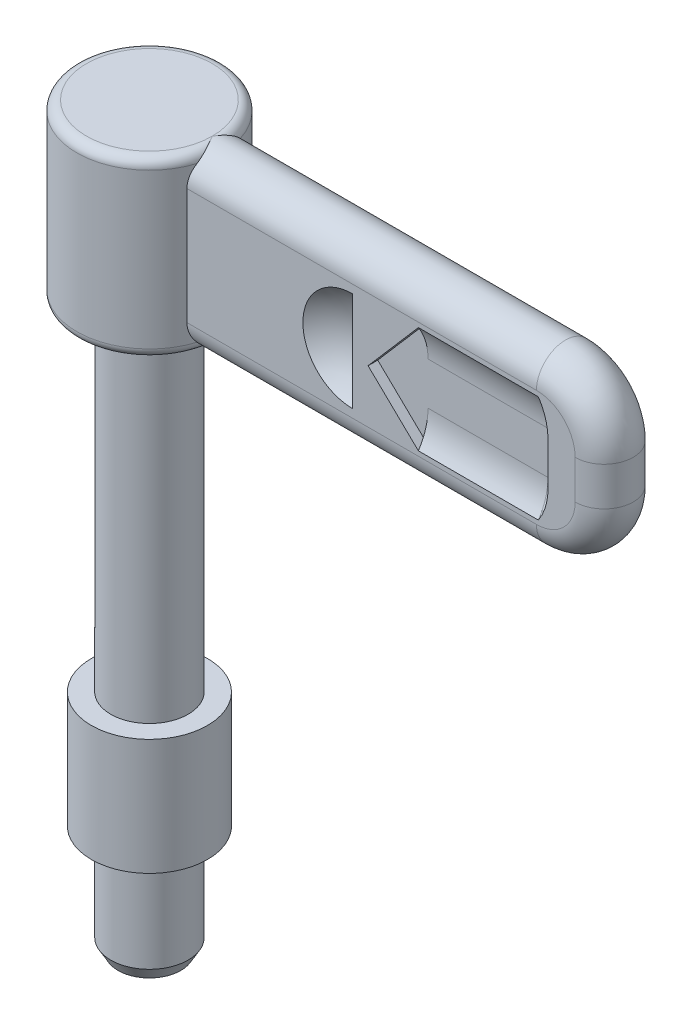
ISO-10303-21;
HEADER;
FILE_DESCRIPTION(('STEP AP214'),'2;1');
FILE_NAME('part.step','',(''),(''),'','','');
FILE_SCHEMA(('AUTOMOTIVE_DESIGN { 1 0 10303 214 1 1 1 1 }'));
ENDSEC;
DATA;
#1=APPLICATION_CONTEXT('core data for automotive mechanical design processes');
#2=APPLICATION_PROTOCOL_DEFINITION('international standard','automotive_design',2000,#1);
#3=PRODUCT_CONTEXT('',#1,'mechanical');
#4=PRODUCT('Part','Part','',(#3));
#5=PRODUCT_RELATED_PRODUCT_CATEGORY('part','',(#4));
#6=PRODUCT_DEFINITION_FORMATION('','',#4);
#7=PRODUCT_DEFINITION_CONTEXT('part definition',#1,'design');
#8=PRODUCT_DEFINITION('design','',#6,#7);
#9=PRODUCT_DEFINITION_SHAPE('','',#8);
#10=(LENGTH_UNIT() NAMED_UNIT(*) SI_UNIT(.MILLI.,.METRE.));
#11=(NAMED_UNIT(*) PLANE_ANGLE_UNIT() SI_UNIT($,.RADIAN.));
#12=(NAMED_UNIT(*) SI_UNIT($,.STERADIAN.) SOLID_ANGLE_UNIT());
#13=UNCERTAINTY_MEASURE_WITH_UNIT(LENGTH_MEASURE(1.E-05),#10,'distance_accuracy_value','');
#14=(GEOMETRIC_REPRESENTATION_CONTEXT(3) GLOBAL_UNCERTAINTY_ASSIGNED_CONTEXT((#13)) GLOBAL_UNIT_ASSIGNED_CONTEXT((#10,
#11,#12)) REPRESENTATION_CONTEXT('',''));
#15=CARTESIAN_POINT('',(0.,0.,0.));
#16=DIRECTION('',(0.,0.,1.));
#17=DIRECTION('',(1.,0.,0.));
#18=AXIS2_PLACEMENT_3D('',#15,#16,#17);
#19=CARTESIAN_POINT('',(-2.8267949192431,6.,2.8267949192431));
#20=DIRECTION('',(0.,1.,0.));
#21=DIRECTION('',(1.,0.,0.));
#22=AXIS2_PLACEMENT_3D('',#19,#20,#21);
#23=PLANE('',#22);
#24=CARTESIAN_POINT('',(0.,6.,0.));
#25=DIRECTION('',(0.,-1.,0.));
#26=DIRECTION('',(0.,0.,1.));
#27=AXIS2_PLACEMENT_3D('',#24,#25,#26);
#28=CIRCLE('',#27,2.);
#29=CARTESIAN_POINT('',(0.,6.,2.));
#30=VERTEX_POINT('',#29);
#31=EDGE_CURVE('E577',#30,#30,#28,.T.);
#32=ORIENTED_EDGE('',*,*,#31,.T.);
#33=EDGE_LOOP('',(#32));
#34=FACE_BOUND('',#33,.T.);
#35=CARTESIAN_POINT('',(0.,6.,0.));
#36=DIRECTION('',(0.,1.,0.));
#37=DIRECTION('',(0.,0.,1.));
#38=AXIS2_PLACEMENT_3D('',#35,#36,#37);
#39=CIRCLE('',#38,3.);
#40=CARTESIAN_POINT('',(0.,6.,3.));
#41=VERTEX_POINT('',#40);
#42=EDGE_CURVE('E22',#41,#41,#39,.T.);
#43=ORIENTED_EDGE('',*,*,#42,.T.);
#44=EDGE_LOOP('',(#43));
#45=FACE_BOUND('',#44,.T.);
#46=ADVANCED_FACE('F14',(#34,#45),#23,.T.);
#47=CARTESIAN_POINT('',(0.,-6.,0.));
#48=DIRECTION('',(0.,-1.,0.));
#49=DIRECTION('',(0.,0.,1.));
#50=AXIS2_PLACEMENT_3D('',#47,#48,#49);
#51=CYLINDRICAL_SURFACE('',#50,2.);
#52=CARTESIAN_POINT('',(0.,23.5,0.));
#53=DIRECTION('',(0.,-1.,0.));
#54=DIRECTION('',(0.,0.,-1.));
#55=AXIS2_PLACEMENT_3D('',#52,#53,#54);
#56=CIRCLE('',#55,2.);
#57=CARTESIAN_POINT('',(0.,23.5,-2.));
#58=VERTEX_POINT('',#57);
#59=EDGE_CURVE('E9',#58,#58,#56,.F.);
#60=ORIENTED_EDGE('',*,*,#59,.F.);
#61=EDGE_LOOP('',(#60));
#62=FACE_BOUND('',#61,.T.);
#63=ORIENTED_EDGE('',*,*,#31,.F.);
#64=EDGE_LOOP('',(#63));
#65=FACE_BOUND('',#64,.T.);
#66=ADVANCED_FACE('F1058',(#62,#65),#51,.T.);
#67=CARTESIAN_POINT('',(0.,-6.,0.));
#68=DIRECTION('',(0.,-1.,0.));
#69=DIRECTION('',(7.69327835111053E-10,0.,1.));
#70=AXIS2_PLACEMENT_3D('',#67,#68,#69);
#71=CYLINDRICAL_SURFACE('',#70,3.);
#72=ORIENTED_EDGE('',*,*,#42,.F.);
#73=EDGE_LOOP('',(#72));
#74=FACE_BOUND('',#73,.T.);
#75=CARTESIAN_POINT('',(0.,0.,0.));
#76=DIRECTION('',(0.,-1.,0.));
#77=DIRECTION('',(0.,0.,-1.));
#78=AXIS2_PLACEMENT_3D('',#75,#76,#77);
#79=CIRCLE('',#78,3.);
#80=CARTESIAN_POINT('',(0.,0.,-3.));
#81=VERTEX_POINT('',#80);
#82=EDGE_CURVE('E570',#81,#81,#79,.F.);
#83=ORIENTED_EDGE('',*,*,#82,.T.);
#84=EDGE_LOOP('',(#83));
#85=FACE_BOUND('',#84,.T.);
#86=ADVANCED_FACE('F1055',(#74,#85),#71,.T.);
#87=CARTESIAN_POINT('',(1.29887420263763E-13,-2.00000000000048,0.));
#88=DIRECTION('',(0.,-1.,0.));
#89=DIRECTION('',(1.,0.,0.));
#90=AXIS2_PLACEMENT_3D('',#87,#88,#89);
#91=SPHERICAL_SURFACE('',#90,3.99999999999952);
#92=CARTESIAN_POINT('',(0.,-5.65695305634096,0.));
#93=DIRECTION('',(0.,1.,0.));
#94=DIRECTION('',(-1.,0.,0.));
#95=AXIS2_PLACEMENT_3D('',#92,#93,#94);
#96=CIRCLE('',#95,1.62070797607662);
#97=CARTESIAN_POINT('',(-1.62070797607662,-5.65695305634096,0.));
#98=VERTEX_POINT('',#97);
#99=EDGE_CURVE('E566',#98,#98,#96,.F.);
#100=ORIENTED_EDGE('',*,*,#99,.T.);
#101=EDGE_LOOP('',(#100));
#102=FACE_BOUND('',#101,.T.);
#103=ADVANCED_FACE('F1040',(#102),#91,.T.);
#104=CARTESIAN_POINT('',(0.,-5.,0.));
#105=DIRECTION('',(0.,1.,0.));
#106=DIRECTION('',(0.,0.,-1.));
#107=AXIS2_PLACEMENT_3D('',#104,#105,#106);
#108=CONICAL_SURFACE('',#107,2.,0.523598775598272);
#109=ORIENTED_EDGE('',*,*,#99,.F.);
#110=EDGE_LOOP('',(#109));
#111=FACE_BOUND('',#110,.T.);
#112=CARTESIAN_POINT('',(0.,-5.,0.));
#113=DIRECTION('',(0.,1.,0.));
#114=DIRECTION('',(0.,0.,-1.));
#115=AXIS2_PLACEMENT_3D('',#112,#113,#114);
#116=CIRCLE('',#115,2.);
#117=CARTESIAN_POINT('',(0.,-5.,-2.));
#118=VERTEX_POINT('',#117);
#119=EDGE_CURVE('E1033',#118,#118,#116,.F.);
#120=ORIENTED_EDGE('',*,*,#119,.T.);
#121=EDGE_LOOP('',(#120));
#122=FACE_BOUND('',#121,.T.);
#123=ADVANCED_FACE('F1042',(#111,#122),#108,.T.);
#124=CARTESIAN_POINT('',(0.,-6.,0.));
#125=DIRECTION('',(0.,-1.,0.));
#126=DIRECTION('',(7.69313624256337E-10,0.,1.));
#127=AXIS2_PLACEMENT_3D('',#124,#125,#126);
#128=CYLINDRICAL_SURFACE('',#127,2.);
#129=ORIENTED_EDGE('',*,*,#119,.F.);
#130=EDGE_LOOP('',(#129));
#131=FACE_BOUND('',#130,.T.);
#132=CARTESIAN_POINT('',(0.,-0.5,0.));
#133=DIRECTION('',(0.,1.,0.));
#134=DIRECTION('',(0.,0.,-1.));
#135=AXIS2_PLACEMENT_3D('',#132,#133,#134);
#136=CIRCLE('',#135,2.);
#137=CARTESIAN_POINT('',(0.,-0.5,-2.));
#138=VERTEX_POINT('',#137);
#139=EDGE_CURVE('E1031',#138,#138,#136,.F.);
#140=ORIENTED_EDGE('',*,*,#139,.T.);
#141=EDGE_LOOP('',(#140));
#142=FACE_BOUND('',#141,.T.);
#143=ADVANCED_FACE('F1044',(#131,#142),#128,.T.);
#144=CARTESIAN_POINT('',(0.,-0.5,0.));
#145=DIRECTION('',(0.,-1.,0.));
#146=DIRECTION('',(7.69361585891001E-10,0.,1.));
#147=AXIS2_PLACEMENT_3D('',#144,#145,#146);
#148=CONICAL_SURFACE('',#147,2.,0.349065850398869);
#149=ORIENTED_EDGE('',*,*,#139,.F.);
#150=EDGE_LOOP('',(#149));
#151=FACE_BOUND('',#150,.T.);
#152=CARTESIAN_POINT('',(0.,-0.36262612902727,0.));
#153=DIRECTION('',(0.,1.,0.));
#154=DIRECTION('',(0.,0.,-1.));
#155=AXIS2_PLACEMENT_3D('',#152,#153,#154);
#156=CIRCLE('',#155,1.95);
#157=CARTESIAN_POINT('',(0.,-0.36262612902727,-1.95));
#158=VERTEX_POINT('',#157);
#159=EDGE_CURVE('E1023',#158,#158,#156,.F.);
#160=ORIENTED_EDGE('',*,*,#159,.T.);
#161=EDGE_LOOP('',(#160));
#162=FACE_BOUND('',#161,.T.);
#163=ADVANCED_FACE('F1052',(#151,#162),#148,.T.);
#164=CARTESIAN_POINT('',(0.,-6.,0.));
#165=DIRECTION('',(0.,-1.,0.));
#166=DIRECTION('',(7.69360697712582E-10,0.,1.));
#167=AXIS2_PLACEMENT_3D('',#164,#165,#166);
#168=CYLINDRICAL_SURFACE('',#167,1.95);
#169=ORIENTED_EDGE('',*,*,#159,.F.);
#170=EDGE_LOOP('',(#169));
#171=FACE_BOUND('',#170,.T.);
#172=CARTESIAN_POINT('',(0.,0.,0.));
#173=DIRECTION('',(0.,-1.,0.));
#174=DIRECTION('',(0.,0.,-1.));
#175=AXIS2_PLACEMENT_3D('',#172,#173,#174);
#176=CIRCLE('',#175,1.95);
#177=CARTESIAN_POINT('',(0.,0.,-1.95));
#178=VERTEX_POINT('',#177);
#179=EDGE_CURVE('E574',#178,#178,#176,.T.);
#180=ORIENTED_EDGE('',*,*,#179,.T.);
#181=EDGE_LOOP('',(#180));
#182=FACE_BOUND('',#181,.T.);
#183=ADVANCED_FACE('F1069',(#171,#182),#168,.T.);
#184=CARTESIAN_POINT('',(-2.8267949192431,0.,-2.8267949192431));
#185=DIRECTION('',(0.,-1.,0.));
#186=DIRECTION('',(1.,0.,0.));
#187=AXIS2_PLACEMENT_3D('',#184,#185,#186);
#188=PLANE('',#187);
#189=ORIENTED_EDGE('',*,*,#82,.F.);
#190=EDGE_LOOP('',(#189));
#191=FACE_BOUND('',#190,.T.);
#192=ORIENTED_EDGE('',*,*,#179,.F.);
#193=EDGE_LOOP('',(#192));
#194=FACE_BOUND('',#193,.T.);
#195=ADVANCED_FACE('F16',(#191,#194),#188,.T.);
#196=CARTESIAN_POINT('',(15.4,29.1,-1.5));
#197=DIRECTION('',(-1.,0.,0.));
#198=DIRECTION('',(0.,0.,1.));
#199=AXIS2_PLACEMENT_3D('',#196,#197,#198);
#200=PLANE('',#199);
#201=CARTESIAN_POINT('',(15.4,29.0999999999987,-4.00000000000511));
#202=DIRECTION('',(1.,0.,0.));
#203=DIRECTION('',(0.,0.552770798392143,0.833333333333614));
#204=AXIS2_PLACEMENT_3D('',#201,#202,#203);
#205=CIRCLE('',#204,3.0000000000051);
#206=CARTESIAN_POINT('',(15.4,30.758312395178,-1.5));
#207=VERTEX_POINT('',#206);
#208=CARTESIAN_POINT('',(15.4,29.1,-1.));
#209=VERTEX_POINT('',#208);
#210=EDGE_CURVE('E843',#207,#209,#205,.T.);
#211=ORIENTED_EDGE('',*,*,#210,.T.);
#212=DIRECTION('',(0.,1.,0.));
#213=VECTOR('',#212,1.);
#214=CARTESIAN_POINT('',(15.4,29.1,-1.));
#215=LINE('',#214,#213);
#216=CARTESIAN_POINT('',(15.4,30.758312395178,-1.));
#217=VERTEX_POINT('',#216);
#218=EDGE_CURVE('E848',#209,#217,#215,.T.);
#219=ORIENTED_EDGE('',*,*,#218,.T.);
#220=DIRECTION('',(0.,0.,1.));
#221=VECTOR('',#220,1.);
#222=CARTESIAN_POINT('',(15.4,30.758312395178,-1.5));
#223=LINE('',#222,#221);
#224=EDGE_CURVE('E826',#217,#207,#223,.F.);
#225=ORIENTED_EDGE('',*,*,#224,.T.);
#226=EDGE_LOOP('',(#211,#219,#225));
#227=FACE_BOUND('',#226,.T.);
#228=ADVANCED_FACE('F1077',(#227),#200,.T.);
#229=CARTESIAN_POINT('',(15.4,25.241687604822,-1.5));
#230=DIRECTION('',(-1.,0.,0.));
#231=DIRECTION('',(0.,0.,1.));
#232=AXIS2_PLACEMENT_3D('',#229,#230,#231);
#233=PLANE('',#232);
#234=CARTESIAN_POINT('',(15.4,26.9000000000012,-4.0000000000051));
#235=DIRECTION('',(1.,0.,0.));
#236=DIRECTION('',(0.,-4.16851738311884E-13,1.));
#237=AXIS2_PLACEMENT_3D('',#234,#235,#236);
#238=CIRCLE('',#237,3.0000000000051);
#239=CARTESIAN_POINT('',(15.4,26.9,-1.));
#240=VERTEX_POINT('',#239);
#241=CARTESIAN_POINT('',(15.4,25.241687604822,-1.5));
#242=VERTEX_POINT('',#241);
#243=EDGE_CURVE('E190',#240,#242,#238,.T.);
#244=ORIENTED_EDGE('',*,*,#243,.T.);
#245=DIRECTION('',(0.,0.,1.));
#246=VECTOR('',#245,1.);
#247=CARTESIAN_POINT('',(15.4,25.241687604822,-1.5));
#248=LINE('',#247,#246);
#249=CARTESIAN_POINT('',(15.4,25.241687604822,-1.));
#250=VERTEX_POINT('',#249);
#251=EDGE_CURVE('E207',#250,#242,#248,.F.);
#252=ORIENTED_EDGE('',*,*,#251,.F.);
#253=DIRECTION('',(0.,1.,0.));
#254=VECTOR('',#253,1.);
#255=CARTESIAN_POINT('',(15.4,25.241687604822,-1.));
#256=LINE('',#255,#254);
#257=EDGE_CURVE('E208',#250,#240,#256,.T.);
#258=ORIENTED_EDGE('',*,*,#257,.T.);
#259=EDGE_LOOP('',(#244,#252,#258));
#260=FACE_BOUND('',#259,.T.);
#261=ADVANCED_FACE('F206',(#260),#233,.T.);
#262=CARTESIAN_POINT('',(12.8,25.241687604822,-1.));
#263=DIRECTION('',(0.,0.,-1.));
#264=DIRECTION('',(0.,1.,0.));
#265=AXIS2_PLACEMENT_3D('',#262,#263,#264);
#266=PLANE('',#265);
#267=DIRECTION('',(-0.653895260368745,-0.756585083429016,0.));
#268=VECTOR('',#267,1.);
#269=CARTESIAN_POINT('',(15.4,30.758312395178,-1.));
#270=LINE('',#269,#268);
#271=CARTESIAN_POINT('',(12.8,27.75,-1.));
#272=VERTEX_POINT('',#271);
#273=EDGE_CURVE('E831',#217,#272,#270,.T.);
#274=ORIENTED_EDGE('',*,*,#273,.F.);
#275=ORIENTED_EDGE('',*,*,#218,.F.);
#276=DIRECTION('',(1.,0.,0.));
#277=VECTOR('',#276,1.);
#278=CARTESIAN_POINT('',(15.4,29.1,-1.));
#279=LINE('',#278,#277);
#280=CARTESIAN_POINT('',(21.6,29.1,-1.));
#281=VERTEX_POINT('',#280);
#282=EDGE_CURVE('E853',#209,#281,#279,.T.);
#283=ORIENTED_EDGE('',*,*,#282,.T.);
#284=DIRECTION('',(0.,-1.,0.));
#285=VECTOR('',#284,1.);
#286=CARTESIAN_POINT('',(21.6,29.1,-1.));
#287=LINE('',#286,#285);
#288=CARTESIAN_POINT('',(21.6,26.9,-1.));
#289=VERTEX_POINT('',#288);
#290=EDGE_CURVE('E857',#289,#281,#287,.F.);
#291=ORIENTED_EDGE('',*,*,#290,.F.);
#292=DIRECTION('',(-1.,0.,0.));
#293=VECTOR('',#292,1.);
#294=CARTESIAN_POINT('',(21.6,26.9,-1.));
#295=LINE('',#294,#293);
#296=EDGE_CURVE('E861',#240,#289,#295,.F.);
#297=ORIENTED_EDGE('',*,*,#296,.F.);
#298=ORIENTED_EDGE('',*,*,#257,.F.);
#299=DIRECTION('',(0.719682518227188,-0.694303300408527,0.));
#300=VECTOR('',#299,1.);
#301=CARTESIAN_POINT('',(12.8,27.75,-1.));
#302=LINE('',#301,#300);
#303=EDGE_CURVE('E215',#272,#250,#302,.T.);
#304=ORIENTED_EDGE('',*,*,#303,.F.);
#305=EDGE_LOOP('',(#274,#275,#283,#291,#297,#298,#304));
#306=FACE_BOUND('',#305,.T.);
#307=ADVANCED_FACE('F887',(#306),#266,.T.);
#308=CARTESIAN_POINT('',(15.4,25.241687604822,1.5));
#309=DIRECTION('',(-1.,0.,0.));
#310=DIRECTION('',(0.,1.,0.));
#311=AXIS2_PLACEMENT_3D('',#308,#309,#310);
#312=PLANE('',#311);
#313=DIRECTION('',(0.,1.,0.));
#314=VECTOR('',#313,1.);
#315=CARTESIAN_POINT('',(15.4,25.241687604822,1.));
#316=LINE('',#315,#314);
#317=CARTESIAN_POINT('',(15.4,25.241687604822,1.));
#318=VERTEX_POINT('',#317);
#319=CARTESIAN_POINT('',(15.4,26.9000000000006,1.));
#320=VERTEX_POINT('',#319);
#321=EDGE_CURVE('E1435',#318,#320,#316,.T.);
#322=ORIENTED_EDGE('',*,*,#321,.F.);
#323=DIRECTION('',(0.,0.,1.));
#324=VECTOR('',#323,1.);
#325=CARTESIAN_POINT('',(15.4,25.241687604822,1.));
#326=LINE('',#325,#324);
#327=CARTESIAN_POINT('',(15.4,25.241687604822,1.5));
#328=VERTEX_POINT('',#327);
#329=EDGE_CURVE('E810',#318,#328,#326,.T.);
#330=ORIENTED_EDGE('',*,*,#329,.T.);
#331=CARTESIAN_POINT('',(15.4,26.9000000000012,4.00000000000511));
#332=DIRECTION('',(-1.,0.,0.));
#333=DIRECTION('',(0.,-2.08425869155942E-13,-1.));
#334=AXIS2_PLACEMENT_3D('',#331,#332,#333);
#335=CIRCLE('',#334,3.0000000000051);
#336=EDGE_CURVE('E1443',#328,#320,#335,.F.);
#337=ORIENTED_EDGE('',*,*,#336,.T.);
#338=EDGE_LOOP('',(#322,#330,#337));
#339=FACE_BOUND('',#338,.T.);
#340=ADVANCED_FACE('F1166',(#339),#312,.T.);
#341=CARTESIAN_POINT('',(15.4,29.0999999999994,1.5));
#342=DIRECTION('',(-1.,0.,0.));
#343=DIRECTION('',(0.,1.,0.));
#344=AXIS2_PLACEMENT_3D('',#341,#342,#343);
#345=PLANE('',#344);
#346=DIRECTION('',(0.,0.,-1.));
#347=VECTOR('',#346,1.);
#348=CARTESIAN_POINT('',(15.4,30.758312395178,1.5));
#349=LINE('',#348,#347);
#350=CARTESIAN_POINT('',(15.4,30.758312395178,1.));
#351=VERTEX_POINT('',#350);
#352=CARTESIAN_POINT('',(15.4,30.758312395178,1.5));
#353=VERTEX_POINT('',#352);
#354=EDGE_CURVE('E818',#351,#353,#349,.F.);
#355=ORIENTED_EDGE('',*,*,#354,.F.);
#356=DIRECTION('',(0.,1.,0.));
#357=VECTOR('',#356,1.);
#358=CARTESIAN_POINT('',(15.4,29.0999999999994,1.));
#359=LINE('',#358,#357);
#360=CARTESIAN_POINT('',(15.4,29.0999999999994,1.));
#361=VERTEX_POINT('',#360);
#362=EDGE_CURVE('E1417',#361,#351,#359,.T.);
#363=ORIENTED_EDGE('',*,*,#362,.F.);
#364=CARTESIAN_POINT('',(15.4,29.0999999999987,4.0000000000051));
#365=DIRECTION('',(-1.,0.,0.));
#366=DIRECTION('',(0.,0.552770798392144,-0.833333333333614));
#367=AXIS2_PLACEMENT_3D('',#364,#365,#366);
#368=CIRCLE('',#367,3.0000000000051);
#369=EDGE_CURVE('E714',#361,#353,#368,.F.);
#370=ORIENTED_EDGE('',*,*,#369,.T.);
#371=EDGE_LOOP('',(#355,#363,#370));
#372=FACE_BOUND('',#371,.T.);
#373=ADVANCED_FACE('F694',(#372),#345,.T.);
#374=CARTESIAN_POINT('',(21.6,25.241687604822,1.));
#375=DIRECTION('',(0.,0.,1.));
#376=DIRECTION('',(0.,1.,0.));
#377=AXIS2_PLACEMENT_3D('',#374,#375,#376);
#378=PLANE('',#377);
#379=DIRECTION('',(0.,1.,0.));
#380=VECTOR('',#379,1.);
#381=CARTESIAN_POINT('',(21.6,26.9000000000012,1.));
#382=LINE('',#381,#380);
#383=CARTESIAN_POINT('',(21.6,26.9000000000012,1.));
#384=VERTEX_POINT('',#383);
#385=CARTESIAN_POINT('',(21.6,29.1,1.));
#386=VERTEX_POINT('',#385);
#387=EDGE_CURVE('E1424',#384,#386,#382,.T.);
#388=ORIENTED_EDGE('',*,*,#387,.T.);
#389=DIRECTION('',(-1.,-1.00851227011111E-13,0.));
#390=VECTOR('',#389,1.);
#391=CARTESIAN_POINT('',(21.6,29.1,1.));
#392=LINE('',#391,#390);
#393=EDGE_CURVE('E1420',#361,#386,#392,.F.);
#394=ORIENTED_EDGE('',*,*,#393,.F.);
#395=ORIENTED_EDGE('',*,*,#362,.T.);
#396=DIRECTION('',(-0.653895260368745,-0.756585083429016,0.));
#397=VECTOR('',#396,1.);
#398=CARTESIAN_POINT('',(15.4,30.758312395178,1.));
#399=LINE('',#398,#397);
#400=CARTESIAN_POINT('',(12.8,27.75,1.));
#401=VERTEX_POINT('',#400);
#402=EDGE_CURVE('E1419',#351,#401,#399,.T.);
#403=ORIENTED_EDGE('',*,*,#402,.T.);
#404=DIRECTION('',(0.719682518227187,-0.694303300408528,0.));
#405=VECTOR('',#404,1.);
#406=CARTESIAN_POINT('',(12.8,27.75,1.));
#407=LINE('',#406,#405);
#408=EDGE_CURVE('E1422',#401,#318,#407,.T.);
#409=ORIENTED_EDGE('',*,*,#408,.T.);
#410=ORIENTED_EDGE('',*,*,#321,.T.);
#411=DIRECTION('',(-1.,-1.00851227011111E-13,0.));
#412=VECTOR('',#411,1.);
#413=CARTESIAN_POINT('',(21.6,26.9000000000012,1.));
#414=LINE('',#413,#412);
#415=EDGE_CURVE('E679',#320,#384,#414,.F.);
#416=ORIENTED_EDGE('',*,*,#415,.T.);
#417=EDGE_LOOP('',(#388,#394,#395,#403,#409,#410,#416));
#418=FACE_BOUND('',#417,.T.);
#419=ADVANCED_FACE('F691',(#418),#378,.T.);
#420=CARTESIAN_POINT('',(-3.24997217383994,32.5,3.2746253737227));
#421=DIRECTION('',(0.,1.,0.));
#422=DIRECTION('',(1.,0.,0.));
#423=AXIS2_PLACEMENT_3D('',#420,#421,#422);
#424=PLANE('',#423);
#425=CARTESIAN_POINT('',(0.,32.5,0.));
#426=DIRECTION('',(0.,1.,0.));
#427=DIRECTION('',(-0.707106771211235,0.,0.70710679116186));
#428=AXIS2_PLACEMENT_3D('',#425,#426,#427);
#429=CIRCLE('',#428,3.25000012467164);
#430=CARTESIAN_POINT('',(3.25000012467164,32.5,0.));
#431=VERTEX_POINT('',#430);
#432=EDGE_CURVE('E560',#431,#431,#429,.F.);
#433=ORIENTED_EDGE('',*,*,#432,.F.);
#434=EDGE_LOOP('',(#433));
#435=FACE_BOUND('',#434,.T.);
#436=ADVANCED_FACE('F484',(#435),#424,.T.);
#437=CARTESIAN_POINT('',(12.,28.,-4.3));
#438=DIRECTION('',(0.,1.,0.));
#439=DIRECTION('',(-0.676064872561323,0.,0.736842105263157));
#440=AXIS2_PLACEMENT_3D('',#437,#438,#439);
#441=SPHERICAL_SURFACE('',#440,3.8);
#442=CARTESIAN_POINT('',(12.,30.569046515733,-1.50000000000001));
#443=CARTESIAN_POINT('',(12.,30.5257400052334,-1.46026412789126));
#444=CARTESIAN_POINT('',(12.,30.4815102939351,-1.42153457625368));
#445=CARTESIAN_POINT('',(12.,30.3913026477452,-1.3461679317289));
#446=CARTESIAN_POINT('',(12.,30.3453247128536,-1.30953083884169));
#447=CARTESIAN_POINT('',(12.,30.2517187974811,-1.23842892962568));
#448=CARTESIAN_POINT('',(12.,30.2040908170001,-1.20396411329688));
#449=CARTESIAN_POINT('',(12.,30.1072875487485,-1.13728069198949));
#450=CARTESIAN_POINT('',(12.,30.0581122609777,-1.1050620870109));
#451=CARTESIAN_POINT('',(12.,29.9583201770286,-1.04294051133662));
#452=CARTESIAN_POINT('',(12.,29.9077033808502,-1.01303754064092));
#453=CARTESIAN_POINT('',(12.,29.8051372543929,-0.955611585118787));
#454=CARTESIAN_POINT('',(12.,29.7531879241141,-0.928088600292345));
#455=CARTESIAN_POINT('',(12.,29.6480685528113,-0.875481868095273));
#456=CARTESIAN_POINT('',(12.,29.5948985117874,-0.850398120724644));
#457=CARTESIAN_POINT('',(12.,29.4874521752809,-0.802723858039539));
#458=CARTESIAN_POINT('',(12.,29.4331758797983,-0.780133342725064));
#459=CARTESIAN_POINT('',(12.,29.3236338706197,-0.737494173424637));
#460=CARTESIAN_POINT('',(12.,29.2683681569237,-0.717445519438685));
#461=CARTESIAN_POINT('',(12.,29.1569662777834,-0.679933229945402));
#462=CARTESIAN_POINT('',(12.,29.1008301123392,-0.662469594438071));
#463=CARTESIAN_POINT('',(12.,28.9878081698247,-0.630164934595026));
#464=CARTESIAN_POINT('',(12.,28.9309223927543,-0.615323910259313));
#465=CARTESIAN_POINT('',(12.,28.8165236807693,-0.588296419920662));
#466=CARTESIAN_POINT('',(12.,28.7590107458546,-0.576109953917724));
#467=CARTESIAN_POINT('',(12.,28.6434815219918,-0.554417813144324));
#468=CARTESIAN_POINT('',(12.,28.5854652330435,-0.544912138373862));
#469=CARTESIAN_POINT('',(12.,28.4690541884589,-0.528602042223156));
#470=CARTESIAN_POINT('',(12.,28.4106594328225,-0.52179762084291));
#471=CARTESIAN_POINT('',(12.,28.2936171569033,-0.510904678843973));
#472=CARTESIAN_POINT('',(12.,28.2349696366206,-0.506816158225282));
#473=CARTESIAN_POINT('',(12.,28.1175480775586,-0.501363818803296));
#474=CARTESIAN_POINT('',(12.,28.0587740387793,-0.500000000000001));
#475=CARTESIAN_POINT('',(12.,27.9412259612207,-0.500000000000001));
#476=CARTESIAN_POINT('',(12.,27.8824519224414,-0.501363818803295));
#477=CARTESIAN_POINT('',(12.,27.7650303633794,-0.506816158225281));
#478=CARTESIAN_POINT('',(12.,27.7063828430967,-0.510904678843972));
#479=CARTESIAN_POINT('',(12.,27.5893405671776,-0.521797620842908));
#480=CARTESIAN_POINT('',(12.,27.5309458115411,-0.528602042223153));
#481=CARTESIAN_POINT('',(12.,27.4145347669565,-0.544912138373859));
#482=CARTESIAN_POINT('',(12.,27.3565184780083,-0.554417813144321));
#483=CARTESIAN_POINT('',(12.,27.2409892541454,-0.57610995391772));
#484=CARTESIAN_POINT('',(12.,27.1834763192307,-0.588296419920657));
#485=CARTESIAN_POINT('',(12.,27.0690776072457,-0.615323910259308));
#486=CARTESIAN_POINT('',(12.,27.0121918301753,-0.630164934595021));
#487=CARTESIAN_POINT('',(12.,26.8991698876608,-0.662469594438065));
#488=CARTESIAN_POINT('',(12.,26.8430337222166,-0.679933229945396));
#489=CARTESIAN_POINT('',(12.,26.7316318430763,-0.717445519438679));
#490=CARTESIAN_POINT('',(12.,26.6763661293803,-0.73749417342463));
#491=CARTESIAN_POINT('',(12.,26.5668241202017,-0.780133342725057));
#492=CARTESIAN_POINT('',(12.,26.5125478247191,-0.802723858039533));
#493=CARTESIAN_POINT('',(12.,26.4051014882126,-0.850398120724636));
#494=CARTESIAN_POINT('',(12.,26.3519314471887,-0.875481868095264));
#495=CARTESIAN_POINT('',(12.,26.2468120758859,-0.928088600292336));
#496=CARTESIAN_POINT('',(12.,26.1948627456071,-0.955611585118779));
#497=CARTESIAN_POINT('',(12.,26.0922966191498,-1.01303754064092));
#498=CARTESIAN_POINT('',(12.,26.0416798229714,-1.04294051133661));
#499=CARTESIAN_POINT('',(12.,25.9418877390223,-1.10506208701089));
#500=CARTESIAN_POINT('',(12.,25.8927124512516,-1.13728069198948));
#501=CARTESIAN_POINT('',(12.,25.7959091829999,-1.20396411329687));
#502=CARTESIAN_POINT('',(12.,25.7482812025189,-1.23842892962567));
#503=CARTESIAN_POINT('',(12.,25.6546752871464,-1.30953083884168));
#504=CARTESIAN_POINT('',(12.,25.6086973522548,-1.34616793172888));
#505=CARTESIAN_POINT('',(12.,25.5184897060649,-1.42153457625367));
#506=CARTESIAN_POINT('',(12.,25.4742599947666,-1.46026412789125));
#507=CARTESIAN_POINT('',(12.,25.430953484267,-1.5));
#508=B_SPLINE_CURVE_WITH_KNOTS('',3,(#442,#443,#444,#445,#446,#447,#448,#449,#450,#451,#452,
#453,#454,#455,#456,#457,#458,#459,#460,#461,#462,#463,#464,#465,#466,#467,#468,#469,#470,#471,
#472,#473,#474,#475,#476,#477,#478,#479,#480,#481,#482,#483,#484,#485,#486,#487,#488,#489,#490,
#491,#492,#493,#494,#495,#496,#497,#498,#499,#500,#501,#502,#503,#504,#505,#506,#507),
.UNSPECIFIED.,.F.,.F.,(4,2,2,2,2,2,2,2,2,2,2,2,2,2,2,2,2,2,2,2,2,2,2,2,2,2,2,2,2,2,2,2,4),(0.,
0.176306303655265,0.35261260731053,0.528918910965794,0.70522521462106,0.881531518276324,
1.05783782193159,1.23414412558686,1.41045042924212,1.58675673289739,1.76306303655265,
1.93936934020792,2.11567564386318,2.29198194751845,2.46828825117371,2.64459455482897,
2.82090085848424,2.9972071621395,3.17351346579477,3.34981976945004,3.5261260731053,
3.70243237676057,3.87873868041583,4.0550449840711,4.23135128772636,4.40765759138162,
4.58396389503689,4.76027019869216,4.93657650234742,5.11288280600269,5.28918910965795,
5.46549541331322,5.64180171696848),.UNSPECIFIED.);
#509=CARTESIAN_POINT('',(12.,30.569046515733,-1.5));
#510=VERTEX_POINT('',#509);
#511=CARTESIAN_POINT('',(12.,25.430953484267,-1.5));
#512=VERTEX_POINT('',#511);
#513=EDGE_CURVE('E581',#510,#512,#508,.T.);
#514=ORIENTED_EDGE('',*,*,#513,.T.);
#515=CARTESIAN_POINT('',(12.,30.569046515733,-1.5));
#516=CARTESIAN_POINT('',(11.8604662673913,30.569046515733,-1.5));
#517=CARTESIAN_POINT('',(11.7251672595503,30.558257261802,-1.5));
#518=CARTESIAN_POINT('',(11.4614528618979,30.5161788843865,-1.5));
#519=CARTESIAN_POINT('',(11.3330374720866,30.4848897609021,-1.5));
#520=CARTESIAN_POINT('',(10.9180636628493,30.349608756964,-1.5));
#521=CARTESIAN_POINT('',(10.6751190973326,30.2176773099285,-1.5));
#522=CARTESIAN_POINT('',(10.1926951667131,29.8569578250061,-1.5));
#523=CARTESIAN_POINT('',(9.96213756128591,29.6004957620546,-1.5));
#524=CARTESIAN_POINT('',(9.19003735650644,28.3008382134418,-1.5));
#525=CARTESIAN_POINT('',(9.35292610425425,27.0138934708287,-1.5));
#526=CARTESIAN_POINT('',(10.3717569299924,25.9950626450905,-1.5));
#527=CARTESIAN_POINT('',(10.5851466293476,25.8366086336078,-1.5));
#528=CARTESIAN_POINT('',(11.0064475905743,25.6232428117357,-1.5));
#529=CARTESIAN_POINT('',(11.1899669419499,25.55356956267,-1.5));
#530=CARTESIAN_POINT('',(11.58418094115,25.4558125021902,-1.5));
#531=CARTESIAN_POINT('',(11.7896180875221,25.4309534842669,-1.5));
#532=CARTESIAN_POINT('',(12.,25.4309534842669,-1.5));
#533=B_SPLINE_CURVE_WITH_KNOTS('',3,(#515,#516,#517,#518,#519,#520,#521,#522,#523,#524,#525,
#526,#527,#528,#529,#530,#531,#532),.UNSPECIFIED.,.F.,.F.,(4,2,2,2,2,2,2,2,4),(0.,
0.042961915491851,0.0859238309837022,0.184717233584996,0.310914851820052,0.758114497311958,
0.859535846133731,0.928561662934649,1.),.UNSPECIFIED.);
#534=EDGE_CURVE('E276',#510,#512,#533,.T.);
#535=ORIENTED_EDGE('',*,*,#534,.F.);
#536=EDGE_LOOP('',(#514,#535));
#537=FACE_BOUND('',#536,.T.);
#538=ADVANCED_FACE('F638',(#537),#441,.F.);
#539=CARTESIAN_POINT('',(12.,25.430953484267,-0.497806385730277));
#540=DIRECTION('',(-1.,0.,0.));
#541=DIRECTION('',(0.,1.,0.));
#542=AXIS2_PLACEMENT_3D('',#539,#540,#541);
#543=PLANE('',#542);
#544=ORIENTED_EDGE('',*,*,#513,.F.);
#545=DIRECTION('',(0.,1.,0.));
#546=VECTOR('',#545,1.);
#547=CARTESIAN_POINT('',(12.,25.430953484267,-1.5));
#548=LINE('',#547,#546);
#549=EDGE_CURVE('E1453',#512,#510,#548,.T.);
#550=ORIENTED_EDGE('',*,*,#549,.F.);
#551=EDGE_LOOP('',(#544,#550));
#552=FACE_BOUND('',#551,.T.);
#553=ADVANCED_FACE('F647',(#552),#543,.T.);
#554=CARTESIAN_POINT('',(12.8,27.75,-1.5));
#555=DIRECTION('',(0.756585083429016,-0.653895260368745,0.));
#556=DIRECTION('',(0.653895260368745,0.756585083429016,0.));
#557=AXIS2_PLACEMENT_3D('',#554,#555,#556);
#558=PLANE('',#557);
#559=DIRECTION('',(-0.653895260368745,-0.756585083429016,0.));
#560=VECTOR('',#559,1.);
#561=CARTESIAN_POINT('',(15.4,30.758312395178,-1.5));
#562=LINE('',#561,#560);
#563=CARTESIAN_POINT('',(12.8,27.75,-1.5));
#564=VERTEX_POINT('',#563);
#565=EDGE_CURVE('E222',#207,#564,#562,.T.);
#566=ORIENTED_EDGE('',*,*,#565,.F.);
#567=ORIENTED_EDGE('',*,*,#224,.F.);
#568=ORIENTED_EDGE('',*,*,#273,.T.);
#569=DIRECTION('',(0.,0.,-1.));
#570=VECTOR('',#569,1.);
#571=CARTESIAN_POINT('',(12.8,27.75,-1.));
#572=LINE('',#571,#570);
#573=EDGE_CURVE('E836',#272,#564,#572,.T.);
#574=ORIENTED_EDGE('',*,*,#573,.T.);
#575=EDGE_LOOP('',(#566,#567,#568,#574));
#576=FACE_BOUND('',#575,.T.);
#577=ADVANCED_FACE('F985',(#576),#558,.T.);
#578=CARTESIAN_POINT('',(15.4,29.0999999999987,-4.00000000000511));
#579=DIRECTION('',(1.,0.,0.));
#580=DIRECTION('',(0.,0.552770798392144,0.833333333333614));
#581=AXIS2_PLACEMENT_3D('',#578,#579,#580);
#582=CYLINDRICAL_SURFACE('',#581,3.0000000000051);
#583=CARTESIAN_POINT('',(21.6,29.1,-1.00000000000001));
#584=CARTESIAN_POINT('',(21.6,29.1366129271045,-1.00021970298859));
#585=CARTESIAN_POINT('',(21.6,29.1732233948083,-1.00104524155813));
#586=CARTESIAN_POINT('',(21.6,29.2464040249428,-1.00393807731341));
#587=CARTESIAN_POINT('',(21.6,29.282974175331,-1.00600567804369));
#588=CARTESIAN_POINT('',(21.6,29.3560184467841,-1.01141247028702));
#589=CARTESIAN_POINT('',(21.6,29.3924925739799,-1.01475157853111));
#590=CARTESIAN_POINT('',(21.6,29.4652900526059,-1.02272370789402));
#591=CARTESIAN_POINT('',(21.6,29.5016134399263,-1.02735640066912));
#592=CARTESIAN_POINT('',(21.6,29.5740567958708,-1.03793190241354));
#593=CARTESIAN_POINT('',(21.6,29.6101768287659,-1.04387427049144));
#594=CARTESIAN_POINT('',(21.6,29.6821626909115,-1.05707872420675));
#595=CARTESIAN_POINT('',(21.6,29.7180286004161,-1.06434037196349));
#596=CARTESIAN_POINT('',(21.6,29.789457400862,-1.08018643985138));
#597=CARTESIAN_POINT('',(21.6,29.8250203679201,-1.08877051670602));
#598=CARTESIAN_POINT('',(21.6,29.8957964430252,-1.10725789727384));
#599=CARTESIAN_POINT('',(21.6,29.9310095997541,-1.11716101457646));
#600=CARTESIAN_POINT('',(21.6,30.001041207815,-1.13827633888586));
#601=CARTESIAN_POINT('',(21.6,30.035859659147,-1.14948854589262));
#602=CARTESIAN_POINT('',(21.6,30.1050590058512,-1.17320534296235));
#603=CARTESIAN_POINT('',(21.6,30.1394398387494,-1.1857101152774));
#604=CARTESIAN_POINT('',(21.6,30.2077230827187,-1.21198881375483));
#605=CARTESIAN_POINT('',(21.6,30.2416253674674,-1.22576306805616));
#606=CARTESIAN_POINT('',(21.6,30.3089126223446,-1.25455103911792));
#607=CARTESIAN_POINT('',(21.6,30.342297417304,-1.26956516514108));
#608=CARTESIAN_POINT('',(21.6,30.4085127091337,-1.30079681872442));
#609=CARTESIAN_POINT('',(21.6,30.4413430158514,-1.31701474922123));
#610=CARTESIAN_POINT('',(21.6,30.5064143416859,-1.3506116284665));
#611=CARTESIAN_POINT('',(21.6,30.5386552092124,-1.36799087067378));
#612=CARTESIAN_POINT('',(21.6,30.6025141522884,-1.40386195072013));
#613=CARTESIAN_POINT('',(21.6,30.6341321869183,-1.42235386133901));
#614=CARTESIAN_POINT('',(21.6,30.6967151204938,-1.46039528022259));
#615=CARTESIAN_POINT('',(21.6,30.7276801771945,-1.4799445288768));
#616=CARTESIAN_POINT('',(21.6,30.758312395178,-1.5));
#617=B_SPLINE_CURVE_WITH_KNOTS('',3,(#583,#584,#585,#586,#587,#588,#589,#590,#591,#592,#593,
#594,#595,#596,#597,#598,#599,#600,#601,#602,#603,#604,#605,#606,#607,#608,#609,#610,#611,#612,
#613,#614,#615,#616),.UNSPECIFIED.,.F.,.F.,(4,2,2,2,2,2,2,2,2,2,2,2,2,2,2,2,4),(0.,
0.10983749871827,0.21970185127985,0.329559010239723,0.439388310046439,0.549180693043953,
0.658936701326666,0.768664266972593,0.878376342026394,0.988088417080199,1.09781598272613,
1.20757199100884,1.31736437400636,1.42719367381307,1.53705083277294,1.64691518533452,
1.7567526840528),.UNSPECIFIED.);
#618=CARTESIAN_POINT('',(21.6,30.758312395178,-1.5));
#619=VERTEX_POINT('',#618);
#620=EDGE_CURVE('E38',#619,#281,#617,.F.);
#621=ORIENTED_EDGE('',*,*,#620,.T.);
#622=ORIENTED_EDGE('',*,*,#282,.F.);
#623=ORIENTED_EDGE('',*,*,#210,.F.);
#624=DIRECTION('',(-1.,0.,0.));
#625=VECTOR('',#624,1.);
#626=CARTESIAN_POINT('',(21.6,30.758312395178,-1.5));
#627=LINE('',#626,#625);
#628=EDGE_CURVE('E1454',#207,#619,#627,.F.);
#629=ORIENTED_EDGE('',*,*,#628,.T.);
#630=EDGE_LOOP('',(#621,#622,#623,#629));
#631=FACE_BOUND('',#630,.T.);
#632=ADVANCED_FACE('F946',(#631),#582,.F.);
#633=CARTESIAN_POINT('',(21.6,30.758312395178,-1.5));
#634=CARTESIAN_POINT('',(21.6,30.0028946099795,-1.00543735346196));
#635=CARTESIAN_POINT('',(21.6,29.0999999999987,-1.));
#636=CARTESIAN_POINT('',(21.6,30.758312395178,-1.5));
#637=CARTESIAN_POINT('',(21.794214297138,30.0028946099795,-1.00543735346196));
#638=CARTESIAN_POINT('',(21.7963495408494,29.0999999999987,-1.));
#639=CARTESIAN_POINT('',(21.6,30.758312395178,-1.5));
#640=CARTESIAN_POINT('',(21.990944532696,30.0028946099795,-1.10905546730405));
#641=CARTESIAN_POINT('',(21.9952426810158,29.0999999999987,-1.10475731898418));
#642=CARTESIAN_POINT('',(21.6,30.758312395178,-1.5));
#643=CARTESIAN_POINT('',(22.0945626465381,30.0028946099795,-1.30578570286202));
#644=CARTESIAN_POINT('',(22.1,29.0999999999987,-1.30365045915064));
#645=CARTESIAN_POINT('',(21.6,30.758312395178,-1.5));
#646=CARTESIAN_POINT('',(22.0945626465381,30.0028946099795,-1.5));
#647=CARTESIAN_POINT('',(22.1,29.0999999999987,-1.5));
#648=B_SPLINE_SURFACE_WITH_KNOTS('',4,2,((#633,#634,#635),(#636,#637,#638),(#639,#640,#641),
(#642,#643,#644),(#645,#646,#647)),.UNSPECIFIED.,.F.,.F.,.F.,(5,5),(3,3),(0.,1.),(0.,1.),.UNSPECIFIED.);
#649=CARTESIAN_POINT('',(21.6,30.758312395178,-1.5));
#650=CARTESIAN_POINT('',(21.6200554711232,30.7276801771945,-1.5));
#651=CARTESIAN_POINT('',(21.6396047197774,30.6967151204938,-1.5));
#652=CARTESIAN_POINT('',(21.677646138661,30.6341321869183,-1.5));
#653=CARTESIAN_POINT('',(21.6961380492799,30.6025141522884,-1.5));
#654=CARTESIAN_POINT('',(21.7320091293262,30.5386552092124,-1.5));
#655=CARTESIAN_POINT('',(21.7493883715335,30.5064143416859,-1.5));
#656=CARTESIAN_POINT('',(21.7829852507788,30.4413430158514,-1.5));
#657=CARTESIAN_POINT('',(21.7992031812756,30.4085127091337,-1.5));
#658=CARTESIAN_POINT('',(21.8304348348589,30.342297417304,-1.5));
#659=CARTESIAN_POINT('',(21.8454489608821,30.3089126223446,-1.5));
#660=CARTESIAN_POINT('',(21.8742369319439,30.2416253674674,-1.5));
#661=CARTESIAN_POINT('',(21.8880111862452,30.2077230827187,-1.5));
#662=CARTESIAN_POINT('',(21.9142898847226,30.1394398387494,-1.5));
#663=CARTESIAN_POINT('',(21.9267946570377,30.1050590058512,-1.5));
#664=CARTESIAN_POINT('',(21.9505114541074,30.035859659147,-1.5));
#665=CARTESIAN_POINT('',(21.9617236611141,30.001041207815,-1.5));
#666=CARTESIAN_POINT('',(21.9828389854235,29.9310095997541,-1.5));
#667=CARTESIAN_POINT('',(21.9927421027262,29.8957964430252,-1.5));
#668=CARTESIAN_POINT('',(22.011229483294,29.8250203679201,-1.5));
#669=CARTESIAN_POINT('',(22.0198135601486,29.789457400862,-1.5));
#670=CARTESIAN_POINT('',(22.0356596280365,29.7180286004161,-1.5));
#671=CARTESIAN_POINT('',(22.0429212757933,29.6821626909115,-1.5));
#672=CARTESIAN_POINT('',(22.0561257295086,29.6101768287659,-1.5));
#673=CARTESIAN_POINT('',(22.0620680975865,29.5740567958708,-1.5));
#674=CARTESIAN_POINT('',(22.0726435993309,29.5016134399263,-1.5));
#675=CARTESIAN_POINT('',(22.077276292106,29.4652900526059,-1.5));
#676=CARTESIAN_POINT('',(22.0852484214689,29.3924925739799,-1.5));
#677=CARTESIAN_POINT('',(22.088587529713,29.3560184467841,-1.5));
#678=CARTESIAN_POINT('',(22.0939943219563,29.282974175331,-1.5));
#679=CARTESIAN_POINT('',(22.0960619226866,29.2464040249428,-1.5));
#680=CARTESIAN_POINT('',(22.0989547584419,29.1732233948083,-1.5));
#681=CARTESIAN_POINT('',(22.0997802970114,29.1366129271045,-1.5));
#682=CARTESIAN_POINT('',(22.1,29.1,-1.5));
#683=B_SPLINE_CURVE_WITH_KNOTS('',3,(#649,#650,#651,#652,#653,#654,#655,#656,#657,#658,#659,
#660,#661,#662,#663,#664,#665,#666,#667,#668,#669,#670,#671,#672,#673,#674,#675,#676,#677,#678,
#679,#680,#681,#682),.UNSPECIFIED.,.F.,.F.,(4,2,2,2,2,2,2,2,2,2,2,2,2,2,2,2,4),(0.,
0.109837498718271,0.219701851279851,0.329559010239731,0.439388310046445,0.549180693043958,
0.658936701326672,0.768664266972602,0.878376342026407,0.988088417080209,1.09781598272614,
1.20757199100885,1.31736437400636,1.42719367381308,1.53705083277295,1.64691518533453,
1.7567526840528),.UNSPECIFIED.);
#684=CARTESIAN_POINT('',(22.1,29.1,-1.5));
#685=VERTEX_POINT('',#684);
#686=EDGE_CURVE('E1457',#619,#685,#683,.T.);
#687=CARTESIAN_POINT('',(22.1,29.1,-1.5));
#688=CARTESIAN_POINT('',(22.1000000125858,29.1,-1.49181422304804));
#689=CARTESIAN_POINT('',(22.0997951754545,29.1,-1.48362862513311));
#690=CARTESIAN_POINT('',(22.0989796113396,29.1,-1.46727068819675));
#691=CARTESIAN_POINT('',(22.0983685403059,29.1,-1.45909836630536));
#692=CARTESIAN_POINT('',(22.0967439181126,29.1,-1.44278968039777));
#693=CARTESIAN_POINT('',(22.0957301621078,29.1,-1.43465333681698));
#694=CARTESIAN_POINT('',(22.0933042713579,29.1,-1.41843853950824));
#695=CARTESIAN_POINT('',(22.0918920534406,29.1,-1.41036009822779));
#696=CARTESIAN_POINT('',(22.0886740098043,29.1,-1.39428242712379));
#697=CARTESIAN_POINT('',(22.086868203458,29.1,-1.38628319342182));
#698=CARTESIAN_POINT('',(22.0828684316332,29.1,-1.37038460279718));
#699=CARTESIAN_POINT('',(22.0806745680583,29.1,-1.36248522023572));
#700=CARTESIAN_POINT('',(22.075904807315,29.1,-1.34680634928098));
#701=CARTESIAN_POINT('',(22.0733290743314,29.1,-1.33902681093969));
#702=CARTESIAN_POINT('',(22.0678023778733,29.1,-1.32360699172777));
#703=CARTESIAN_POINT('',(22.0648516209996,29.1,-1.31596663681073));
#704=CARTESIAN_POINT('',(22.0585823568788,29.1,-1.30084389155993));
#705=CARTESIAN_POINT('',(22.0552640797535,29.1,-1.2933614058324));
#706=CARTESIAN_POINT('',(22.0482679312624,29.1,-1.27857244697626));
#707=CARTESIAN_POINT('',(22.0445902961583,29.1,-1.27126586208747));
#708=CARTESIAN_POINT('',(22.036884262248,29.1,-1.25684609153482));
#709=CARTESIAN_POINT('',(22.0328560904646,29.1,-1.24973278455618));
#710=CARTESIAN_POINT('',(22.0244584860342,29.1,-1.23571629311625));
#711=CARTESIAN_POINT('',(22.0200892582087,29.1,-1.22881298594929));
#712=CARTESIAN_POINT('',(22.011019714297,29.1,-1.21523255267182));
#713=CARTESIAN_POINT('',(22.0063195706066,29.1,-1.2085553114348));
#714=CARTESIAN_POINT('',(21.9965990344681,29.1,-1.19544240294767));
#715=CARTESIAN_POINT('',(21.991578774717,29.1,-1.18900663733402));
#716=CARTESIAN_POINT('',(21.9812295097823,29.1,-1.17639140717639));
#717=CARTESIAN_POINT('',(21.975900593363,29.1,-1.17021186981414));
#718=CARTESIAN_POINT('',(21.9649461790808,29.1,-1.158123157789));
#719=CARTESIAN_POINT('',(21.9593207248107,29.1,-1.15221394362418));
#720=CARTESIAN_POINT('',(21.9477860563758,29.1,-1.14067927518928));
#721=CARTESIAN_POINT('',(21.941876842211,29.1,-1.13505382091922));
#722=CARTESIAN_POINT('',(21.9297881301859,29.1,-1.124099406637));
#723=CARTESIAN_POINT('',(21.9236085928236,29.1,-1.11877049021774));
#724=CARTESIAN_POINT('',(21.910993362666,29.1,-1.108421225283));
#725=CARTESIAN_POINT('',(21.9045575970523,29.1,-1.10340096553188));
#726=CARTESIAN_POINT('',(21.8914446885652,29.1,-1.09368042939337));
#727=CARTESIAN_POINT('',(21.8847674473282,29.1,-1.08898028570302));
#728=CARTESIAN_POINT('',(21.8711870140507,29.1,-1.07991074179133));
#729=CARTESIAN_POINT('',(21.8642837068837,29.1,-1.07554151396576));
#730=CARTESIAN_POINT('',(21.8502672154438,29.1,-1.06714390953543));
#731=CARTESIAN_POINT('',(21.8431539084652,29.1,-1.06311573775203));
#732=CARTESIAN_POINT('',(21.8287341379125,29.1,-1.05540970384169));
#733=CARTESIAN_POINT('',(21.8214275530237,29.1,-1.05173206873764));
#734=CARTESIAN_POINT('',(21.8066385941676,29.1,-1.04473592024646));
#735=CARTESIAN_POINT('',(21.7991561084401,29.1,-1.04141764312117));
#736=CARTESIAN_POINT('',(21.7840333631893,29.1,-1.03514837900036));
#737=CARTESIAN_POINT('',(21.7763930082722,29.1,-1.03219762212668));
#738=CARTESIAN_POINT('',(21.7609731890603,29.1,-1.02667092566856));
#739=CARTESIAN_POINT('',(21.753193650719,29.1,-1.02409519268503));
#740=CARTESIAN_POINT('',(21.7375147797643,29.1,-1.01932543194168));
#741=CARTESIAN_POINT('',(21.7296153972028,29.1,-1.0171315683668));
#742=CARTESIAN_POINT('',(21.7137168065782,29.1,-1.01313179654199));
#743=CARTESIAN_POINT('',(21.7057175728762,29.1,-1.01132599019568));
#744=CARTESIAN_POINT('',(21.6896399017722,29.1,-1.00810794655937));
#745=CARTESIAN_POINT('',(21.6815614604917,29.1,-1.00669572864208));
#746=CARTESIAN_POINT('',(21.665346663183,29.1,-1.00426983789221));
#747=CARTESIAN_POINT('',(21.6572103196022,29.1,-1.00325608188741));
#748=CARTESIAN_POINT('',(21.6409016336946,29.1,-1.00163145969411));
#749=CARTESIAN_POINT('',(21.6327293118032,29.1,-1.00102038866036));
#750=CARTESIAN_POINT('',(21.6163713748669,29.1,-1.00020482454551));
#751=CARTESIAN_POINT('',(21.608185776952,29.1,-0.999999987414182));
#752=CARTESIAN_POINT('',(21.6,29.1,-1.00000000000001));
#753=B_SPLINE_CURVE_WITH_KNOTS('',3,(#687,#688,#689,#690,#691,#692,#693,#694,#695,#696,#697,
#698,#699,#700,#701,#702,#703,#704,#705,#706,#707,#708,#709,#710,#711,#712,#713,#714,#715,#716,
#717,#718,#719,#720,#721,#722,#723,#724,#725,#726,#727,#728,#729,#730,#731,#732,#733,#734,#735,
#736,#737,#738,#739,#740,#741,#742,#743,#744,#745,#746,#747,#748,#749,#750,#751,#752),
.UNSPECIFIED.,.F.,.F.,(4,2,2,2,2,2,2,2,2,2,2,2,2,2,2,2,2,2,2,2,2,2,2,2,2,2,2,2,2,2,2,2,4),(0.,
0.0245545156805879,0.0491298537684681,0.0737177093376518,0.0983107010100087,0.122902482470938,
0.147487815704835,0.172062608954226,0.196623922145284,0.221169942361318,0.245699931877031,
0.270214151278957,0.294713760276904,0.319200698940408,0.343677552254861,0.368147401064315,
0.39261366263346,0.417079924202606,0.441549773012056,0.466026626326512,0.490513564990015,
0.51501317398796,0.539527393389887,0.564057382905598,0.588603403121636,0.613164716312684,
0.637739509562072,0.662324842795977,0.686916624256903,0.711509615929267,0.736097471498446,
0.760672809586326,0.785227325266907),.UNSPECIFIED.);
#754=EDGE_CURVE('E911',#281,#685,#753,.F.);
#755=ORIENTED_EDGE('',*,*,#620,.F.);
#756=ORIENTED_EDGE('',*,*,#686,.T.);
#757=ORIENTED_EDGE('',*,*,#754,.F.);
#758=EDGE_LOOP('',(#755,#756,#757));
#759=FACE_BOUND('',#758,.T.);
#760=ADVANCED_FACE('F935',(#759),#648,.T.);
#761=CARTESIAN_POINT('',(21.6,30.758312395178,-1.5));
#762=DIRECTION('',(0.,1.,0.));
#763=DIRECTION('',(0.,0.,1.));
#764=AXIS2_PLACEMENT_3D('',#761,#762,#763);
#765=CYLINDRICAL_SURFACE('',#764,0.5);
#766=ORIENTED_EDGE('',*,*,#754,.T.);
#767=DIRECTION('',(0.,1.,0.));
#768=VECTOR('',#767,1.);
#769=CARTESIAN_POINT('',(22.1,26.9000000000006,-1.5));
#770=LINE('',#769,#768);
#771=CARTESIAN_POINT('',(22.1,26.9000000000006,-1.5));
#772=VERTEX_POINT('',#771);
#773=EDGE_CURVE('E241',#772,#685,#770,.T.);
#774=ORIENTED_EDGE('',*,*,#773,.F.);
#775=CARTESIAN_POINT('',(21.6,26.9,-1.00000000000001));
#776=CARTESIAN_POINT('',(21.608185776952,26.9,-0.999999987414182));
#777=CARTESIAN_POINT('',(21.6163713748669,26.9,-1.00020482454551));
#778=CARTESIAN_POINT('',(21.6327293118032,26.9,-1.00102038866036));
#779=CARTESIAN_POINT('',(21.6409016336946,26.9,-1.00163145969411));
#780=CARTESIAN_POINT('',(21.6572103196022,26.9,-1.00325608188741));
#781=CARTESIAN_POINT('',(21.665346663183,26.9,-1.00426983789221));
#782=CARTESIAN_POINT('',(21.6815614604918,26.9000000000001,-1.00669572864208));
#783=CARTESIAN_POINT('',(21.6896399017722,26.9000000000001,-1.00810794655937));
#784=CARTESIAN_POINT('',(21.7057175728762,26.9000000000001,-1.01132599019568));
#785=CARTESIAN_POINT('',(21.7137168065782,26.9000000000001,-1.01313179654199));
#786=CARTESIAN_POINT('',(21.7296153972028,26.9000000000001,-1.0171315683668));
#787=CARTESIAN_POINT('',(21.7375147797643,26.9000000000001,-1.01932543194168));
#788=CARTESIAN_POINT('',(21.753193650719,26.9000000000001,-1.02409519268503));
#789=CARTESIAN_POINT('',(21.7609731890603,26.9000000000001,-1.02667092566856));
#790=CARTESIAN_POINT('',(21.7763930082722,26.9000000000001,-1.03219762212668));
#791=CARTESIAN_POINT('',(21.7840333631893,26.9000000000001,-1.03514837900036));
#792=CARTESIAN_POINT('',(21.7991561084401,26.9000000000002,-1.04141764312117));
#793=CARTESIAN_POINT('',(21.8066385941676,26.9000000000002,-1.04473592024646));
#794=CARTESIAN_POINT('',(21.8214275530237,26.9000000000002,-1.05173206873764));
#795=CARTESIAN_POINT('',(21.8287341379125,26.9000000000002,-1.05540970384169));
#796=CARTESIAN_POINT('',(21.8431539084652,26.9000000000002,-1.06311573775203));
#797=CARTESIAN_POINT('',(21.8502672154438,26.9000000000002,-1.06714390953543));
#798=CARTESIAN_POINT('',(21.8642837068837,26.9000000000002,-1.07554151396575));
#799=CARTESIAN_POINT('',(21.8711870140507,26.9000000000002,-1.07991074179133));
#800=CARTESIAN_POINT('',(21.8847674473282,26.9000000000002,-1.08898028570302));
#801=CARTESIAN_POINT('',(21.8914446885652,26.9000000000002,-1.09368042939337));
#802=CARTESIAN_POINT('',(21.9045575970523,26.9000000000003,-1.10340096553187));
#803=CARTESIAN_POINT('',(21.910993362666,26.9000000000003,-1.108421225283));
#804=CARTESIAN_POINT('',(21.9236085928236,26.9000000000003,-1.11877049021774));
#805=CARTESIAN_POINT('',(21.9297881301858,26.9000000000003,-1.124099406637));
#806=CARTESIAN_POINT('',(21.941876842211,26.9000000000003,-1.13505382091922));
#807=CARTESIAN_POINT('',(21.9477860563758,26.9000000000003,-1.14067927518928));
#808=CARTESIAN_POINT('',(21.9593207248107,26.9000000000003,-1.15221394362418));
#809=CARTESIAN_POINT('',(21.9649461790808,26.9000000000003,-1.158123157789));
#810=CARTESIAN_POINT('',(21.975900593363,26.9000000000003,-1.17021186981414));
#811=CARTESIAN_POINT('',(21.9812295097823,26.9000000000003,-1.17639140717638));
#812=CARTESIAN_POINT('',(21.991578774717,26.9000000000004,-1.18900663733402));
#813=CARTESIAN_POINT('',(21.9965990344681,26.9000000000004,-1.19544240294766));
#814=CARTESIAN_POINT('',(22.0063195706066,26.9000000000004,-1.2085553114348));
#815=CARTESIAN_POINT('',(22.011019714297,26.9000000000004,-1.21523255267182));
#816=CARTESIAN_POINT('',(22.0200892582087,26.9000000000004,-1.22881298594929));
#817=CARTESIAN_POINT('',(22.0244584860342,26.9000000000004,-1.23571629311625));
#818=CARTESIAN_POINT('',(22.0328560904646,26.9000000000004,-1.24973278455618));
#819=CARTESIAN_POINT('',(22.036884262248,26.9000000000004,-1.25684609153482));
#820=CARTESIAN_POINT('',(22.0445902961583,26.9000000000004,-1.27126586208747));
#821=CARTESIAN_POINT('',(22.0482679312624,26.9000000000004,-1.27857244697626));
#822=CARTESIAN_POINT('',(22.0552640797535,26.9000000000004,-1.2933614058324));
#823=CARTESIAN_POINT('',(22.0585823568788,26.9000000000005,-1.30084389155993));
#824=CARTESIAN_POINT('',(22.0648516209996,26.9000000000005,-1.31596663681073));
#825=CARTESIAN_POINT('',(22.0678023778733,26.9000000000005,-1.32360699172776));
#826=CARTESIAN_POINT('',(22.0733290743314,26.9000000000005,-1.33902681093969));
#827=CARTESIAN_POINT('',(22.075904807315,26.9000000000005,-1.34680634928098));
#828=CARTESIAN_POINT('',(22.0806745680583,26.9000000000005,-1.36248522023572));
#829=CARTESIAN_POINT('',(22.0828684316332,26.9000000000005,-1.37038460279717));
#830=CARTESIAN_POINT('',(22.086868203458,26.9000000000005,-1.38628319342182));
#831=CARTESIAN_POINT('',(22.0886740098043,26.9000000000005,-1.39428242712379));
#832=CARTESIAN_POINT('',(22.0918920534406,26.9000000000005,-1.4103600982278));
#833=CARTESIAN_POINT('',(22.0933042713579,26.9000000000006,-1.41843853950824));
#834=CARTESIAN_POINT('',(22.0957301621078,26.9000000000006,-1.43465333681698));
#835=CARTESIAN_POINT('',(22.0967439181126,26.9000000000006,-1.44278968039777));
#836=CARTESIAN_POINT('',(22.0983685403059,26.9000000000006,-1.45909836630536));
#837=CARTESIAN_POINT('',(22.0989796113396,26.9000000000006,-1.46727068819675));
#838=CARTESIAN_POINT('',(22.0997951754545,26.9000000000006,-1.48362862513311));
#839=CARTESIAN_POINT('',(22.1000000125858,26.9000000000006,-1.49181422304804));
#840=CARTESIAN_POINT('',(22.1,26.9000000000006,-1.5));
#841=B_SPLINE_CURVE_WITH_KNOTS('',3,(#775,#776,#777,#778,#779,#780,#781,#782,#783,#784,#785,
#786,#787,#788,#789,#790,#791,#792,#793,#794,#795,#796,#797,#798,#799,#800,#801,#802,#803,#804,
#805,#806,#807,#808,#809,#810,#811,#812,#813,#814,#815,#816,#817,#818,#819,#820,#821,#822,#823,
#824,#825,#826,#827,#828,#829,#830,#831,#832,#833,#834,#835,#836,#837,#838,#839,#840),
.UNSPECIFIED.,.F.,.F.,(4,2,2,2,2,2,2,2,2,2,2,2,2,2,2,2,2,2,2,2,2,2,2,2,2,2,2,2,2,2,2,2,4),(0.,
0.0245545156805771,0.0491298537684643,0.0737177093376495,0.0983107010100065,0.122902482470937,
0.147487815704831,0.172062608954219,0.196623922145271,0.221169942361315,0.245699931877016,
0.270214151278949,0.294713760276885,0.319200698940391,0.343677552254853,0.368147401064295,
0.392613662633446,0.417079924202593,0.441549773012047,0.466026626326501,0.490513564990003,
0.515013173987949,0.539527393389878,0.564057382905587,0.588603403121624,0.613164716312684,
0.637739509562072,0.662324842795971,0.686916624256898,0.711509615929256,0.736097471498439,
0.760672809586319,0.785227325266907),.UNSPECIFIED.);
#842=EDGE_CURVE('E29',#289,#772,#841,.T.);
#843=ORIENTED_EDGE('',*,*,#842,.F.);
#844=ORIENTED_EDGE('',*,*,#290,.T.);
#845=EDGE_LOOP('',(#766,#774,#843,#844));
#846=FACE_BOUND('',#845,.T.);
#847=ADVANCED_FACE('F886',(#846),#765,.F.);
#848=CARTESIAN_POINT('',(21.6,26.9000000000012,-1.));
#849=CARTESIAN_POINT('',(21.6,25.9971053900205,-1.00543735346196));
#850=CARTESIAN_POINT('',(21.6,25.241687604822,-1.5));
#851=CARTESIAN_POINT('',(21.7963495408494,26.9000000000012,-1.));
#852=CARTESIAN_POINT('',(21.794214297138,25.9971053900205,-1.00543735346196));
#853=CARTESIAN_POINT('',(21.6,25.241687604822,-1.5));
#854=CARTESIAN_POINT('',(21.9952426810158,26.9000000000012,-1.10475731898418));
#855=CARTESIAN_POINT('',(21.990944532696,25.9971053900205,-1.10905546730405));
#856=CARTESIAN_POINT('',(21.6,25.241687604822,-1.5));
#857=CARTESIAN_POINT('',(22.1,26.9000000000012,-1.30365045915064));
#858=CARTESIAN_POINT('',(22.0945626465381,25.9971053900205,-1.30578570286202));
#859=CARTESIAN_POINT('',(21.6,25.241687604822,-1.5));
#860=CARTESIAN_POINT('',(22.1,26.9000000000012,-1.5));
#861=CARTESIAN_POINT('',(22.0945626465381,25.9971053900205,-1.5));
#862=CARTESIAN_POINT('',(21.6,25.241687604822,-1.5));
#863=B_SPLINE_SURFACE_WITH_KNOTS('',4,2,((#848,#849,#850),(#851,#852,#853),(#854,#855,#856),
(#857,#858,#859),(#860,#861,#862)),.UNSPECIFIED.,.F.,.F.,.F.,(5,5),(3,3),(0.,1.),(0.,1.),.UNSPECIFIED.);
#864=CARTESIAN_POINT('',(22.1,26.9000000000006,-1.5));
#865=CARTESIAN_POINT('',(22.0997802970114,26.8633870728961,-1.5));
#866=CARTESIAN_POINT('',(22.0989547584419,26.8267766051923,-1.5));
#867=CARTESIAN_POINT('',(22.0960619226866,26.7535959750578,-1.5));
#868=CARTESIAN_POINT('',(22.0939943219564,26.7170258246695,-1.5));
#869=CARTESIAN_POINT('',(22.088587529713,26.6439815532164,-1.5));
#870=CARTESIAN_POINT('',(22.0852484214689,26.6075074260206,-1.5));
#871=CARTESIAN_POINT('',(22.077276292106,26.5347099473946,-1.5));
#872=CARTESIAN_POINT('',(22.0726435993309,26.4983865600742,-1.5));
#873=CARTESIAN_POINT('',(22.0620680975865,26.4259432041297,-1.5));
#874=CARTESIAN_POINT('',(22.0561257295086,26.3898231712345,-1.5));
#875=CARTESIAN_POINT('',(22.0429212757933,26.3178373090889,-1.5));
#876=CARTESIAN_POINT('',(22.0356596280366,26.2819713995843,-1.5));
#877=CARTESIAN_POINT('',(22.0198135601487,26.2105425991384,-1.5));
#878=CARTESIAN_POINT('',(22.0112294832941,26.1749796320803,-1.5));
#879=CARTESIAN_POINT('',(21.9927421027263,26.1042035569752,-1.5));
#880=CARTESIAN_POINT('',(21.9828389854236,26.0689904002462,-1.5));
#881=CARTESIAN_POINT('',(21.9617236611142,25.9989587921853,-1.5));
#882=CARTESIAN_POINT('',(21.9505114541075,25.9641403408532,-1.5));
#883=CARTESIAN_POINT('',(21.9267946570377,25.894940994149,-1.5));
#884=CARTESIAN_POINT('',(21.9142898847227,25.8605601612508,-1.5));
#885=CARTESIAN_POINT('',(21.8880111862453,25.7922769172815,-1.5));
#886=CARTESIAN_POINT('',(21.8742369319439,25.7583746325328,-1.5));
#887=CARTESIAN_POINT('',(21.8454489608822,25.6910873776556,-1.5));
#888=CARTESIAN_POINT('',(21.830434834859,25.6577025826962,-1.5));
#889=CARTESIAN_POINT('',(21.7992031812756,25.5914872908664,-1.5));
#890=CARTESIAN_POINT('',(21.7829852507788,25.5586569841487,-1.5));
#891=CARTESIAN_POINT('',(21.7493883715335,25.4935856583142,-1.5));
#892=CARTESIAN_POINT('',(21.7320091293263,25.4613447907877,-1.5));
#893=CARTESIAN_POINT('',(21.6961380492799,25.3974858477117,-1.5));
#894=CARTESIAN_POINT('',(21.677646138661,25.3658678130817,-1.5));
#895=CARTESIAN_POINT('',(21.6396047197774,25.3032848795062,-1.5));
#896=CARTESIAN_POINT('',(21.6200554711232,25.2723198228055,-1.5));
#897=CARTESIAN_POINT('',(21.6,25.241687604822,-1.5));
#898=B_SPLINE_CURVE_WITH_KNOTS('',3,(#864,#865,#866,#867,#868,#869,#870,#871,#872,#873,#874,
#875,#876,#877,#878,#879,#880,#881,#882,#883,#884,#885,#886,#887,#888,#889,#890,#891,#892,#893,
#894,#895,#896,#897),.UNSPECIFIED.,.F.,.F.,(4,2,2,2,2,2,2,2,2,2,2,2,2,2,2,2,4),(0.,
0.109837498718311,0.219701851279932,0.329559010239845,0.439388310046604,0.549180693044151,
0.658936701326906,0.768664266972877,0.878376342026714,0.988088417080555,1.09781598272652,
1.20757199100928,1.31736437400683,1.42719367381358,1.5370508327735,1.64691518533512,
1.75675268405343),.UNSPECIFIED.);
#899=CARTESIAN_POINT('',(21.6,25.241687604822,-1.5));
#900=VERTEX_POINT('',#899);
#901=EDGE_CURVE('E199',#772,#900,#898,.T.);
#902=CARTESIAN_POINT('',(21.6,25.241687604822,-1.5));
#903=CARTESIAN_POINT('',(21.6,25.2723198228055,-1.4799445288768));
#904=CARTESIAN_POINT('',(21.6,25.3032848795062,-1.46039528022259));
#905=CARTESIAN_POINT('',(21.6,25.3658678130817,-1.42235386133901));
#906=CARTESIAN_POINT('',(21.6,25.3974858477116,-1.40386195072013));
#907=CARTESIAN_POINT('',(21.6,25.4613447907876,-1.36799087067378));
#908=CARTESIAN_POINT('',(21.6,25.4935856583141,-1.3506116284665));
#909=CARTESIAN_POINT('',(21.6,25.5586569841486,-1.31701474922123));
#910=CARTESIAN_POINT('',(21.6,25.5914872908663,-1.30079681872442));
#911=CARTESIAN_POINT('',(21.6,25.657702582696,-1.26956516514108));
#912=CARTESIAN_POINT('',(21.6,25.6910873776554,-1.25455103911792));
#913=CARTESIAN_POINT('',(21.6,25.7583746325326,-1.22576306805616));
#914=CARTESIAN_POINT('',(21.6,25.7922769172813,-1.21198881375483));
#915=CARTESIAN_POINT('',(21.6,25.8605601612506,-1.1857101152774));
#916=CARTESIAN_POINT('',(21.6,25.8949409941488,-1.17320534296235));
#917=CARTESIAN_POINT('',(21.6,25.964140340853,-1.14948854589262));
#918=CARTESIAN_POINT('',(21.6,25.998958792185,-1.13827633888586));
#919=CARTESIAN_POINT('',(21.6,26.0689904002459,-1.11716101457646));
#920=CARTESIAN_POINT('',(21.6,26.1042035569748,-1.10725789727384));
#921=CARTESIAN_POINT('',(21.6,26.1749796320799,-1.08877051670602));
#922=CARTESIAN_POINT('',(21.6,26.210542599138,-1.08018643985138));
#923=CARTESIAN_POINT('',(21.6,26.2819713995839,-1.06434037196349));
#924=CARTESIAN_POINT('',(21.6,26.3178373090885,-1.05707872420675));
#925=CARTESIAN_POINT('',(21.6,26.3898231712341,-1.04387427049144));
#926=CARTESIAN_POINT('',(21.6,26.4259432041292,-1.03793190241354));
#927=CARTESIAN_POINT('',(21.6,26.4983865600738,-1.02735640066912));
#928=CARTESIAN_POINT('',(21.6,26.5347099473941,-1.02272370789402));
#929=CARTESIAN_POINT('',(21.6,26.6075074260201,-1.01475157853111));
#930=CARTESIAN_POINT('',(21.6,26.6439815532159,-1.01141247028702));
#931=CARTESIAN_POINT('',(21.6,26.717025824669,-1.00600567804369));
#932=CARTESIAN_POINT('',(21.6,26.7535959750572,-1.00393807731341));
#933=CARTESIAN_POINT('',(21.6,26.8267766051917,-1.00104524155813));
#934=CARTESIAN_POINT('',(21.6,26.8633870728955,-1.00021970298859));
#935=CARTESIAN_POINT('',(21.6,26.9,-1.00000000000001));
#936=B_SPLINE_CURVE_WITH_KNOTS('',3,(#902,#903,#904,#905,#906,#907,#908,#909,#910,#911,#912,
#913,#914,#915,#916,#917,#918,#919,#920,#921,#922,#923,#924,#925,#926,#927,#928,#929,#930,#931,
#932,#933,#934,#935),.UNSPECIFIED.,.F.,.F.,(4,2,2,2,2,2,2,2,2,2,2,2,2,2,2,2,4),(0.,
0.109837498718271,0.219701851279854,0.32955901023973,0.439388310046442,0.549180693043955,
0.658936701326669,0.768664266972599,0.878376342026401,0.988088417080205,1.09781598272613,
1.20757199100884,1.31736437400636,1.42719367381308,1.53705083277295,1.64691518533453,
1.7567526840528),.UNSPECIFIED.);
#937=EDGE_CURVE('E193',#289,#900,#936,.F.);
#938=ORIENTED_EDGE('',*,*,#842,.T.);
#939=ORIENTED_EDGE('',*,*,#901,.T.);
#940=ORIENTED_EDGE('',*,*,#937,.F.);
#941=EDGE_LOOP('',(#938,#939,#940));
#942=FACE_BOUND('',#941,.T.);
#943=ADVANCED_FACE('F874',(#942),#863,.T.);
#944=CARTESIAN_POINT('',(15.4,26.9000000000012,-4.0000000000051));
#945=DIRECTION('',(1.,0.,0.));
#946=DIRECTION('',(0.,-4.17321392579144E-13,1.));
#947=AXIS2_PLACEMENT_3D('',#944,#945,#946);
#948=CYLINDRICAL_SURFACE('',#947,3.0000000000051);
#949=ORIENTED_EDGE('',*,*,#937,.T.);
#950=DIRECTION('',(1.,0.,0.));
#951=VECTOR('',#950,1.);
#952=CARTESIAN_POINT('',(15.4,25.241687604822,-1.5));
#953=LINE('',#952,#951);
#954=EDGE_CURVE('E186',#242,#900,#953,.T.);
#955=ORIENTED_EDGE('',*,*,#954,.F.);
#956=ORIENTED_EDGE('',*,*,#243,.F.);
#957=ORIENTED_EDGE('',*,*,#296,.T.);
#958=EDGE_LOOP('',(#949,#955,#956,#957));
#959=FACE_BOUND('',#958,.T.);
#960=ADVANCED_FACE('F188',(#959),#948,.F.);
#961=CARTESIAN_POINT('',(15.4,25.241687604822,-1.5));
#962=DIRECTION('',(0.694303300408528,0.719682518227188,0.));
#963=DIRECTION('',(-0.719682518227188,0.694303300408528,0.));
#964=AXIS2_PLACEMENT_3D('',#961,#962,#963);
#965=PLANE('',#964);
#966=DIRECTION('',(0.719682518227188,-0.694303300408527,0.));
#967=VECTOR('',#966,1.);
#968=CARTESIAN_POINT('',(12.8,27.75,-1.5));
#969=LINE('',#968,#967);
#970=EDGE_CURVE('E200',#564,#242,#969,.T.);
#971=ORIENTED_EDGE('',*,*,#970,.F.);
#972=ORIENTED_EDGE('',*,*,#573,.F.);
#973=ORIENTED_EDGE('',*,*,#303,.T.);
#974=ORIENTED_EDGE('',*,*,#251,.T.);
#975=EDGE_LOOP('',(#971,#972,#973,#974));
#976=FACE_BOUND('',#975,.T.);
#977=ADVANCED_FACE('F212',(#976),#965,.T.);
#978=CARTESIAN_POINT('',(12.,25.430953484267,1.5));
#979=DIRECTION('',(-1.,0.,0.));
#980=DIRECTION('',(0.,1.,0.));
#981=AXIS2_PLACEMENT_3D('',#978,#979,#980);
#982=PLANE('',#981);
#983=DIRECTION('',(0.,-1.,0.));
#984=VECTOR('',#983,1.);
#985=CARTESIAN_POINT('',(12.,30.569046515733,1.5));
#986=LINE('',#985,#984);
#987=CARTESIAN_POINT('',(12.,25.430953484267,1.5));
#988=VERTEX_POINT('',#987);
#989=CARTESIAN_POINT('',(12.,30.569046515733,1.5));
#990=VERTEX_POINT('',#989);
#991=EDGE_CURVE('E360',#988,#990,#986,.F.);
#992=ORIENTED_EDGE('',*,*,#991,.T.);
#993=CARTESIAN_POINT('',(12.,25.430953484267,1.49999999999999));
#994=CARTESIAN_POINT('',(12.,25.4742599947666,1.46026412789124));
#995=CARTESIAN_POINT('',(12.,25.5184897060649,1.42153457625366));
#996=CARTESIAN_POINT('',(12.,25.6086973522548,1.34616793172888));
#997=CARTESIAN_POINT('',(12.,25.6546752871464,1.30953083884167));
#998=CARTESIAN_POINT('',(12.,25.7482812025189,1.23842892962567));
#999=CARTESIAN_POINT('',(12.,25.7959091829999,1.20396411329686));
#1000=CARTESIAN_POINT('',(12.,25.8927124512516,1.13728069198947));
#1001=CARTESIAN_POINT('',(12.,25.9418877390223,1.10506208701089));
#1002=CARTESIAN_POINT('',(12.,26.0416798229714,1.04294051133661));
#1003=CARTESIAN_POINT('',(12.,26.0922966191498,1.01303754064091));
#1004=CARTESIAN_POINT('',(12.,26.1948627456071,0.955611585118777));
#1005=CARTESIAN_POINT('',(12.,26.2468120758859,0.928088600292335));
#1006=CARTESIAN_POINT('',(12.,26.3519314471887,0.875481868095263));
#1007=CARTESIAN_POINT('',(12.,26.4051014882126,0.850398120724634));
#1008=CARTESIAN_POINT('',(12.,26.5125478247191,0.802723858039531));
#1009=CARTESIAN_POINT('',(12.,26.5668241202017,0.780133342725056));
#1010=CARTESIAN_POINT('',(12.,26.6763661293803,0.73749417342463));
#1011=CARTESIAN_POINT('',(12.,26.7316318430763,0.717445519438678));
#1012=CARTESIAN_POINT('',(12.,26.8430337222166,0.679933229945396));
#1013=CARTESIAN_POINT('',(12.,26.8991698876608,0.662469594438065));
#1014=CARTESIAN_POINT('',(12.,27.0121918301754,0.630164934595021));
#1015=CARTESIAN_POINT('',(12.,27.0690776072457,0.615323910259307));
#1016=CARTESIAN_POINT('',(12.,27.1834763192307,0.588296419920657));
#1017=CARTESIAN_POINT('',(12.,27.2409892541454,0.57610995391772));
#1018=CARTESIAN_POINT('',(12.,27.3565184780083,0.554417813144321));
#1019=CARTESIAN_POINT('',(12.,27.4145347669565,0.544912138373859));
#1020=CARTESIAN_POINT('',(12.,27.5309458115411,0.528602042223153));
#1021=CARTESIAN_POINT('',(12.,27.5893405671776,0.521797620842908));
#1022=CARTESIAN_POINT('',(12.,27.7063828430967,0.510904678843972));
#1023=CARTESIAN_POINT('',(12.,27.7650303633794,0.506816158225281));
#1024=CARTESIAN_POINT('',(12.,27.8824519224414,0.501363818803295));
#1025=CARTESIAN_POINT('',(12.,27.9412259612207,0.500000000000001));
#1026=CARTESIAN_POINT('',(12.,28.0587740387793,0.500000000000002));
#1027=CARTESIAN_POINT('',(12.,28.1175480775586,0.501363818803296));
#1028=CARTESIAN_POINT('',(12.,28.2349696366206,0.506816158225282));
#1029=CARTESIAN_POINT('',(12.,28.2936171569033,0.510904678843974));
#1030=CARTESIAN_POINT('',(12.,28.4106594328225,0.52179762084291));
#1031=CARTESIAN_POINT('',(12.,28.4690541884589,0.528602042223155));
#1032=CARTESIAN_POINT('',(12.,28.5854652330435,0.544912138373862));
#1033=CARTESIAN_POINT('',(12.,28.6434815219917,0.554417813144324));
#1034=CARTESIAN_POINT('',(12.,28.7590107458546,0.576109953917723));
#1035=CARTESIAN_POINT('',(12.,28.8165236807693,0.588296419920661));
#1036=CARTESIAN_POINT('',(12.,28.9309223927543,0.615323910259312));
#1037=CARTESIAN_POINT('',(12.,28.9878081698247,0.630164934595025));
#1038=CARTESIAN_POINT('',(12.,29.1008301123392,0.66246959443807));
#1039=CARTESIAN_POINT('',(12.,29.1569662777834,0.679933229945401));
#1040=CARTESIAN_POINT('',(12.,29.2683681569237,0.717445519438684));
#1041=CARTESIAN_POINT('',(12.,29.3236338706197,0.737494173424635));
#1042=CARTESIAN_POINT('',(12.,29.4331758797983,0.780133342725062));
#1043=CARTESIAN_POINT('',(12.,29.4874521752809,0.802723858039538));
#1044=CARTESIAN_POINT('',(12.,29.5948985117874,0.850398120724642));
#1045=CARTESIAN_POINT('',(12.,29.6480685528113,0.875481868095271));
#1046=CARTESIAN_POINT('',(12.,29.7531879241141,0.928088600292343));
#1047=CARTESIAN_POINT('',(12.,29.8051372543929,0.955611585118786));
#1048=CARTESIAN_POINT('',(12.,29.9077033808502,1.01303754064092));
#1049=CARTESIAN_POINT('',(12.,29.9583201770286,1.04294051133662));
#1050=CARTESIAN_POINT('',(12.,30.0581122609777,1.1050620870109));
#1051=CARTESIAN_POINT('',(12.,30.1072875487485,1.13728069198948));
#1052=CARTESIAN_POINT('',(12.,30.2040908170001,1.20396411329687));
#1053=CARTESIAN_POINT('',(12.,30.2517187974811,1.23842892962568));
#1054=CARTESIAN_POINT('',(12.,30.3453247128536,1.30953083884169));
#1055=CARTESIAN_POINT('',(12.,30.3913026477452,1.34616793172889));
#1056=CARTESIAN_POINT('',(12.,30.4815102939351,1.42153457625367));
#1057=CARTESIAN_POINT('',(12.,30.5257400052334,1.46026412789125));
#1058=CARTESIAN_POINT('',(12.,30.569046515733,1.5));
#1059=B_SPLINE_CURVE_WITH_KNOTS('',3,(#993,#994,#995,#996,#997,#998,#999,#1000,#1001,#1002,
#1003,#1004,#1005,#1006,#1007,#1008,#1009,#1010,#1011,#1012,#1013,#1014,#1015,#1016,#1017,#1018,
#1019,#1020,#1021,#1022,#1023,#1024,#1025,#1026,#1027,#1028,#1029,#1030,#1031,#1032,#1033,#1034,
#1035,#1036,#1037,#1038,#1039,#1040,#1041,#1042,#1043,#1044,#1045,#1046,#1047,#1048,#1049,#1050,
#1051,#1052,#1053,#1054,#1055,#1056,#1057,#1058),.UNSPECIFIED.,.F.,.F.,(4,2,2,2,2,2,2,2,2,2,2,2,
2,2,2,2,2,2,2,2,2,2,2,2,2,2,2,2,2,2,2,2,4),(0.,0.176306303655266,0.35261260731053,
0.528918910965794,0.705225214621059,0.881531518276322,1.05783782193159,1.23414412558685,
1.41045042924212,1.58675673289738,1.76306303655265,1.93936934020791,2.11567564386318,
2.29198194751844,2.4682882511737,2.64459455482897,2.82090085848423,2.9972071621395,
3.17351346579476,3.34981976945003,3.52612607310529,3.70243237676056,3.87873868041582,
4.05504498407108,4.23135128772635,4.40765759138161,4.58396389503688,4.76027019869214,
4.93657650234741,5.11288280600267,5.28918910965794,5.4654954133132,5.64180171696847),.UNSPECIFIED.);
#1060=EDGE_CURVE('E576',#988,#990,#1059,.T.);
#1061=ORIENTED_EDGE('',*,*,#1060,.F.);
#1062=EDGE_LOOP('',(#992,#1061));
#1063=FACE_BOUND('',#1062,.T.);
#1064=ADVANCED_FACE('F608',(#1063),#982,.T.);
#1065=CARTESIAN_POINT('',(12.,28.,4.3));
#1066=DIRECTION('',(0.,-1.,0.));
#1067=DIRECTION('',(-0.676064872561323,0.,-0.736842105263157));
#1068=AXIS2_PLACEMENT_3D('',#1065,#1066,#1067);
#1069=SPHERICAL_SURFACE('',#1068,3.8);
#1070=CARTESIAN_POINT('',(12.,30.569046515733,1.5));
#1071=CARTESIAN_POINT('',(11.9582370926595,30.5690491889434,1.50000165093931));
#1072=CARTESIAN_POINT('',(11.9164737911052,30.5680358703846,1.50000705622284));
#1073=CARTESIAN_POINT('',(11.8333649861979,30.5639908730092,1.50001785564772));
#1074=CARTESIAN_POINT('',(11.7920187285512,30.5609746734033,1.5000232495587));
#1075=CARTESIAN_POINT('',(11.7097099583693,30.552955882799,1.50002675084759));
#1076=CARTESIAN_POINT('',(11.6687465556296,30.5479624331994,1.50002489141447));
#1077=CARTESIAN_POINT('',(11.5871842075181,30.5360141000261,1.50001585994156));
#1078=CARTESIAN_POINT('',(11.5465847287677,30.5290628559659,1.50000869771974));
#1079=CARTESIAN_POINT('',(11.4657484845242,30.5132128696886,1.49999399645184));
#1080=CARTESIAN_POINT('',(11.4255118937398,30.5043132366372,1.49998645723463));
#1081=CARTESIAN_POINT('',(11.3454198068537,30.4845716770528,1.49997618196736));
#1082=CARTESIAN_POINT('',(11.3055654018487,30.4737253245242,1.49997345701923));
#1083=CARTESIAN_POINT('',(11.2262777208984,30.4500884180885,1.49997532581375));
#1084=CARTESIAN_POINT('',(11.1868465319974,30.4372908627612,1.49997994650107));
#1085=CARTESIAN_POINT('',(11.1084689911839,30.4097413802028,1.49999065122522));
#1086=CARTESIAN_POINT('',(11.0695257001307,30.3949807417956,1.49999674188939));
#1087=CARTESIAN_POINT('',(10.9923719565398,30.3635644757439,1.50000265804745));
#1088=CARTESIAN_POINT('',(10.9541621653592,30.3469072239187,1.50000247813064));
#1089=CARTESIAN_POINT('',(10.8787589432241,30.3118282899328,1.50000176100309));
#1090=CARTESIAN_POINT('',(10.8415618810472,30.2934144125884,1.50000122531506));
#1091=CARTESIAN_POINT('',(10.7681900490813,30.2548440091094,1.49999346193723));
#1092=CARTESIAN_POINT('',(10.7320131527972,30.2346915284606,1.49998624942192));
#1093=CARTESIAN_POINT('',(10.66070034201,30.19267111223,1.49996757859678));
#1094=CARTESIAN_POINT('',(10.6255637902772,30.1708042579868,1.49995612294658));
#1095=CARTESIAN_POINT('',(10.5563669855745,30.1253840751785,1.49993212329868));
#1096=CARTESIAN_POINT('',(10.5223074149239,30.1018297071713,1.49991957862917));
#1097=CARTESIAN_POINT('',(10.4553136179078,30.0530680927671,1.49989741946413));
#1098=CARTESIAN_POINT('',(10.4223811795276,30.0278583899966,1.49988780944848));
#1099=CARTESIAN_POINT('',(10.3577022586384,29.9758249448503,1.49987495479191));
#1100=CARTESIAN_POINT('',(10.3259584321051,29.9489979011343,1.4998717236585));
#1101=CARTESIAN_POINT('',(10.2637264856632,29.8937748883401,1.49987396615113));
#1102=CARTESIAN_POINT('',(10.2332416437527,29.865375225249,1.49987946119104));
#1103=CARTESIAN_POINT('',(10.1736041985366,29.8070590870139,1.49990005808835));
#1104=CARTESIAN_POINT('',(10.1444552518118,29.7771388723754,1.49991518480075));
#1105=CARTESIAN_POINT('',(10.0875705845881,29.7158413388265,1.49995446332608));
#1106=CARTESIAN_POINT('',(10.0598386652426,29.6844604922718,1.49997863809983));
#1107=CARTESIAN_POINT('',(10.0058712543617,29.6203094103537,1.50003408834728));
#1108=CARTESIAN_POINT('',(9.97963948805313,29.5875360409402,1.50006538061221));
#1109=CARTESIAN_POINT('',(9.92875566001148,29.5206758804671,1.50013208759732));
#1110=CARTESIAN_POINT('',(9.90410704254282,29.4865864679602,1.50016751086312));
#1111=CARTESIAN_POINT('',(9.85647084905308,29.4171785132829,1.50023883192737));
#1112=CARTESIAN_POINT('',(9.83348624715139,29.3818579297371,1.50027473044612));
#1113=CARTESIAN_POINT('',(9.78925560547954,29.3100801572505,1.50034312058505));
#1114=CARTESIAN_POINT('',(9.76801189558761,29.2736215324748,1.50037560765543));
#1115=CARTESIAN_POINT('',(9.72733501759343,29.1996681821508,1.50043350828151));
#1116=CARTESIAN_POINT('',(9.70790337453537,29.1621726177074,1.50045891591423));
#1117=CARTESIAN_POINT('',(9.67091550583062,29.0862534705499,1.50049963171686));
#1118=CARTESIAN_POINT('',(9.65335985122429,29.0478296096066,1.50051493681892));
#1119=CARTESIAN_POINT('',(9.62018033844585,28.9701689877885,1.50053343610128));
#1120=CARTESIAN_POINT('',(9.60455595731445,28.9309324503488,1.50053663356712));
#1121=CARTESIAN_POINT('',(9.5752856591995,28.85176796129,1.50053021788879));
#1122=CARTESIAN_POINT('',(9.56163799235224,28.8118406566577,1.50052061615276));
#1123=CARTESIAN_POINT('',(9.53635704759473,28.7314217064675,1.50048941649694));
#1124=CARTESIAN_POINT('',(9.52472066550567,28.6909310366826,1.50046783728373));
#1125=CARTESIAN_POINT('',(9.50348663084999,28.6095171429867,1.5004151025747));
#1126=CARTESIAN_POINT('',(9.49388439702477,28.5685951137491,1.50038396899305));
#1127=CARTESIAN_POINT('',(9.4767307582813,28.4864540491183,1.50031613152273));
#1128=CARTESIAN_POINT('',(9.469173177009,28.4452363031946,1.50027944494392));
#1129=CARTESIAN_POINT('',(9.45610826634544,28.362642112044,1.50020592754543));
#1130=CARTESIAN_POINT('',(9.45059305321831,28.3212669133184,1.50016909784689));
#1131=CARTESIAN_POINT('',(9.44159928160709,28.238497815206,1.50010194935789));
#1132=CARTESIAN_POINT('',(9.43811102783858,28.1971049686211,1.50007160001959));
#1133=CARTESIAN_POINT('',(9.43314479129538,28.1144412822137,1.50002464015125));
#1134=CARTESIAN_POINT('',(9.43165520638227,28.0731711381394,1.50000795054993));
#1135=CARTESIAN_POINT('',(9.4306439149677,27.9907111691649,1.49999662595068));
#1136=CARTESIAN_POINT('',(9.4311172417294,27.9495214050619,1.50000193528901));
#1137=CARTESIAN_POINT('',(9.43403811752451,27.8669064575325,1.5000273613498));
#1138=CARTESIAN_POINT('',(9.43650025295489,27.8254817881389,1.50004758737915));
#1139=CARTESIAN_POINT('',(9.44344068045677,27.7425213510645,1.50009759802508));
#1140=CARTESIAN_POINT('',(9.44793240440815,27.7009867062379,1.5001274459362));
#1141=CARTESIAN_POINT('',(9.4589618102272,27.6179533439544,1.50019123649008));
#1142=CARTESIAN_POINT('',(9.4655107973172,27.5764561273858,1.50022520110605));
#1143=CARTESIAN_POINT('',(9.48067047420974,27.4936440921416,1.50029243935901));
#1144=CARTESIAN_POINT('',(9.48929043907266,27.4523309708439,1.50032570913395));
#1145=CARTESIAN_POINT('',(9.50859396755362,27.3700318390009,1.50038770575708));
#1146=CARTESIAN_POINT('',(9.5192848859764,27.3290475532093,1.50041641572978));
#1147=CARTESIAN_POINT('',(9.54271864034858,27.2475479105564,1.50046665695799));
#1148=CARTESIAN_POINT('',(9.55546703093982,27.2070341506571,1.50048816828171));
#1149=CARTESIAN_POINT('',(9.58299100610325,27.1266133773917,1.50052270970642));
#1150=CARTESIAN_POINT('',(9.59777047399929,27.0867076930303,1.50053572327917));
#1151=CARTESIAN_POINT('',(9.62931957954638,27.0076358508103,1.50055330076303));
#1152=CARTESIAN_POINT('',(9.64609156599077,26.968470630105,1.50055785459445));
#1153=CARTESIAN_POINT('',(9.68157734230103,26.8910065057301,1.50055975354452));
#1154=CARTESIAN_POINT('',(9.70029209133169,26.8527080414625,1.50055709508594));
#1155=CARTESIAN_POINT('',(9.73960485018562,26.777097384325,1.50054678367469));
#1156=CARTESIAN_POINT('',(9.76020258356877,26.7397850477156,1.50053913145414));
#1157=CARTESIAN_POINT('',(9.80321395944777,26.6662590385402,1.50052168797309));
#1158=CARTESIAN_POINT('',(9.82562625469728,26.6300445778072,1.50051189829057));
#1159=CARTESIAN_POINT('',(9.87219215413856,26.5588185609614,1.50049327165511));
#1160=CARTESIAN_POINT('',(9.89634351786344,26.5238055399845,1.50048443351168));
#1161=CARTESIAN_POINT('',(9.94630745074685,26.455078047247,1.50047058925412));
#1162=CARTESIAN_POINT('',(9.97211707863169,26.4213614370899,1.50046557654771));
#1163=CARTESIAN_POINT('',(10.0253138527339,26.3553135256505,1.50046159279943));
#1164=CARTESIAN_POINT('',(10.0526975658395,26.3229794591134,1.50046260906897));
#1165=CARTESIAN_POINT('',(10.1089573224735,26.2597743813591,1.50047179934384));
#1166=CARTESIAN_POINT('',(10.1378296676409,26.2289000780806,1.50047995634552));
#1167=CARTESIAN_POINT('',(10.1969822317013,26.1686832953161,1.50050310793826));
#1168=CARTESIAN_POINT('',(10.2272587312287,26.1393371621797,1.50051808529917));
#1169=CARTESIAN_POINT('',(10.2891382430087,26.0822367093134,1.50055291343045));
#1170=CARTESIAN_POINT('',(10.320737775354,26.0544786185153,1.50057275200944));
#1171=CARTESIAN_POINT('',(10.3851875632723,26.0006058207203,1.50061368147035));
#1172=CARTESIAN_POINT('',(10.4180348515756,25.9744875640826,1.50063476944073));
#1173=CARTESIAN_POINT('',(10.4849124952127,25.9239381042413,1.50067316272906));
#1174=CARTESIAN_POINT('',(10.5189406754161,25.8995040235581,1.50069047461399));
#1175=CARTESIAN_POINT('',(10.5881231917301,25.8523593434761,1.50071544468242));
#1176=CARTESIAN_POINT('',(10.6232764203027,25.8296471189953,1.50072311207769));
#1177=CARTESIAN_POINT('',(10.6946654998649,25.7859761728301,1.50072302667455));
#1178=CARTESIAN_POINT('',(10.73090156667,25.7650178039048,1.50071527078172));
#1179=CARTESIAN_POINT('',(10.804428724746,25.7248790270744,1.50068020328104));
#1180=CARTESIAN_POINT('',(10.8417215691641,25.7057018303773,1.5006528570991));
#1181=CARTESIAN_POINT('',(10.9173532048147,25.6691457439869,1.5005777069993));
#1182=CARTESIAN_POINT('',(10.9556954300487,25.6517739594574,1.50052982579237));
#1183=CARTESIAN_POINT('',(11.0334371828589,25.6188447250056,1.5004198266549));
#1184=CARTESIAN_POINT('',(11.0728418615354,25.6032994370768,1.50035762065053));
#1185=CARTESIAN_POINT('',(11.1527437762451,25.5740415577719,1.50023045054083));
#1186=CARTESIAN_POINT('',(11.193247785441,25.5603474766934,1.50016546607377));
#1187=CARTESIAN_POINT('',(11.2753912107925,25.5347980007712,1.50007240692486));
#1188=CARTESIAN_POINT('',(11.3170385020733,25.5229679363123,1.50004480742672));
#1189=CARTESIAN_POINT('',(11.400908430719,25.5013815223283,1.50002290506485));
#1190=CARTESIAN_POINT('',(11.4431315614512,25.4916270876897,1.50002863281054));
#1191=CARTESIAN_POINT('',(11.5278166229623,25.4743068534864,1.50003999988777));
#1192=CARTESIAN_POINT('',(11.5702764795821,25.4667309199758,1.50004563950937));
#1193=CARTESIAN_POINT('',(11.6554527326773,25.4537425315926,1.50005125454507));
#1194=CARTESIAN_POINT('',(11.6981685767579,25.4483264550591,1.50005123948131));
#1195=CARTESIAN_POINT('',(11.7838953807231,25.4396510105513,1.50004091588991));
#1196=CARTESIAN_POINT('',(11.8269067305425,25.4363954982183,1.50003058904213));
#1197=CARTESIAN_POINT('',(11.9132785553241,25.4320389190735,1.50001128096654));
#1198=CARTESIAN_POINT('',(11.9566396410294,25.4309499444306,1.50000230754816));
#1199=CARTESIAN_POINT('',(12.,25.430953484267,1.49999999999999));
#1200=B_SPLINE_CURVE_WITH_KNOTS('',3,(#1070,#1071,#1072,#1073,#1074,#1075,#1076,#1077,#1078,
#1079,#1080,#1081,#1082,#1083,#1084,#1085,#1086,#1087,#1088,#1089,#1090,#1091,#1092,#1093,#1094,
#1095,#1096,#1097,#1098,#1099,#1100,#1101,#1102,#1103,#1104,#1105,#1106,#1107,#1108,#1109,#1110,
#1111,#1112,#1113,#1114,#1115,#1116,#1117,#1118,#1119,#1120,#1121,#1122,#1123,#1124,#1125,#1126,
#1127,#1128,#1129,#1130,#1131,#1132,#1133,#1134,#1135,#1136,#1137,#1138,#1139,#1140,#1141,#1142,
#1143,#1144,#1145,#1146,#1147,#1148,#1149,#1150,#1151,#1152,#1153,#1154,#1155,#1156,#1157,#1158,
#1159,#1160,#1161,#1162,#1163,#1164,#1165,#1166,#1167,#1168,#1169,#1170,#1171,#1172,#1173,#1174,
#1175,#1176,#1177,#1178,#1179,#1180,#1181,#1182,#1183,#1184,#1185,#1186,#1187,#1188,#1189,#1190,
#1191,#1192,#1193,#1194,#1195,#1196,#1197,#1198,#1199),.UNSPECIFIED.,.F.,.F.,(4,2,2,2,2,2,2,2,2,
2,2,2,2,2,2,2,2,2,2,2,2,2,2,2,2,2,2,2,2,2,2,2,2,2,2,2,2,2,2,2,2,2,2,2,2,2,2,2,2,2,2,2,2,2,2,2,2,
2,2,2,2,2,2,2,4),(0.,0.125276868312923,0.249596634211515,0.373348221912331,0.496871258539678,
0.620450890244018,0.744315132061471,0.868634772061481,0.993525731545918,1.11852445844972,
1.24299160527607,1.36717656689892,1.49128381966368,1.61546818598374,1.73984118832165,
1.86447727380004,1.98941968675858,2.11468583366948,2.24027204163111,2.36615765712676,
2.49230846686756,2.61867944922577,2.74521688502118,2.8718598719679,2.99854129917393,
3.12518834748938,3.25172258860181,3.37805976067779,3.50410930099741,3.62977371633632,
3.75494786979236,3.8795182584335,4.00336234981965,4.12689327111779,4.25133851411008,
4.37661968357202,4.50260171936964,4.62915885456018,4.75617397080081,4.88353791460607,
5.01114885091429,5.13891173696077,5.2667380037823,5.39454553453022,5.52225902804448,
5.64981083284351,5.77714233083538,5.90420594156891,6.03096780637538,6.15741119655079,
6.28354066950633,6.40938696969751,6.53501263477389,6.66051821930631,6.78604898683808,
6.91180184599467,7.03803222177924,7.16506046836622,7.29327736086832,7.42310913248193,
7.55306016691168,7.68239653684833,7.81151511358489,7.94086349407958,8.07093180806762),.UNSPECIFIED.);
#1201=EDGE_CURVE('E349',#990,#988,#1200,.T.);
#1202=ORIENTED_EDGE('',*,*,#1201,.T.);
#1203=ORIENTED_EDGE('',*,*,#1060,.T.);
#1204=EDGE_LOOP('',(#1202,#1203));
#1205=FACE_BOUND('',#1204,.T.);
#1206=ADVANCED_FACE('F598',(#1205),#1069,.F.);
#1207=CARTESIAN_POINT('',(12.8,27.75,1.));
#1208=DIRECTION('',(0.694303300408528,0.719682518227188,0.));
#1209=DIRECTION('',(0.,0.,1.));
#1210=AXIS2_PLACEMENT_3D('',#1207,#1208,#1209);
#1211=PLANE('',#1210);
#1212=DIRECTION('',(-0.719682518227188,0.694303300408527,0.));
#1213=VECTOR('',#1212,1.);
#1214=CARTESIAN_POINT('',(15.4,25.241687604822,1.5));
#1215=LINE('',#1214,#1213);
#1216=CARTESIAN_POINT('',(12.8,27.75,1.5));
#1217=VERTEX_POINT('',#1216);
#1218=EDGE_CURVE('E345',#1217,#328,#1215,.F.);
#1219=ORIENTED_EDGE('',*,*,#1218,.T.);
#1220=ORIENTED_EDGE('',*,*,#329,.F.);
#1221=ORIENTED_EDGE('',*,*,#408,.F.);
#1222=DIRECTION('',(0.,0.,-1.));
#1223=VECTOR('',#1222,1.);
#1224=CARTESIAN_POINT('',(12.8,27.75,1.5));
#1225=LINE('',#1224,#1223);
#1226=EDGE_CURVE('E822',#401,#1217,#1225,.F.);
#1227=ORIENTED_EDGE('',*,*,#1226,.T.);
#1228=EDGE_LOOP('',(#1219,#1220,#1221,#1227));
#1229=FACE_BOUND('',#1228,.T.);
#1230=ADVANCED_FACE('F607',(#1229),#1211,.T.);
#1231=CARTESIAN_POINT('',(15.4,26.9000000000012,4.00000000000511));
#1232=DIRECTION('',(1.,0.,0.));
#1233=DIRECTION('',(0.,-0.552770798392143,-0.833333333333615));
#1234=AXIS2_PLACEMENT_3D('',#1231,#1232,#1233);
#1235=CYLINDRICAL_SURFACE('',#1234,3.0000000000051);
#1236=CARTESIAN_POINT('',(21.6,26.9000000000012,1.));
#1237=CARTESIAN_POINT('',(21.6,26.8633870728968,1.00021970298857));
#1238=CARTESIAN_POINT('',(21.6,26.8267766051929,1.00104524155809));
#1239=CARTESIAN_POINT('',(21.6,26.7535959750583,1.00393807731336));
#1240=CARTESIAN_POINT('',(21.6,26.7170258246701,1.00600567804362));
#1241=CARTESIAN_POINT('',(21.6,26.6439815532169,1.01141247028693));
#1242=CARTESIAN_POINT('',(21.6,26.6075074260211,1.01475157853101));
#1243=CARTESIAN_POINT('',(21.6,26.5347099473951,1.0227237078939));
#1244=CARTESIAN_POINT('',(21.6,26.4983865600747,1.02735640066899));
#1245=CARTESIAN_POINT('',(21.6,26.4259432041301,1.0379319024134));
#1246=CARTESIAN_POINT('',(21.6,26.389823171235,1.04387427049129));
#1247=CARTESIAN_POINT('',(21.6,26.3178373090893,1.05707872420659));
#1248=CARTESIAN_POINT('',(21.6,26.2819713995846,1.06434037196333));
#1249=CARTESIAN_POINT('',(21.6,26.2105425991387,1.0801864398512));
#1250=CARTESIAN_POINT('',(21.6,26.1749796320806,1.08877051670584));
#1251=CARTESIAN_POINT('',(21.6,26.1042035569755,1.10725789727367));
#1252=CARTESIAN_POINT('',(21.6,26.0689904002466,1.11716101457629));
#1253=CARTESIAN_POINT('',(21.6,25.9989587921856,1.13827633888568));
#1254=CARTESIAN_POINT('',(21.6,25.9641403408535,1.14948854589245));
#1255=CARTESIAN_POINT('',(21.6,25.8949409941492,1.17320534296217));
#1256=CARTESIAN_POINT('',(21.6,25.860560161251,1.18571011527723));
#1257=CARTESIAN_POINT('',(21.6,25.7922769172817,1.21198881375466));
#1258=CARTESIAN_POINT('',(21.6,25.758374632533,1.225763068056));
#1259=CARTESIAN_POINT('',(21.6,25.6910873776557,1.25455103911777));
#1260=CARTESIAN_POINT('',(21.6,25.6577025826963,1.26956516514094));
#1261=CARTESIAN_POINT('',(21.6,25.5914872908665,1.30079681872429));
#1262=CARTESIAN_POINT('',(21.6,25.5586569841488,1.31701474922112));
#1263=CARTESIAN_POINT('',(21.6,25.4935856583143,1.35061162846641));
#1264=CARTESIAN_POINT('',(21.6,25.4613447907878,1.3679908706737));
#1265=CARTESIAN_POINT('',(21.6,25.3974858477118,1.40386195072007));
#1266=CARTESIAN_POINT('',(21.6,25.3658678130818,1.42235386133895));
#1267=CARTESIAN_POINT('',(21.6,25.3032848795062,1.46039528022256));
#1268=CARTESIAN_POINT('',(21.6,25.2723198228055,1.47994452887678));
#1269=CARTESIAN_POINT('',(21.6,25.241687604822,1.5));
#1270=B_SPLINE_CURVE_WITH_KNOTS('',3,(#1236,#1237,#1238,#1239,#1240,#1241,#1242,#1243,#1244,
#1245,#1246,#1247,#1248,#1249,#1250,#1251,#1252,#1253,#1254,#1255,#1256,#1257,#1258,#1259,#1260,
#1261,#1262,#1263,#1264,#1265,#1266,#1267,#1268,#1269),.UNSPECIFIED.,.F.,.F.,(4,2,2,2,2,2,2,2,2,
2,2,2,2,2,2,2,4),(0.,0.109837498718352,0.21970185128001,0.329559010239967,0.439388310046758,
0.549180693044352,0.658936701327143,0.76866426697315,0.87837634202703,0.988088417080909,
1.09781598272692,1.20757199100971,1.3173643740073,1.42719367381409,1.53705083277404,
1.6469151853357,1.75675268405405),.UNSPECIFIED.);
#1271=CARTESIAN_POINT('',(21.6,25.241687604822,1.5));
#1272=VERTEX_POINT('',#1271);
#1273=EDGE_CURVE('E674',#1272,#384,#1270,.F.);
#1274=ORIENTED_EDGE('',*,*,#1273,.T.);
#1275=ORIENTED_EDGE('',*,*,#415,.F.);
#1276=ORIENTED_EDGE('',*,*,#336,.F.);
#1277=DIRECTION('',(-1.,0.,0.));
#1278=VECTOR('',#1277,1.);
#1279=CARTESIAN_POINT('',(21.6,25.241687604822,1.5));
#1280=LINE('',#1279,#1278);
#1281=EDGE_CURVE('E338',#328,#1272,#1280,.F.);
#1282=ORIENTED_EDGE('',*,*,#1281,.T.);
#1283=EDGE_LOOP('',(#1274,#1275,#1276,#1282));
#1284=FACE_BOUND('',#1283,.T.);
#1285=ADVANCED_FACE('F681',(#1284),#1235,.F.);
#1286=CARTESIAN_POINT('',(21.6,25.241687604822,1.5));
#1287=CARTESIAN_POINT('',(21.6,25.9971053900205,1.00543735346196));
#1288=CARTESIAN_POINT('',(21.6,26.9000000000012,1.));
#1289=CARTESIAN_POINT('',(21.6,25.241687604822,1.5));
#1290=CARTESIAN_POINT('',(21.794214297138,25.9971053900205,1.00543735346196));
#1291=CARTESIAN_POINT('',(21.7963495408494,26.9000000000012,1.));
#1292=CARTESIAN_POINT('',(21.6,25.241687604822,1.5));
#1293=CARTESIAN_POINT('',(21.990944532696,25.9971053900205,1.10905546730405));
#1294=CARTESIAN_POINT('',(21.9952426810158,26.9000000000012,1.10475731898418));
#1295=CARTESIAN_POINT('',(21.6,25.241687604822,1.5));
#1296=CARTESIAN_POINT('',(22.0945626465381,25.9971053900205,1.30578570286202));
#1297=CARTESIAN_POINT('',(22.1,26.9000000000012,1.30365045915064));
#1298=CARTESIAN_POINT('',(21.6,25.241687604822,1.5));
#1299=CARTESIAN_POINT('',(22.0945626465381,25.9971053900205,1.5));
#1300=CARTESIAN_POINT('',(22.1,26.9000000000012,1.5));
#1301=B_SPLINE_SURFACE_WITH_KNOTS('',4,2,((#1286,#1287,#1288),(#1289,#1290,#1291),(#1292,#1293,
#1294),(#1295,#1296,#1297),(#1298,#1299,#1300)),.UNSPECIFIED.,.F.,.F.,.F.,(5,5),(3,3),(0.,1.),
(0.,1.),.UNSPECIFIED.);
#1302=CARTESIAN_POINT('',(21.6,25.241687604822,1.5));
#1303=CARTESIAN_POINT('',(21.6200554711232,25.2723198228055,1.5));
#1304=CARTESIAN_POINT('',(21.6396047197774,25.3032848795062,1.5));
#1305=CARTESIAN_POINT('',(21.677646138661,25.3658678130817,1.5));
#1306=CARTESIAN_POINT('',(21.6961380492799,25.3974858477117,1.5));
#1307=CARTESIAN_POINT('',(21.7320091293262,25.4613447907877,1.5));
#1308=CARTESIAN_POINT('',(21.7493883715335,25.4935856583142,1.5));
#1309=CARTESIAN_POINT('',(21.7829852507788,25.5586569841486,1.5));
#1310=CARTESIAN_POINT('',(21.7992031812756,25.5914872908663,1.5));
#1311=CARTESIAN_POINT('',(21.830434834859,25.6577025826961,1.5));
#1312=CARTESIAN_POINT('',(21.8454489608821,25.6910873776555,1.5));
#1313=CARTESIAN_POINT('',(21.8742369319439,25.7583746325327,1.5));
#1314=CARTESIAN_POINT('',(21.8880111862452,25.7922769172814,1.5));
#1315=CARTESIAN_POINT('',(21.9142898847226,25.8605601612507,1.5));
#1316=CARTESIAN_POINT('',(21.9267946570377,25.8949409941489,1.5));
#1317=CARTESIAN_POINT('',(21.9505114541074,25.9641403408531,1.5));
#1318=CARTESIAN_POINT('',(21.9617236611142,25.9989587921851,1.5));
#1319=CARTESIAN_POINT('',(21.9828389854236,26.0689904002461,1.5));
#1320=CARTESIAN_POINT('',(21.9927421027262,26.104203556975,1.5));
#1321=CARTESIAN_POINT('',(22.011229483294,26.1749796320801,1.5));
#1322=CARTESIAN_POINT('',(22.0198135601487,26.2105425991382,1.5));
#1323=CARTESIAN_POINT('',(22.0356596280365,26.281971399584,1.5));
#1324=CARTESIAN_POINT('',(22.0429212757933,26.3178373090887,1.5));
#1325=CARTESIAN_POINT('',(22.0561257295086,26.3898231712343,1.5));
#1326=CARTESIAN_POINT('',(22.0620680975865,26.4259432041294,1.5));
#1327=CARTESIAN_POINT('',(22.0726435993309,26.4983865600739,1.5));
#1328=CARTESIAN_POINT('',(22.077276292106,26.5347099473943,1.5));
#1329=CARTESIAN_POINT('',(22.0852484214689,26.6075074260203,1.5));
#1330=CARTESIAN_POINT('',(22.088587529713,26.6439815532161,1.5));
#1331=CARTESIAN_POINT('',(22.0939943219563,26.7170258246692,1.5));
#1332=CARTESIAN_POINT('',(22.0960619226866,26.7535959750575,1.5));
#1333=CARTESIAN_POINT('',(22.0989547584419,26.826776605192,1.5));
#1334=CARTESIAN_POINT('',(22.0997802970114,26.8633870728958,1.5));
#1335=CARTESIAN_POINT('',(22.1,26.9000000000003,1.5));
#1336=B_SPLINE_CURVE_WITH_KNOTS('',3,(#1302,#1303,#1304,#1305,#1306,#1307,#1308,#1309,#1310,
#1311,#1312,#1313,#1314,#1315,#1316,#1317,#1318,#1319,#1320,#1321,#1322,#1323,#1324,#1325,#1326,
#1327,#1328,#1329,#1330,#1331,#1332,#1333,#1334,#1335),.UNSPECIFIED.,.F.,.F.,(4,2,2,2,2,2,2,2,2,
2,2,2,2,2,2,2,4),(0.,0.109837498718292,0.219701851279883,0.329559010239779,0.439388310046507,
0.549180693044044,0.658936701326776,0.768664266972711,0.878376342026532,0.988088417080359,
1.0978159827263,1.20757199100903,1.31736437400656,1.42719367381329,1.53705083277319,
1.64691518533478,1.75675268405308),.UNSPECIFIED.);
#1337=CARTESIAN_POINT('',(22.1,26.9,1.5));
#1338=VERTEX_POINT('',#1337);
#1339=EDGE_CURVE('E328',#1272,#1338,#1336,.T.);
#1340=CARTESIAN_POINT('',(22.1,26.9000000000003,1.5));
#1341=CARTESIAN_POINT('',(22.1000000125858,26.9000000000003,1.49181422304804));
#1342=CARTESIAN_POINT('',(22.0997951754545,26.9000000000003,1.48362862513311));
#1343=CARTESIAN_POINT('',(22.0989796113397,26.9000000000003,1.46727068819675));
#1344=CARTESIAN_POINT('',(22.0983685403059,26.9000000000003,1.45909836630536));
#1345=CARTESIAN_POINT('',(22.0967439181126,26.9000000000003,1.44278968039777));
#1346=CARTESIAN_POINT('',(22.0957301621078,26.9000000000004,1.43465333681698));
#1347=CARTESIAN_POINT('',(22.0933042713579,26.9000000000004,1.41843853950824));
#1348=CARTESIAN_POINT('',(22.0918920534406,26.9000000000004,1.41036009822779));
#1349=CARTESIAN_POINT('',(22.0886740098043,26.9000000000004,1.39428242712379));
#1350=CARTESIAN_POINT('',(22.086868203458,26.9000000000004,1.38628319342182));
#1351=CARTESIAN_POINT('',(22.0828684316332,26.9000000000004,1.37038460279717));
#1352=CARTESIAN_POINT('',(22.0806745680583,26.9000000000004,1.36248522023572));
#1353=CARTESIAN_POINT('',(22.075904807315,26.9000000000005,1.34680634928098));
#1354=CARTESIAN_POINT('',(22.0733290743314,26.9000000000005,1.33902681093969));
#1355=CARTESIAN_POINT('',(22.0678023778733,26.9000000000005,1.32360699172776));
#1356=CARTESIAN_POINT('',(22.0648516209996,26.9000000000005,1.31596663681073));
#1357=CARTESIAN_POINT('',(22.0585823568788,26.9000000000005,1.30084389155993));
#1358=CARTESIAN_POINT('',(22.0552640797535,26.9000000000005,1.2933614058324));
#1359=CARTESIAN_POINT('',(22.0482679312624,26.9000000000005,1.27857244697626));
#1360=CARTESIAN_POINT('',(22.0445902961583,26.9000000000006,1.27126586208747));
#1361=CARTESIAN_POINT('',(22.036884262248,26.9000000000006,1.25684609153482));
#1362=CARTESIAN_POINT('',(22.0328560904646,26.9000000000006,1.24973278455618));
#1363=CARTESIAN_POINT('',(22.0244584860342,26.9000000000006,1.23571629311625));
#1364=CARTESIAN_POINT('',(22.0200892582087,26.9000000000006,1.22881298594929));
#1365=CARTESIAN_POINT('',(22.011019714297,26.9000000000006,1.21523255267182));
#1366=CARTESIAN_POINT('',(22.0063195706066,26.9000000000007,1.2085553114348));
#1367=CARTESIAN_POINT('',(21.9965990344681,26.9000000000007,1.19544240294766));
#1368=CARTESIAN_POINT('',(21.991578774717,26.9000000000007,1.18900663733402));
#1369=CARTESIAN_POINT('',(21.9812295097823,26.9000000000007,1.17639140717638));
#1370=CARTESIAN_POINT('',(21.975900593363,26.9000000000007,1.17021186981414));
#1371=CARTESIAN_POINT('',(21.9649461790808,26.9000000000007,1.158123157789));
#1372=CARTESIAN_POINT('',(21.9593207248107,26.9000000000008,1.15221394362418));
#1373=CARTESIAN_POINT('',(21.9477860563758,26.9000000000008,1.14067927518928));
#1374=CARTESIAN_POINT('',(21.941876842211,26.9000000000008,1.13505382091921));
#1375=CARTESIAN_POINT('',(21.9297881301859,26.9000000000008,1.124099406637));
#1376=CARTESIAN_POINT('',(21.9236085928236,26.9000000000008,1.11877049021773));
#1377=CARTESIAN_POINT('',(21.910993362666,26.9000000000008,1.108421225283));
#1378=CARTESIAN_POINT('',(21.9045575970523,26.9000000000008,1.10340096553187));
#1379=CARTESIAN_POINT('',(21.8914446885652,26.9000000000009,1.09368042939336));
#1380=CARTESIAN_POINT('',(21.8847674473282,26.9000000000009,1.08898028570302));
#1381=CARTESIAN_POINT('',(21.8711870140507,26.9000000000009,1.07991074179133));
#1382=CARTESIAN_POINT('',(21.8642837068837,26.9000000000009,1.07554151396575));
#1383=CARTESIAN_POINT('',(21.8502672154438,26.9000000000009,1.06714390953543));
#1384=CARTESIAN_POINT('',(21.8431539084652,26.9000000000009,1.06311573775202));
#1385=CARTESIAN_POINT('',(21.8287341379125,26.900000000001,1.05540970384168));
#1386=CARTESIAN_POINT('',(21.8214275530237,26.900000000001,1.05173206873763));
#1387=CARTESIAN_POINT('',(21.8066385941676,26.900000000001,1.04473592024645));
#1388=CARTESIAN_POINT('',(21.7991561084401,26.900000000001,1.04141764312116));
#1389=CARTESIAN_POINT('',(21.7840333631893,26.900000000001,1.03514837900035));
#1390=CARTESIAN_POINT('',(21.7763930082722,26.900000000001,1.03219762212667));
#1391=CARTESIAN_POINT('',(21.7609731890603,26.900000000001,1.02667092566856));
#1392=CARTESIAN_POINT('',(21.753193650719,26.9000000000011,1.02409519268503));
#1393=CARTESIAN_POINT('',(21.7375147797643,26.9000000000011,1.01932543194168));
#1394=CARTESIAN_POINT('',(21.7296153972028,26.9000000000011,1.01713156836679));
#1395=CARTESIAN_POINT('',(21.7137168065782,26.9000000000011,1.01313179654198));
#1396=CARTESIAN_POINT('',(21.7057175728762,26.9000000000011,1.01132599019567));
#1397=CARTESIAN_POINT('',(21.6896399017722,26.9000000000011,1.00810794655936));
#1398=CARTESIAN_POINT('',(21.6815614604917,26.9000000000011,1.00669572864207));
#1399=CARTESIAN_POINT('',(21.665346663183,26.9000000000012,1.0042698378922));
#1400=CARTESIAN_POINT('',(21.6572103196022,26.9000000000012,1.0032560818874));
#1401=CARTESIAN_POINT('',(21.6409016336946,26.9000000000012,1.0016314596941));
#1402=CARTESIAN_POINT('',(21.6327293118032,26.9000000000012,1.00102038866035));
#1403=CARTESIAN_POINT('',(21.6163713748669,26.9000000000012,1.0002048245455));
#1404=CARTESIAN_POINT('',(21.608185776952,26.9000000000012,0.999999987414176));
#1405=CARTESIAN_POINT('',(21.6,26.9000000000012,1.));
#1406=B_SPLINE_CURVE_WITH_KNOTS('',3,(#1340,#1341,#1342,#1343,#1344,#1345,#1346,#1347,#1348,
#1349,#1350,#1351,#1352,#1353,#1354,#1355,#1356,#1357,#1358,#1359,#1360,#1361,#1362,#1363,#1364,
#1365,#1366,#1367,#1368,#1369,#1370,#1371,#1372,#1373,#1374,#1375,#1376,#1377,#1378,#1379,#1380,
#1381,#1382,#1383,#1384,#1385,#1386,#1387,#1388,#1389,#1390,#1391,#1392,#1393,#1394,#1395,#1396,
#1397,#1398,#1399,#1400,#1401,#1402,#1403,#1404,#1405),.UNSPECIFIED.,.F.,.F.,(4,2,2,2,2,2,2,2,2,
2,2,2,2,2,2,2,2,2,2,2,2,2,2,2,2,2,2,2,2,2,2,2,4),(0.,0.0245545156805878,0.0491298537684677,
0.0737177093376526,0.0983107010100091,0.122902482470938,0.147487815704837,0.172062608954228,
0.196623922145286,0.22116994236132,0.245699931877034,0.270214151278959,0.294713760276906,
0.31920069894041,0.343677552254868,0.368147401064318,0.392613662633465,0.417079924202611,
0.441549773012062,0.466026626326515,0.490513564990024,0.515013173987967,0.539527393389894,
0.56405738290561,0.588603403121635,0.613164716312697,0.637739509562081,0.66232484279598,
0.686916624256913,0.711509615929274,0.736097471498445,0.760672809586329,0.785227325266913),.UNSPECIFIED.);
#1407=EDGE_CURVE('E760',#384,#1338,#1406,.F.);
#1408=ORIENTED_EDGE('',*,*,#1273,.F.);
#1409=ORIENTED_EDGE('',*,*,#1339,.T.);
#1410=ORIENTED_EDGE('',*,*,#1407,.F.);
#1411=EDGE_LOOP('',(#1408,#1409,#1410));
#1412=FACE_BOUND('',#1411,.T.);
#1413=ADVANCED_FACE('F690',(#1412),#1301,.T.);
#1414=CARTESIAN_POINT('',(21.6,25.241687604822,1.5));
#1415=DIRECTION('',(0.,-1.,0.));
#1416=DIRECTION('',(0.,0.,-1.));
#1417=AXIS2_PLACEMENT_3D('',#1414,#1415,#1416);
#1418=CYLINDRICAL_SURFACE('',#1417,0.5);
#1419=ORIENTED_EDGE('',*,*,#1407,.T.);
#1420=DIRECTION('',(0.,-1.,0.));
#1421=VECTOR('',#1420,1.);
#1422=CARTESIAN_POINT('',(22.1,29.0999999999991,1.5));
#1423=LINE('',#1422,#1421);
#1424=CARTESIAN_POINT('',(22.1,29.0999999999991,1.5));
#1425=VERTEX_POINT('',#1424);
#1426=EDGE_CURVE('E321',#1425,#1338,#1423,.T.);
#1427=ORIENTED_EDGE('',*,*,#1426,.F.);
#1428=CARTESIAN_POINT('',(21.6,29.1,1.00000000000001));
#1429=CARTESIAN_POINT('',(21.608185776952,29.1,0.999999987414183));
#1430=CARTESIAN_POINT('',(21.6163713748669,29.1,1.00020482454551));
#1431=CARTESIAN_POINT('',(21.6327293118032,29.1,1.00102038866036));
#1432=CARTESIAN_POINT('',(21.6409016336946,29.1,1.00163145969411));
#1433=CARTESIAN_POINT('',(21.6572103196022,29.0999999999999,1.00325608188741));
#1434=CARTESIAN_POINT('',(21.665346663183,29.0999999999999,1.00426983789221));
#1435=CARTESIAN_POINT('',(21.6815614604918,29.0999999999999,1.00669572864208));
#1436=CARTESIAN_POINT('',(21.6896399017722,29.0999999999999,1.00810794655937));
#1437=CARTESIAN_POINT('',(21.7057175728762,29.0999999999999,1.01132599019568));
#1438=CARTESIAN_POINT('',(21.7137168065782,29.0999999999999,1.01313179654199));
#1439=CARTESIAN_POINT('',(21.7296153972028,29.0999999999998,1.0171315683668));
#1440=CARTESIAN_POINT('',(21.7375147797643,29.0999999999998,1.01932543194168));
#1441=CARTESIAN_POINT('',(21.753193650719,29.0999999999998,1.02409519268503));
#1442=CARTESIAN_POINT('',(21.7609731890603,29.0999999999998,1.02667092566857));
#1443=CARTESIAN_POINT('',(21.7763930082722,29.0999999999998,1.03219762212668));
#1444=CARTESIAN_POINT('',(21.7840333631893,29.0999999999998,1.03514837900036));
#1445=CARTESIAN_POINT('',(21.7991561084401,29.0999999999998,1.04141764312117));
#1446=CARTESIAN_POINT('',(21.8066385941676,29.0999999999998,1.04473592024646));
#1447=CARTESIAN_POINT('',(21.8214275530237,29.0999999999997,1.05173206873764));
#1448=CARTESIAN_POINT('',(21.8287341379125,29.0999999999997,1.05540970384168));
#1449=CARTESIAN_POINT('',(21.8431539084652,29.0999999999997,1.06311573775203));
#1450=CARTESIAN_POINT('',(21.8502672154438,29.0999999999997,1.06714390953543));
#1451=CARTESIAN_POINT('',(21.8642837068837,29.0999999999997,1.07554151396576));
#1452=CARTESIAN_POINT('',(21.8711870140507,29.0999999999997,1.07991074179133));
#1453=CARTESIAN_POINT('',(21.8847674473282,29.0999999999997,1.08898028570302));
#1454=CARTESIAN_POINT('',(21.8914446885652,29.0999999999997,1.09368042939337));
#1455=CARTESIAN_POINT('',(21.9045575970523,29.0999999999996,1.10340096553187));
#1456=CARTESIAN_POINT('',(21.910993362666,29.0999999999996,1.108421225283));
#1457=CARTESIAN_POINT('',(21.9236085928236,29.0999999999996,1.11877049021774));
#1458=CARTESIAN_POINT('',(21.9297881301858,29.0999999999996,1.124099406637));
#1459=CARTESIAN_POINT('',(21.941876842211,29.0999999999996,1.13505382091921));
#1460=CARTESIAN_POINT('',(21.9477860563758,29.0999999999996,1.14067927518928));
#1461=CARTESIAN_POINT('',(21.9593207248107,29.0999999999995,1.15221394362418));
#1462=CARTESIAN_POINT('',(21.9649461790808,29.0999999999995,1.158123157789));
#1463=CARTESIAN_POINT('',(21.975900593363,29.0999999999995,1.17021186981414));
#1464=CARTESIAN_POINT('',(21.9812295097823,29.0999999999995,1.17639140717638));
#1465=CARTESIAN_POINT('',(21.991578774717,29.0999999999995,1.18900663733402));
#1466=CARTESIAN_POINT('',(21.9965990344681,29.0999999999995,1.19544240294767));
#1467=CARTESIAN_POINT('',(22.0063195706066,29.0999999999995,1.2085553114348));
#1468=CARTESIAN_POINT('',(22.011019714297,29.0999999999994,1.21523255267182));
#1469=CARTESIAN_POINT('',(22.0200892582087,29.0999999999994,1.22881298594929));
#1470=CARTESIAN_POINT('',(22.0244584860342,29.0999999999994,1.23571629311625));
#1471=CARTESIAN_POINT('',(22.0328560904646,29.0999999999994,1.24973278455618));
#1472=CARTESIAN_POINT('',(22.036884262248,29.0999999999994,1.25684609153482));
#1473=CARTESIAN_POINT('',(22.0445902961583,29.0999999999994,1.27126586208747));
#1474=CARTESIAN_POINT('',(22.0482679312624,29.0999999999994,1.27857244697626));
#1475=CARTESIAN_POINT('',(22.0552640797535,29.0999999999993,1.2933614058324));
#1476=CARTESIAN_POINT('',(22.0585823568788,29.0999999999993,1.30084389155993));
#1477=CARTESIAN_POINT('',(22.0648516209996,29.0999999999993,1.31596663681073));
#1478=CARTESIAN_POINT('',(22.0678023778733,29.0999999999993,1.32360699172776));
#1479=CARTESIAN_POINT('',(22.0733290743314,29.0999999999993,1.33902681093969));
#1480=CARTESIAN_POINT('',(22.075904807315,29.0999999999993,1.34680634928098));
#1481=CARTESIAN_POINT('',(22.0806745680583,29.0999999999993,1.36248522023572));
#1482=CARTESIAN_POINT('',(22.0828684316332,29.0999999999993,1.37038460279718));
#1483=CARTESIAN_POINT('',(22.086868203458,29.0999999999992,1.38628319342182));
#1484=CARTESIAN_POINT('',(22.0886740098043,29.0999999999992,1.39428242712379));
#1485=CARTESIAN_POINT('',(22.0918920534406,29.0999999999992,1.41036009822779));
#1486=CARTESIAN_POINT('',(22.0933042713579,29.0999999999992,1.41843853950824));
#1487=CARTESIAN_POINT('',(22.0957301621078,29.0999999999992,1.43465333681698));
#1488=CARTESIAN_POINT('',(22.0967439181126,29.0999999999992,1.44278968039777));
#1489=CARTESIAN_POINT('',(22.0983685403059,29.0999999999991,1.45909836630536));
#1490=CARTESIAN_POINT('',(22.0989796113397,29.0999999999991,1.46727068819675));
#1491=CARTESIAN_POINT('',(22.0997951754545,29.0999999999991,1.48362862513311));
#1492=CARTESIAN_POINT('',(22.1000000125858,29.0999999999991,1.49181422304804));
#1493=CARTESIAN_POINT('',(22.1,29.0999999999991,1.5));
#1494=B_SPLINE_CURVE_WITH_KNOTS('',3,(#1428,#1429,#1430,#1431,#1432,#1433,#1434,#1435,#1436,
#1437,#1438,#1439,#1440,#1441,#1442,#1443,#1444,#1445,#1446,#1447,#1448,#1449,#1450,#1451,#1452,
#1453,#1454,#1455,#1456,#1457,#1458,#1459,#1460,#1461,#1462,#1463,#1464,#1465,#1466,#1467,#1468,
#1469,#1470,#1471,#1472,#1473,#1474,#1475,#1476,#1477,#1478,#1479,#1480,#1481,#1482,#1483,#1484,
#1485,#1486,#1487,#1488,#1489,#1490,#1491,#1492,#1493),.UNSPECIFIED.,.F.,.F.,(4,2,2,2,2,2,2,2,2,
2,2,2,2,2,2,2,2,2,2,2,2,2,2,2,2,2,2,2,2,2,2,2,4),(0.,0.0245545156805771,0.0491298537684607,
0.0737177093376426,0.0983107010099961,0.122902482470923,0.147487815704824,0.172062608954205,
0.196623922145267,0.221169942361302,0.245699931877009,0.270214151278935,0.294713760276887,
0.31920069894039,0.343677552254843,0.368147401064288,0.392613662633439,0.417079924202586,
0.441549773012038,0.466026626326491,0.490513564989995,0.515013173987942,0.539527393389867,
0.564057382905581,0.588603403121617,0.613164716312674,0.637739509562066,0.662324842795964,
0.686916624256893,0.71150961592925,0.736097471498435,0.760672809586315,0.785227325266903),.UNSPECIFIED.);
#1495=EDGE_CURVE('E722',#386,#1425,#1494,.T.);
#1496=ORIENTED_EDGE('',*,*,#1495,.F.);
#1497=ORIENTED_EDGE('',*,*,#387,.F.);
#1498=EDGE_LOOP('',(#1419,#1427,#1496,#1497));
#1499=FACE_BOUND('',#1498,.T.);
#1500=ADVANCED_FACE('F765',(#1499),#1418,.F.);
#1501=CARTESIAN_POINT('',(21.6,29.0999999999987,1.));
#1502=CARTESIAN_POINT('',(21.6,30.0028946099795,1.00543735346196));
#1503=CARTESIAN_POINT('',(21.6,30.758312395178,1.5));
#1504=CARTESIAN_POINT('',(21.7963495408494,29.0999999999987,1.));
#1505=CARTESIAN_POINT('',(21.794214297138,30.0028946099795,1.00543735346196));
#1506=CARTESIAN_POINT('',(21.6,30.758312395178,1.5));
#1507=CARTESIAN_POINT('',(21.9952426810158,29.0999999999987,1.10475731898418));
#1508=CARTESIAN_POINT('',(21.990944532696,30.0028946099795,1.10905546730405));
#1509=CARTESIAN_POINT('',(21.6,30.758312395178,1.5));
#1510=CARTESIAN_POINT('',(22.1,29.0999999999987,1.30365045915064));
#1511=CARTESIAN_POINT('',(22.0945626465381,30.0028946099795,1.30578570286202));
#1512=CARTESIAN_POINT('',(21.6,30.758312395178,1.5));
#1513=CARTESIAN_POINT('',(22.1,29.0999999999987,1.5));
#1514=CARTESIAN_POINT('',(22.0945626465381,30.0028946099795,1.5));
#1515=CARTESIAN_POINT('',(21.6,30.758312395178,1.5));
#1516=B_SPLINE_SURFACE_WITH_KNOTS('',4,2,((#1501,#1502,#1503),(#1504,#1505,#1506),(#1507,#1508,
#1509),(#1510,#1511,#1512),(#1513,#1514,#1515)),.UNSPECIFIED.,.F.,.F.,.F.,(5,5),(3,3),(0.,1.),
(0.,1.),.UNSPECIFIED.);
#1517=CARTESIAN_POINT('',(22.1,29.0999999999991,1.5));
#1518=CARTESIAN_POINT('',(22.0997802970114,29.1366129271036,1.5));
#1519=CARTESIAN_POINT('',(22.0989547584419,29.1732233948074,1.5));
#1520=CARTESIAN_POINT('',(22.0960619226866,29.246404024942,1.5));
#1521=CARTESIAN_POINT('',(22.0939943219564,29.2829741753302,1.5));
#1522=CARTESIAN_POINT('',(22.088587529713,29.3560184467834,1.5));
#1523=CARTESIAN_POINT('',(22.085248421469,29.3924925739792,1.5));
#1524=CARTESIAN_POINT('',(22.0772762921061,29.4652900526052,1.5));
#1525=CARTESIAN_POINT('',(22.072643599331,29.5016134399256,1.5));
#1526=CARTESIAN_POINT('',(22.0620680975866,29.5740567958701,1.5));
#1527=CARTESIAN_POINT('',(22.0561257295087,29.6101768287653,1.5));
#1528=CARTESIAN_POINT('',(22.0429212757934,29.6821626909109,1.5));
#1529=CARTESIAN_POINT('',(22.0356596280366,29.7180286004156,1.5));
#1530=CARTESIAN_POINT('',(22.0198135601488,29.7894574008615,1.5));
#1531=CARTESIAN_POINT('',(22.0112294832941,29.8250203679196,1.5));
#1532=CARTESIAN_POINT('',(21.9927421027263,29.8957964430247,1.5));
#1533=CARTESIAN_POINT('',(21.9828389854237,29.9310095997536,1.5));
#1534=CARTESIAN_POINT('',(21.9617236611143,30.0010412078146,1.5));
#1535=CARTESIAN_POINT('',(21.9505114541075,30.0358596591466,1.5));
#1536=CARTESIAN_POINT('',(21.9267946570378,30.1050590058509,1.5));
#1537=CARTESIAN_POINT('',(21.9142898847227,30.1394398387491,1.5));
#1538=CARTESIAN_POINT('',(21.8880111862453,30.2077230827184,1.5));
#1539=CARTESIAN_POINT('',(21.874236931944,30.2416253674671,1.5));
#1540=CARTESIAN_POINT('',(21.8454489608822,30.3089126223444,1.5));
#1541=CARTESIAN_POINT('',(21.830434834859,30.3422974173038,1.5));
#1542=CARTESIAN_POINT('',(21.7992031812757,30.4085127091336,1.5));
#1543=CARTESIAN_POINT('',(21.7829852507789,30.4413430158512,1.5));
#1544=CARTESIAN_POINT('',(21.7493883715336,30.5064143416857,1.5));
#1545=CARTESIAN_POINT('',(21.7320091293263,30.5386552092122,1.5));
#1546=CARTESIAN_POINT('',(21.6961380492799,30.6025141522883,1.5));
#1547=CARTESIAN_POINT('',(21.677646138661,30.6341321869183,1.5));
#1548=CARTESIAN_POINT('',(21.6396047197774,30.6967151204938,1.5));
#1549=CARTESIAN_POINT('',(21.6200554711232,30.7276801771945,1.5));
#1550=CARTESIAN_POINT('',(21.6,30.758312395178,1.5));
#1551=B_SPLINE_CURVE_WITH_KNOTS('',3,(#1517,#1518,#1519,#1520,#1521,#1522,#1523,#1524,#1525,
#1526,#1527,#1528,#1529,#1530,#1531,#1532,#1533,#1534,#1535,#1536,#1537,#1538,#1539,#1540,#1541,
#1542,#1543,#1544,#1545,#1546,#1547,#1548,#1549,#1550),.UNSPECIFIED.,.F.,.F.,(4,2,2,2,2,2,2,2,2,
2,2,2,2,2,2,2,4),(0.,0.109837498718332,0.21970185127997,0.329559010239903,0.439388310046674,
0.549180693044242,0.658936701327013,0.768664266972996,0.878376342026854,0.988088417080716,
1.0978159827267,1.20757199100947,1.31736437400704,1.42719367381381,1.53705083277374,
1.64691518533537,1.7567526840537),.UNSPECIFIED.);
#1552=CARTESIAN_POINT('',(21.6,30.758312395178,1.5));
#1553=VERTEX_POINT('',#1552);
#1554=EDGE_CURVE('E311',#1425,#1553,#1551,.T.);
#1555=CARTESIAN_POINT('',(21.6,30.758312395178,1.5));
#1556=CARTESIAN_POINT('',(21.6,30.7276801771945,1.4799445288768));
#1557=CARTESIAN_POINT('',(21.6,30.6967151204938,1.46039528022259));
#1558=CARTESIAN_POINT('',(21.6,30.6341321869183,1.42235386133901));
#1559=CARTESIAN_POINT('',(21.6,30.6025141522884,1.40386195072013));
#1560=CARTESIAN_POINT('',(21.6,30.5386552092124,1.36799087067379));
#1561=CARTESIAN_POINT('',(21.6,30.5064143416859,1.3506116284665));
#1562=CARTESIAN_POINT('',(21.6,30.4413430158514,1.31701474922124));
#1563=CARTESIAN_POINT('',(21.6,30.4085127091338,1.30079681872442));
#1564=CARTESIAN_POINT('',(21.6,30.342297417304,1.26956516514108));
#1565=CARTESIAN_POINT('',(21.6,30.3089126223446,1.25455103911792));
#1566=CARTESIAN_POINT('',(21.6,30.2416253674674,1.22576306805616));
#1567=CARTESIAN_POINT('',(21.6,30.2077230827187,1.21198881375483));
#1568=CARTESIAN_POINT('',(21.6,30.1394398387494,1.1857101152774));
#1569=CARTESIAN_POINT('',(21.6,30.1050590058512,1.17320534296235));
#1570=CARTESIAN_POINT('',(21.6,30.035859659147,1.14948854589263));
#1571=CARTESIAN_POINT('',(21.6,30.001041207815,1.13827633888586));
#1572=CARTESIAN_POINT('',(21.6,29.9310095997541,1.11716101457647));
#1573=CARTESIAN_POINT('',(21.6,29.8957964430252,1.10725789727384));
#1574=CARTESIAN_POINT('',(21.6,29.8250203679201,1.08877051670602));
#1575=CARTESIAN_POINT('',(21.6,29.789457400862,1.08018643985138));
#1576=CARTESIAN_POINT('',(21.6,29.7180286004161,1.06434037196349));
#1577=CARTESIAN_POINT('',(21.6,29.6821626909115,1.05707872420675));
#1578=CARTESIAN_POINT('',(21.6,29.6101768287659,1.04387427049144));
#1579=CARTESIAN_POINT('',(21.6,29.5740567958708,1.03793190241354));
#1580=CARTESIAN_POINT('',(21.6,29.5016134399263,1.02735640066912));
#1581=CARTESIAN_POINT('',(21.6,29.4652900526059,1.02272370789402));
#1582=CARTESIAN_POINT('',(21.6,29.3924925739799,1.01475157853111));
#1583=CARTESIAN_POINT('',(21.6,29.3560184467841,1.01141247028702));
#1584=CARTESIAN_POINT('',(21.6,29.282974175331,1.00600567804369));
#1585=CARTESIAN_POINT('',(21.6,29.2464040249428,1.00393807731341));
#1586=CARTESIAN_POINT('',(21.6,29.1732233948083,1.00104524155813));
#1587=CARTESIAN_POINT('',(21.6,29.1366129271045,1.00021970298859));
#1588=CARTESIAN_POINT('',(21.6,29.1,1.00000000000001));
#1589=B_SPLINE_CURVE_WITH_KNOTS('',3,(#1555,#1556,#1557,#1558,#1559,#1560,#1561,#1562,#1563,
#1564,#1565,#1566,#1567,#1568,#1569,#1570,#1571,#1572,#1573,#1574,#1575,#1576,#1577,#1578,#1579,
#1580,#1581,#1582,#1583,#1584,#1585,#1586,#1587,#1588),.UNSPECIFIED.,.F.,.F.,(4,2,2,2,2,2,2,2,2,
2,2,2,2,2,2,2,4),(0.,0.109837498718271,0.219701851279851,0.32955901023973,0.439388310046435,
0.549180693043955,0.658936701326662,0.768664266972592,0.878376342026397,0.988088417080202,
1.09781598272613,1.20757199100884,1.31736437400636,1.42719367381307,1.53705083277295,
1.64691518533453,1.7567526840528),.UNSPECIFIED.);
#1590=EDGE_CURVE('E723',#386,#1553,#1589,.F.);
#1591=ORIENTED_EDGE('',*,*,#1495,.T.);
#1592=ORIENTED_EDGE('',*,*,#1554,.T.);
#1593=ORIENTED_EDGE('',*,*,#1590,.F.);
#1594=EDGE_LOOP('',(#1591,#1592,#1593));
#1595=FACE_BOUND('',#1594,.T.);
#1596=ADVANCED_FACE('F701',(#1595),#1516,.T.);
#1597=CARTESIAN_POINT('',(15.4,29.0999999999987,4.0000000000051));
#1598=DIRECTION('',(1.,0.,0.));
#1599=DIRECTION('',(0.,2.09610107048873E-13,-1.));
#1600=AXIS2_PLACEMENT_3D('',#1597,#1598,#1599);
#1601=CYLINDRICAL_SURFACE('',#1600,3.0000000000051);
#1602=ORIENTED_EDGE('',*,*,#1590,.T.);
#1603=DIRECTION('',(1.,0.,0.));
#1604=VECTOR('',#1603,1.);
#1605=CARTESIAN_POINT('',(15.4,30.758312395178,1.5));
#1606=LINE('',#1605,#1604);
#1607=EDGE_CURVE('E306',#353,#1553,#1606,.T.);
#1608=ORIENTED_EDGE('',*,*,#1607,.F.);
#1609=ORIENTED_EDGE('',*,*,#369,.F.);
#1610=ORIENTED_EDGE('',*,*,#393,.T.);
#1611=EDGE_LOOP('',(#1602,#1608,#1609,#1610));
#1612=FACE_BOUND('',#1611,.T.);
#1613=ADVANCED_FACE('F696',(#1612),#1601,.F.);
#1614=CARTESIAN_POINT('',(15.4,30.758312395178,1.));
#1615=DIRECTION('',(0.756585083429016,-0.653895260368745,0.));
#1616=DIRECTION('',(0.,0.,1.));
#1617=AXIS2_PLACEMENT_3D('',#1614,#1615,#1616);
#1618=PLANE('',#1617);
#1619=DIRECTION('',(0.653895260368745,0.756585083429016,0.));
#1620=VECTOR('',#1619,1.);
#1621=CARTESIAN_POINT('',(12.8,27.75,1.5));
#1622=LINE('',#1621,#1620);
#1623=EDGE_CURVE('E301',#353,#1217,#1622,.F.);
#1624=ORIENTED_EDGE('',*,*,#1623,.T.);
#1625=ORIENTED_EDGE('',*,*,#1226,.F.);
#1626=ORIENTED_EDGE('',*,*,#402,.F.);
#1627=ORIENTED_EDGE('',*,*,#354,.T.);
#1628=EDGE_LOOP('',(#1624,#1625,#1626,#1627));
#1629=FACE_BOUND('',#1628,.T.);
#1630=ADVANCED_FACE('F700',(#1629),#1618,.T.);
#1631=CARTESIAN_POINT('',(21.5000000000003,29.,0.));
#1632=DIRECTION('',(0.,0.,1.));
#1633=DIRECTION('',(1.,0.,0.));
#1634=AXIS2_PLACEMENT_3D('',#1631,#1632,#1633);
#1635=TOROIDAL_SURFACE('',#1634,1.99999999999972,1.5);
#1636=CARTESIAN_POINT('',(21.5,31.,0.));
#1637=DIRECTION('',(-1.,0.,0.));
#1638=DIRECTION('',(0.,1.13686837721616E-13,1.));
#1639=AXIS2_PLACEMENT_3D('',#1636,#1637,#1638);
#1640=CIRCLE('',#1639,1.5);
#1641=CARTESIAN_POINT('',(21.5,31.,-1.5));
#1642=VERTEX_POINT('',#1641);
#1643=CARTESIAN_POINT('',(21.5,31.,1.5));
#1644=VERTEX_POINT('',#1643);
#1645=EDGE_CURVE('E466',#1642,#1644,#1640,.F.);
#1646=ORIENTED_EDGE('',*,*,#1645,.T.);
#1647=CARTESIAN_POINT('',(21.5000000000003,29.,1.5));
#1648=DIRECTION('',(0.,0.,1.));
#1649=DIRECTION('',(1.,0.,0.));
#1650=AXIS2_PLACEMENT_3D('',#1647,#1648,#1649);
#1651=CIRCLE('',#1650,1.99999999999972);
#1652=CARTESIAN_POINT('',(23.5,29.,1.5));
#1653=VERTEX_POINT('',#1652);
#1654=EDGE_CURVE('E296',#1653,#1644,#1651,.T.);
#1655=ORIENTED_EDGE('',*,*,#1654,.F.);
#1656=CARTESIAN_POINT('',(23.5,29.,0.));
#1657=DIRECTION('',(0.,1.,0.));
#1658=DIRECTION('',(0.,0.,1.));
#1659=AXIS2_PLACEMENT_3D('',#1656,#1657,#1658);
#1660=CIRCLE('',#1659,1.5);
#1661=CARTESIAN_POINT('',(23.5,29.,-1.5));
#1662=VERTEX_POINT('',#1661);
#1663=EDGE_CURVE('E551',#1662,#1653,#1660,.F.);
#1664=ORIENTED_EDGE('',*,*,#1663,.F.);
#1665=CARTESIAN_POINT('',(21.5000000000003,29.,-1.5));
#1666=DIRECTION('',(0.,0.,-1.));
#1667=DIRECTION('',(-1.43884903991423E-13,1.,0.));
#1668=AXIS2_PLACEMENT_3D('',#1665,#1666,#1667);
#1669=CIRCLE('',#1668,1.99999999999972);
#1670=EDGE_CURVE('E433',#1642,#1662,#1669,.T.);
#1671=ORIENTED_EDGE('',*,*,#1670,.F.);
#1672=EDGE_LOOP('',(#1646,#1655,#1664,#1671));
#1673=FACE_BOUND('',#1672,.T.);
#1674=ADVANCED_FACE('F1186',(#1673),#1635,.T.);
#1675=CARTESIAN_POINT('',(23.5,27.,0.));
#1676=DIRECTION('',(0.,-1.,0.));
#1677=DIRECTION('',(0.,0.,-1.));
#1678=AXIS2_PLACEMENT_3D('',#1675,#1676,#1677);
#1679=CYLINDRICAL_SURFACE('',#1678,1.5);
#1680=ORIENTED_EDGE('',*,*,#1663,.T.);
#1681=DIRECTION('',(0.,1.,0.));
#1682=VECTOR('',#1681,1.);
#1683=CARTESIAN_POINT('',(23.5,27.,1.5));
#1684=LINE('',#1683,#1682);
#1685=CARTESIAN_POINT('',(23.5,27.,1.5));
#1686=VERTEX_POINT('',#1685);
#1687=EDGE_CURVE('E291',#1686,#1653,#1684,.T.);
#1688=ORIENTED_EDGE('',*,*,#1687,.F.);
#1689=CARTESIAN_POINT('',(23.5,27.,0.));
#1690=DIRECTION('',(0.,1.,0.));
#1691=DIRECTION('',(0.,0.,1.));
#1692=AXIS2_PLACEMENT_3D('',#1689,#1690,#1691);
#1693=CIRCLE('',#1692,1.5);
#1694=CARTESIAN_POINT('',(23.5,27.,-1.5));
#1695=VERTEX_POINT('',#1694);
#1696=EDGE_CURVE('E558',#1695,#1686,#1693,.F.);
#1697=ORIENTED_EDGE('',*,*,#1696,.F.);
#1698=DIRECTION('',(0.,-1.,0.));
#1699=VECTOR('',#1698,1.);
#1700=CARTESIAN_POINT('',(23.5,29.,-1.5));
#1701=LINE('',#1700,#1699);
#1702=EDGE_CURVE('E429',#1662,#1695,#1701,.T.);
#1703=ORIENTED_EDGE('',*,*,#1702,.F.);
#1704=EDGE_LOOP('',(#1680,#1688,#1697,#1703));
#1705=FACE_BOUND('',#1704,.T.);
#1706=ADVANCED_FACE('F990',(#1705),#1679,.T.);
#1707=CARTESIAN_POINT('',(0.,31.9999999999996,0.));
#1708=DIRECTION('',(0.,-1.,0.));
#1709=DIRECTION('',(0.,0.,-1.));
#1710=AXIS2_PLACEMENT_3D('',#1707,#1708,#1709);
#1711=TOROIDAL_SURFACE('',#1710,3.24999999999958,0.500000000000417);
#1712=CARTESIAN_POINT('',(0.,32.0000002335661,0.));
#1713=DIRECTION('',(0.,-1.,0.));
#1714=DIRECTION('',(0.954521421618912,0.,0.29814234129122));
#1715=AXIS2_PLACEMENT_3D('',#1712,#1713,#1714);
#1716=CIRCLE('',#1715,3.75);
#1717=CARTESIAN_POINT('',(3.57945533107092,32.0000002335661,1.11803377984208));
#1718=VERTEX_POINT('',#1717);
#1719=CARTESIAN_POINT('',(3.57945527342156,32.,-1.1180339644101));
#1720=VERTEX_POINT('',#1719);
#1721=EDGE_CURVE('E461',#1718,#1720,#1716,.T.);
#1722=ORIENTED_EDGE('',*,*,#1721,.F.);
#1723=CARTESIAN_POINT('',(3.57945533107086,32.0000002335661,1.11803377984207));
#1724=CARTESIAN_POINT('',(3.58221153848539,32.009865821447,1.10921026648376));
#1725=CARTESIAN_POINT('',(3.58467985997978,32.0196551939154,1.10021319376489));
#1726=CARTESIAN_POINT('',(3.58906040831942,32.0390561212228,1.08189097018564));
#1727=CARTESIAN_POINT('',(3.59097245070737,32.0486676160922,1.0725657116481));
#1728=CARTESIAN_POINT('',(3.59425925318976,32.0676862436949,1.05360663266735));
#1729=CARTESIAN_POINT('',(3.59563370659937,32.0770932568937,1.04397263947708));
#1730=CARTESIAN_POINT('',(3.5978648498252,32.0956801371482,1.02441530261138));
#1731=CARTESIAN_POINT('',(3.5987211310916,32.1048598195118,1.01449173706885));
#1732=CARTESIAN_POINT('',(3.59993557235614,32.122971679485,0.994374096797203));
#1733=CARTESIAN_POINT('',(3.6002932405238,32.1319036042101,0.98417976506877));
#1734=CARTESIAN_POINT('',(3.60053016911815,32.1495021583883,0.963538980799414));
#1735=CARTESIAN_POINT('',(3.60040887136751,32.1581684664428,0.953092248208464));
#1736=CARTESIAN_POINT('',(3.59970748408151,32.1752203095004,0.931964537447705));
#1737=CARTESIAN_POINT('',(3.59912678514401,32.1836054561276,0.921283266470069));
#1738=CARTESIAN_POINT('',(3.59752600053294,32.2000816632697,0.899703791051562));
#1739=CARTESIAN_POINT('',(3.59650526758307,32.208172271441,0.888805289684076));
#1740=CARTESIAN_POINT('',(3.59404350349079,32.2240480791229,0.866808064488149));
#1741=CARTESIAN_POINT('',(3.59260179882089,32.2318327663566,0.855709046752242));
#1742=CARTESIAN_POINT('',(3.58931677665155,32.24708723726,0.8333268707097));
#1743=CARTESIAN_POINT('',(3.58747276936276,32.254556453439,0.82204342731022));
#1744=CARTESIAN_POINT('',(3.58340135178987,32.2691721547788,0.799307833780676));
#1745=CARTESIAN_POINT('',(3.58117324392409,32.2763180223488,0.787855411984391));
#1746=CARTESIAN_POINT('',(3.57635130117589,32.2902807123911,0.764796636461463));
#1747=CARTESIAN_POINT('',(3.5737567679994,32.2970968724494,0.753190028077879));
#1748=CARTESIAN_POINT('',(3.56821907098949,32.3103951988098,0.729836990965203));
#1749=CARTESIAN_POINT('',(3.56527521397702,32.3168766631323,0.718090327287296));
#1750=CARTESIAN_POINT('',(3.55905535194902,32.3295018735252,0.694470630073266));
#1751=CARTESIAN_POINT('',(3.5557786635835,32.3356448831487,0.682597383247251));
#1752=CARTESIAN_POINT('',(3.5489089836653,32.3475905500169,0.658737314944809));
#1753=CARTESIAN_POINT('',(3.5453153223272,32.3533924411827,0.646750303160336));
#1754=CARTESIAN_POINT('',(3.53782689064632,32.3646541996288,0.622674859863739));
#1755=CARTESIAN_POINT('',(3.53393146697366,32.370113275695,0.610586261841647));
#1756=CARTESIAN_POINT('',(3.52585404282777,32.3806885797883,0.586319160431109));
#1757=CARTESIAN_POINT('',(3.52167140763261,32.385803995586,0.574140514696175));
#1758=CARTESIAN_POINT('',(3.51303345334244,32.3956918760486,0.549704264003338));
#1759=CARTESIAN_POINT('',(3.50857751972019,32.4004635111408,0.537446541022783));
#1760=CARTESIAN_POINT('',(3.49940615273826,32.4096643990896,0.512862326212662));
#1761=CARTESIAN_POINT('',(3.49469012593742,32.4140928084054,0.500535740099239));
#1762=CARTESIAN_POINT('',(3.48501135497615,32.4226081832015,0.475824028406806));
#1763=CARTESIAN_POINT('',(3.48004803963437,32.4266942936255,0.463438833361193));
#1764=CARTESIAN_POINT('',(3.46478704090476,32.4384572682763,0.426162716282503));
#1765=CARTESIAN_POINT('',(3.45415179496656,32.4456054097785,0.401240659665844));
#1766=CARTESIAN_POINT('',(3.43203420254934,32.4585610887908,0.351267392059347));
#1767=CARTESIAN_POINT('',(3.42054781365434,32.4643616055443,0.326216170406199));
#1768=CARTESIAN_POINT('',(3.39680726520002,32.474642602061,0.276041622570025));
#1769=CARTESIAN_POINT('',(3.38454940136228,32.4791160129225,0.250918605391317));
#1770=CARTESIAN_POINT('',(3.35933908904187,32.486763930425,0.20065312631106));
#1771=CARTESIAN_POINT('',(3.34638326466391,32.4899313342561,0.175511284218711));
#1772=CARTESIAN_POINT('',(3.31984425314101,32.4949889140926,0.1252539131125));
#1773=CARTESIAN_POINT('',(3.3062580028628,32.49687195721,0.100139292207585));
#1774=CARTESIAN_POINT('',(3.27851951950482,32.4993809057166,0.0499742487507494));
#1775=CARTESIAN_POINT('',(3.26436451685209,32.4999996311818,0.0249249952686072));
#1776=CARTESIAN_POINT('',(3.24999999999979,32.5,0.));
#1777=B_SPLINE_CURVE_WITH_KNOTS('',3,(#1723,#1724,#1725,#1726,#1727,#1728,#1729,#1730,#1731,
#1732,#1733,#1734,#1735,#1736,#1737,#1738,#1739,#1740,#1741,#1742,#1743,#1744,#1745,#1746,#1747,
#1748,#1749,#1750,#1751,#1752,#1753,#1754,#1755,#1756,#1757,#1758,#1759,#1760,#1761,#1762,#1763,
#1764,#1765,#1766,#1767,#1768,#1769,#1770,#1771,#1772,#1773,#1774,#1775,#1776),.UNSPECIFIED.,
.F.,.F.,(4,2,2,2,2,2,2,2,2,2,2,2,2,2,2,2,2,2,2,2,2,2,2,2,2,2,4),(0.,0.0405530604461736,
0.0811195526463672,0.121709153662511,0.162330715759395,0.202992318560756,0.243701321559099,
0.284464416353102,0.325287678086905,0.366176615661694,0.407136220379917,0.448171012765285,
0.489285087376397,0.530482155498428,0.57176558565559,0.613138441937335,0.654603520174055,
0.696163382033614,0.737820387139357,0.779576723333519,0.821434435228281,0.905452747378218,
0.989899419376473,1.07478814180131,1.16013263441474,1.24594732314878,1.33224800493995),.UNSPECIFIED.);
#1778=EDGE_CURVE('E511',#1718,#431,#1777,.T.);
#1779=ORIENTED_EDGE('',*,*,#1778,.T.);
#1780=ORIENTED_EDGE('',*,*,#432,.T.);
#1781=CARTESIAN_POINT('',(3.24999999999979,32.5,0.));
#1782=CARTESIAN_POINT('',(3.26436398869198,32.4999996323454,-0.024924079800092));
#1783=CARTESIAN_POINT('',(3.27851851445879,32.4993809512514,-0.0499723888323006));
#1784=CARTESIAN_POINT('',(3.30625631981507,32.4968721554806,-0.100135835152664));
#1785=CARTESIAN_POINT('',(3.31984236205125,32.4949892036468,-0.125249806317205));
#1786=CARTESIAN_POINT('',(3.3463811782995,32.4899318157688,-0.175506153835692));
#1787=CARTESIAN_POINT('',(3.35933700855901,32.4867644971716,-0.200647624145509));
#1788=CARTESIAN_POINT('',(3.38454749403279,32.4791167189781,-0.250912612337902));
#1789=CARTESIAN_POINT('',(3.39680551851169,32.474643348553,-0.276035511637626));
#1790=CARTESIAN_POINT('',(3.4205464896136,32.4643623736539,-0.326210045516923));
#1791=CARTESIAN_POINT('',(3.4320331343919,32.4585618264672,-0.351261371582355));
#1792=CARTESIAN_POINT('',(3.45415128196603,32.4456060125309,-0.401235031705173));
#1793=CARTESIAN_POINT('',(3.46478682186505,32.438457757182,-0.42615737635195));
#1794=CARTESIAN_POINT('',(3.48004823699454,32.4266945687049,-0.463433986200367));
#1795=CARTESIAN_POINT('',(3.48501169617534,32.4226083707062,-0.475819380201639));
#1796=CARTESIAN_POINT('',(3.49469074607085,32.4140928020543,-0.500531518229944));
#1797=CARTESIAN_POINT('',(3.49940690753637,32.4096642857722,-0.512858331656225));
#1798=CARTESIAN_POINT('',(3.50857852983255,32.4004631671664,-0.537443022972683));
#1799=CARTESIAN_POINT('',(3.51303458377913,32.3956914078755,-0.549700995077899));
#1800=CARTESIAN_POINT('',(3.52167276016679,32.3858032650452,-0.574137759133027));
#1801=CARTESIAN_POINT('',(3.52585549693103,32.3806877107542,-0.586316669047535));
#1802=CARTESIAN_POINT('',(3.53393310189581,32.3701121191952,-0.610584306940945));
#1803=CARTESIAN_POINT('',(3.53782860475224,32.3646528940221,-0.622673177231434));
#1804=CARTESIAN_POINT('',(3.54531716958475,32.3533908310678,-0.646749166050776));
#1805=CARTESIAN_POINT('',(3.54891088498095,32.34758878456,-0.658736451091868));
#1806=CARTESIAN_POINT('',(3.55578064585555,32.3356428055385,-0.682597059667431));
#1807=CARTESIAN_POINT('',(3.55905736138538,32.3294996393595,-0.694470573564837));
#1808=CARTESIAN_POINT('',(3.56527724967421,32.3168741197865,-0.718090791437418));
#1809=CARTESIAN_POINT('',(3.56822110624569,32.3103925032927,-0.72983770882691));
#1810=CARTESIAN_POINT('',(3.57375877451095,32.2970938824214,-0.753191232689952));
#1811=CARTESIAN_POINT('',(3.57635328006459,32.290277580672,-0.764798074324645));
#1812=CARTESIAN_POINT('',(3.58117514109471,32.2763146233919,-0.787857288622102));
#1813=CARTESIAN_POINT('',(3.58340319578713,32.2691686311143,-0.799309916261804));
#1814=CARTESIAN_POINT('',(3.5874744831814,32.2545527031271,-0.822045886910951));
#1815=CARTESIAN_POINT('',(3.58931841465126,32.2470833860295,-0.833329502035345));
#1816=CARTESIAN_POINT('',(3.59260326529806,32.2318287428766,-0.855711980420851));
#1817=CARTESIAN_POINT('',(3.59404487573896,32.2240439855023,-0.866811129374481));
#1818=CARTESIAN_POINT('',(3.59650643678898,32.2081680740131,-0.888808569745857));
#1819=CARTESIAN_POINT('',(3.59752706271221,32.2000774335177,-0.899707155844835));
#1820=CARTESIAN_POINT('',(3.5991276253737,32.1836012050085,-0.921286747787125));
#1821=CARTESIAN_POINT('',(3.59970821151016,32.1752160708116,-0.93196805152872));
#1822=CARTESIAN_POINT('',(3.60040937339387,32.1581643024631,-0.953095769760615));
#1823=CARTESIAN_POINT('',(3.60053056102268,32.1494980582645,-0.963542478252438));
#1824=CARTESIAN_POINT('',(3.60029342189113,32.1318996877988,-0.984183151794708));
#1825=CARTESIAN_POINT('',(3.59993565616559,32.1229678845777,-0.994377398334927));
#1826=CARTESIAN_POINT('',(3.59872104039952,32.1048563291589,-1.01449480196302));
#1827=CARTESIAN_POINT('',(3.59786468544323,32.0956768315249,-1.02441821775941));
#1828=CARTESIAN_POINT('',(3.59563342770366,32.0770903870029,-1.04397518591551));
#1829=CARTESIAN_POINT('',(3.5942589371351,32.0676836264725,-1.05360896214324));
#1830=CARTESIAN_POINT('',(3.59097210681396,32.0486655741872,-1.07256753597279));
#1831=CARTESIAN_POINT('',(3.58906007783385,32.0390544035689,-1.08189250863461));
#1832=CARTESIAN_POINT('',(3.58467961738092,32.0196541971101,-1.10021408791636));
#1833=CARTESIAN_POINT('',(3.58221137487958,32.0098652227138,-1.10921080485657));
#1834=CARTESIAN_POINT('',(3.57945527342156,32.0000000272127,-1.1180339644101));
#1835=B_SPLINE_CURVE_WITH_KNOTS('',3,(#1781,#1782,#1783,#1784,#1785,#1786,#1787,#1788,#1789,
#1790,#1791,#1792,#1793,#1794,#1795,#1796,#1797,#1798,#1799,#1800,#1801,#1802,#1803,#1804,#1805,
#1806,#1807,#1808,#1809,#1810,#1811,#1812,#1813,#1814,#1815,#1816,#1817,#1818,#1819,#1820,#1821,
#1822,#1823,#1824,#1825,#1826,#1827,#1828,#1829,#1830,#1831,#1832,#1833,#1834),.UNSPECIFIED.,
.F.,.F.,(4,2,2,2,2,2,2,2,2,2,2,2,2,2,2,2,2,2,2,2,2,2,2,2,2,2,4),(0.,0.0862975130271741,
0.172110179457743,0.257453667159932,0.342342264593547,0.426789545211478,0.510809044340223,
0.55266751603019,0.594424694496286,0.636082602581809,0.677643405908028,0.71910944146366,
0.760483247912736,0.801767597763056,0.842965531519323,0.884080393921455,0.925115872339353,
0.966076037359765,1.00696538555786,1.04778888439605,1.0885520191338,1.12926084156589,
1.16992202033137,1.21054289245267,1.2511315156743,1.29169672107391,1.33224816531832),.UNSPECIFIED.);
#1836=EDGE_CURVE('E465',#431,#1720,#1835,.T.);
#1837=ORIENTED_EDGE('',*,*,#1836,.T.);
#1838=EDGE_LOOP('',(#1722,#1779,#1780,#1837));
#1839=FACE_BOUND('',#1838,.T.);
#1840=ADVANCED_FACE('F986',(#1839),#1711,.T.);
#1841=CARTESIAN_POINT('',(21.5000000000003,31.,0.));
#1842=DIRECTION('',(1.,0.,0.));
#1843=DIRECTION('',(0.,-3.17666533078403E-07,-0.99999999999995));
#1844=AXIS2_PLACEMENT_3D('',#1841,#1842,#1843);
#1845=CYLINDRICAL_SURFACE('',#1844,1.5);
#1846=ORIENTED_EDGE('',*,*,#1778,.F.);
#1847=CARTESIAN_POINT('',(3.5794553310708,32.0000002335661,1.11803377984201));
#1848=CARTESIAN_POINT('',(3.57460447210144,31.9826354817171,1.13356553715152));
#1849=CARTESIAN_POINT('',(3.56977218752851,31.9649056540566,1.14869514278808));
#1850=CARTESIAN_POINT('',(3.5602410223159,31.9289733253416,1.17793815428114));
#1851=CARTESIAN_POINT('',(3.55554122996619,31.9107794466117,1.1920618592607));
#1852=CARTESIAN_POINT('',(3.54629960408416,31.8739451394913,1.21931911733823));
#1853=CARTESIAN_POINT('',(3.54175660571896,31.8553117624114,1.23246180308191));
#1854=CARTESIAN_POINT('',(3.53285361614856,31.8176185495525,1.25777999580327));
#1855=CARTESIAN_POINT('',(3.52849231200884,31.7985643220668,1.26996338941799));
#1856=CARTESIAN_POINT('',(3.51997748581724,31.7600439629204,1.29338212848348));
#1857=CARTESIAN_POINT('',(3.51582262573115,31.7405821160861,1.30462403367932));
#1858=CARTESIAN_POINT('',(3.50774537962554,31.7012563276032,1.32617468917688));
#1859=CARTESIAN_POINT('',(3.50382175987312,31.6813954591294,1.33648858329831));
#1860=CARTESIAN_POINT('',(3.49623154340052,31.6412773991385,1.35619344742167));
#1861=CARTESIAN_POINT('',(3.49256395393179,31.6210221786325,1.36558804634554));
#1862=CARTESIAN_POINT('',(3.4855102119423,31.5801178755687,1.38345952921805));
#1863=CARTESIAN_POINT('',(3.48212344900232,31.5594697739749,1.39193841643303));
#1864=CARTESIAN_POINT('',(3.4756556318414,31.51777958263,1.40797833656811));
#1865=CARTESIAN_POINT('',(3.47257449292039,31.4967376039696,1.41553962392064));
#1866=CARTESIAN_POINT('',(3.4667420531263,31.4542576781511,1.42973856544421));
#1867=CARTESIAN_POINT('',(3.4639913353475,31.4328191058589,1.436374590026));
#1868=CARTESIAN_POINT('',(3.45884372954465,31.3895429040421,1.44871132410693));
#1869=CARTESIAN_POINT('',(3.45644822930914,31.3677040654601,1.45440837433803));
#1870=CARTESIAN_POINT('',(3.45203491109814,31.3236239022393,1.46484934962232));
#1871=CARTESIAN_POINT('',(3.45001941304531,31.3013809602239,1.46958743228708));
#1872=CARTESIAN_POINT('',(3.44638985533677,31.2564896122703,1.47808630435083));
#1873=CARTESIAN_POINT('',(3.44477916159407,31.2338393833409,1.48183891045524));
#1874=CARTESIAN_POINT('',(3.44198276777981,31.1881317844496,1.48833623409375));
#1875=CARTESIAN_POINT('',(3.44080157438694,31.1650726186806,1.49107027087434));
#1876=CARTESIAN_POINT('',(3.43888800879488,31.118547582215,1.49549291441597));
#1877=CARTESIAN_POINT('',(3.43816136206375,31.0950802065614,1.4971681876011));
#1878=CARTESIAN_POINT('',(3.43717928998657,31.0477424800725,1.49943018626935));
#1879=CARTESIAN_POINT('',(3.43693083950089,31.0238712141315,1.50000080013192));
#1880=CARTESIAN_POINT('',(3.4369317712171,30.9999996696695,1.49999999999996));
#1881=B_SPLINE_CURVE_WITH_KNOTS('',3,(#1847,#1848,#1849,#1850,#1851,#1852,#1853,#1854,#1855,
#1856,#1857,#1858,#1859,#1860,#1861,#1862,#1863,#1864,#1865,#1866,#1867,#1868,#1869,#1870,#1871,
#1872,#1873,#1874,#1875,#1876,#1877,#1878,#1879,#1880),.UNSPECIFIED.,.F.,.F.,(4,2,2,2,2,2,2,2,2,
2,2,2,2,2,2,2,4),(0.,0.0713852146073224,0.141882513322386,0.211609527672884,0.280685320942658,
0.349230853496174,0.417369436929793,0.48522716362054,0.55293329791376,0.620620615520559,
0.688425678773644,0.756489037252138,0.824955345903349,0.893973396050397,0.963696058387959,
1.03428014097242,1.1058861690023),.UNSPECIFIED.);
#1882=CARTESIAN_POINT('',(3.4369317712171,30.9999996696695,1.5));
#1883=VERTEX_POINT('',#1882);
#1884=EDGE_CURVE('E507',#1718,#1883,#1881,.T.);
#1885=ORIENTED_EDGE('',*,*,#1884,.T.);
#1886=DIRECTION('',(-1.,-1.82876122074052E-08,0.));
#1887=VECTOR('',#1886,1.);
#1888=CARTESIAN_POINT('',(21.5,31.,1.5));
#1889=LINE('',#1888,#1887);
#1890=EDGE_CURVE('E267',#1644,#1883,#1889,.T.);
#1891=ORIENTED_EDGE('',*,*,#1890,.F.);
#1892=ORIENTED_EDGE('',*,*,#1645,.F.);
#1893=DIRECTION('',(1.,2.63797795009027E-08,0.));
#1894=VECTOR('',#1893,1.);
#1895=CARTESIAN_POINT('',(3.43693177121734,30.9999995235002,-1.5));
#1896=LINE('',#1895,#1894);
#1897=CARTESIAN_POINT('',(3.43693177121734,30.9999995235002,-1.5));
#1898=VERTEX_POINT('',#1897);
#1899=EDGE_CURVE('E443',#1898,#1642,#1896,.T.);
#1900=ORIENTED_EDGE('',*,*,#1899,.F.);
#1901=CARTESIAN_POINT('',(3.43693177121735,30.9999995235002,-1.49999999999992));
#1902=CARTESIAN_POINT('',(3.43693084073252,31.023900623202,-1.50000080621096));
#1903=CARTESIAN_POINT('',(3.43717996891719,31.0478014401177,-1.49942877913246));
#1904=CARTESIAN_POINT('',(3.43816456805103,31.0951967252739,-1.49716122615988));
#1905=CARTESIAN_POINT('',(3.43889302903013,31.1186921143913,-1.49548189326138));
#1906=CARTESIAN_POINT('',(3.44081113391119,31.1652709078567,-1.49104871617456));
#1907=CARTESIAN_POINT('',(3.44199501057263,31.1883558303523,-1.48830830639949));
#1908=CARTESIAN_POINT('',(3.44479742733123,31.2341119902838,-1.4817962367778));
#1909=CARTESIAN_POINT('',(3.44641141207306,31.2567850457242,-1.47803537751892));
#1910=CARTESIAN_POINT('',(3.45004795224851,31.3017184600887,-1.46951850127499));
#1911=CARTESIAN_POINT('',(3.45206708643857,31.32398067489,-1.46477080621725));
#1912=CARTESIAN_POINT('',(3.45648782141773,31.3680952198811,-1.45430969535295));
#1913=CARTESIAN_POINT('',(3.45888704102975,31.389949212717,-1.44860227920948));
#1914=CARTESIAN_POINT('',(3.46404197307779,31.4332510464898,-1.43624456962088));
#1915=CARTESIAN_POINT('',(3.46679623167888,31.4547001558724,-1.42959811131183));
#1916=CARTESIAN_POINT('',(3.47263538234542,31.4971960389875,-1.41537880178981));
#1917=CARTESIAN_POINT('',(3.47571962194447,31.518243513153,-1.4078077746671));
#1918=CARTESIAN_POINT('',(3.48219300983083,31.5599392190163,-1.39174968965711));
#1919=CARTESIAN_POINT('',(3.48558217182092,31.5805874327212,-1.38326259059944));
#1920=CARTESIAN_POINT('',(3.49263981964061,31.6214862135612,-1.36537688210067));
#1921=CARTESIAN_POINT('',(3.49630884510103,31.6417359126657,-1.35597650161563));
#1922=CARTESIAN_POINT('',(3.503900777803,31.6818370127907,-1.33626321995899));
#1923=CARTESIAN_POINT('',(3.50782460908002,31.7016865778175,-1.32594694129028));
#1924=CARTESIAN_POINT('',(3.51590085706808,31.7409837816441,-1.30439566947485));
#1925=CARTESIAN_POINT('',(3.52005444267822,31.7604285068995,-1.29315580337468));
#1926=CARTESIAN_POINT('',(3.52856503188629,31.798908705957,-1.26974635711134));
#1927=CARTESIAN_POINT('',(3.53292331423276,31.8179400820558,-1.2575705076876));
#1928=CARTESIAN_POINT('',(3.54181830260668,31.8555818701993,-1.23227372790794));
#1929=CARTESIAN_POINT('',(3.54635626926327,31.8741868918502,-1.21914522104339));
#1930=CARTESIAN_POINT('',(3.55558560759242,31.9109591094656,-1.19192379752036));
#1931=CARTESIAN_POINT('',(3.56027810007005,31.9291195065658,-1.17782207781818));
#1932=CARTESIAN_POINT('',(3.56979215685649,31.9649799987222,-1.14863169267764));
#1933=CARTESIAN_POINT('',(3.57461459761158,31.982671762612,-1.13353307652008));
#1934=CARTESIAN_POINT('',(3.5794552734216,32.0000000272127,-1.11803396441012));
#1935=B_SPLINE_CURVE_WITH_KNOTS('',3,(#1901,#1902,#1903,#1904,#1905,#1906,#1907,#1908,#1909,
#1910,#1911,#1912,#1913,#1914,#1915,#1916,#1917,#1918,#1919,#1920,#1921,#1922,#1923,#1924,#1925,
#1926,#1927,#1928,#1929,#1930,#1931,#1932,#1933,#1934),.UNSPECIFIED.,.F.,.F.,(4,2,2,2,2,2,2,2,2,
2,2,2,2,2,2,2,4),(0.,0.0716946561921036,0.142363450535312,0.212165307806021,0.281255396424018,
0.349784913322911,0.417900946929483,0.485746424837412,0.553460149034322,0.621176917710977,
0.689027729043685,0.757140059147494,0.825638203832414,0.894643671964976,0.964275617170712,
1.03465129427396,1.10588652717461),.UNSPECIFIED.);
#1936=EDGE_CURVE('E458',#1898,#1720,#1935,.T.);
#1937=ORIENTED_EDGE('',*,*,#1936,.T.);
#1938=ORIENTED_EDGE('',*,*,#1836,.F.);
#1939=EDGE_LOOP('',(#1846,#1885,#1891,#1892,#1900,#1937,#1938));
#1940=FACE_BOUND('',#1939,.T.);
#1941=ADVANCED_FACE('F390',(#1940),#1845,.T.);
#1942=CARTESIAN_POINT('',(21.5000000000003,27.,0.));
#1943=DIRECTION('',(0.,0.,1.));
#1944=DIRECTION('',(-2.08660696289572E-13,-1.,0.));
#1945=AXIS2_PLACEMENT_3D('',#1942,#1943,#1944);
#1946=TOROIDAL_SURFACE('',#1945,1.99999999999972,1.5);
#1947=ORIENTED_EDGE('',*,*,#1696,.T.);
#1948=CARTESIAN_POINT('',(21.5000000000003,27.,1.5));
#1949=DIRECTION('',(0.,0.,1.));
#1950=DIRECTION('',(-1.59872115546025E-13,-1.,0.));
#1951=AXIS2_PLACEMENT_3D('',#1948,#1949,#1950);
#1952=CIRCLE('',#1951,1.99999999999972);
#1953=CARTESIAN_POINT('',(21.5,25.,1.5));
#1954=VERTEX_POINT('',#1953);
#1955=EDGE_CURVE('E286',#1954,#1686,#1952,.T.);
#1956=ORIENTED_EDGE('',*,*,#1955,.F.);
#1957=CARTESIAN_POINT('',(21.5,25.,0.));
#1958=DIRECTION('',(-1.,1.35003119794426E-13,0.));
#1959=DIRECTION('',(0.,-1.13686837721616E-13,-1.));
#1960=AXIS2_PLACEMENT_3D('',#1957,#1958,#1959);
#1961=CIRCLE('',#1960,1.5);
#1962=CARTESIAN_POINT('',(21.5,25.,-1.5));
#1963=VERTEX_POINT('',#1962);
#1964=EDGE_CURVE('E421',#1963,#1954,#1961,.T.);
#1965=ORIENTED_EDGE('',*,*,#1964,.F.);
#1966=CARTESIAN_POINT('',(21.5000000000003,27.,-1.5));
#1967=DIRECTION('',(0.,0.,-1.));
#1968=DIRECTION('',(1.,0.,0.));
#1969=AXIS2_PLACEMENT_3D('',#1966,#1967,#1968);
#1970=CIRCLE('',#1969,1.99999999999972);
#1971=EDGE_CURVE('E226',#1695,#1963,#1970,.T.);
#1972=ORIENTED_EDGE('',*,*,#1971,.F.);
#1973=EDGE_LOOP('',(#1947,#1956,#1965,#1972));
#1974=FACE_BOUND('',#1973,.T.);
#1975=ADVANCED_FACE('F253',(#1974),#1946,.T.);
#1976=CARTESIAN_POINT('',(3.43693177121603,25.,-1.5));
#1977=DIRECTION('',(0.,0.,-1.));
#1978=DIRECTION('',(0.,1.,0.));
#1979=AXIS2_PLACEMENT_3D('',#1976,#1977,#1978);
#1980=PLANE('',#1979);
#1981=DIRECTION('',(2.18195849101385E-13,1.,0.));
#1982=VECTOR('',#1981,1.);
#1983=CARTESIAN_POINT('',(3.43693177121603,25.,-1.5));
#1984=LINE('',#1983,#1982);
#1985=CARTESIAN_POINT('',(3.43693177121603,25.,-1.5));
#1986=VERTEX_POINT('',#1985);
#1987=EDGE_CURVE('E425',#1898,#1986,#1984,.F.);
#1988=ORIENTED_EDGE('',*,*,#1987,.F.);
#1989=ORIENTED_EDGE('',*,*,#1899,.T.);
#1990=ORIENTED_EDGE('',*,*,#1670,.T.);
#1991=ORIENTED_EDGE('',*,*,#1702,.T.);
#1992=ORIENTED_EDGE('',*,*,#1971,.T.);
#1993=DIRECTION('',(-1.,0.,0.));
#1994=VECTOR('',#1993,1.);
#1995=CARTESIAN_POINT('',(21.5,25.,-1.5));
#1996=LINE('',#1995,#1994);
#1997=EDGE_CURVE('E223',#1963,#1986,#1996,.T.);
#1998=ORIENTED_EDGE('',*,*,#1997,.T.);
#1999=EDGE_LOOP('',(#1988,#1989,#1990,#1991,#1992,#1998));
#2000=FACE_BOUND('',#1999,.T.);
#2001=ORIENTED_EDGE('',*,*,#970,.T.);
#2002=ORIENTED_EDGE('',*,*,#954,.T.);
#2003=ORIENTED_EDGE('',*,*,#901,.F.);
#2004=ORIENTED_EDGE('',*,*,#773,.T.);
#2005=ORIENTED_EDGE('',*,*,#686,.F.);
#2006=ORIENTED_EDGE('',*,*,#628,.F.);
#2007=ORIENTED_EDGE('',*,*,#565,.T.);
#2008=EDGE_LOOP('',(#2001,#2002,#2003,#2004,#2005,#2006,#2007));
#2009=FACE_BOUND('',#2008,.T.);
#2010=ORIENTED_EDGE('',*,*,#549,.T.);
#2011=ORIENTED_EDGE('',*,*,#534,.T.);
#2012=EDGE_LOOP('',(#2010,#2011));
#2013=FACE_BOUND('',#2012,.T.);
#2014=ADVANCED_FACE('F218',(#2000,#2009,#2013),#1980,.T.);
#2015=CARTESIAN_POINT('',(3.43693177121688,25.,1.5));
#2016=DIRECTION('',(0.,0.,1.));
#2017=DIRECTION('',(1.,0.,0.));
#2018=AXIS2_PLACEMENT_3D('',#2015,#2016,#2017);
#2019=PLANE('',#2018);
#2020=ORIENTED_EDGE('',*,*,#1890,.T.);
#2021=DIRECTION('',(0.,-1.,0.));
#2022=VECTOR('',#2021,1.);
#2023=CARTESIAN_POINT('',(3.4369317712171,30.9999996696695,1.5));
#2024=LINE('',#2023,#2022);
#2025=CARTESIAN_POINT('',(3.43693177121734,25.0000004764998,1.5));
#2026=VERTEX_POINT('',#2025);
#2027=EDGE_CURVE('E275',#1883,#2026,#2024,.T.);
#2028=ORIENTED_EDGE('',*,*,#2027,.T.);
#2029=DIRECTION('',(1.,-2.63797796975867E-08,0.));
#2030=VECTOR('',#2029,1.);
#2031=CARTESIAN_POINT('',(3.43693177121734,25.0000004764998,1.5));
#2032=LINE('',#2031,#2030);
#2033=EDGE_CURVE('E281',#2026,#1954,#2032,.T.);
#2034=ORIENTED_EDGE('',*,*,#2033,.T.);
#2035=ORIENTED_EDGE('',*,*,#1955,.T.);
#2036=ORIENTED_EDGE('',*,*,#1687,.T.);
#2037=ORIENTED_EDGE('',*,*,#1654,.T.);
#2038=EDGE_LOOP('',(#2020,#2028,#2034,#2035,#2036,#2037));
#2039=FACE_BOUND('',#2038,.T.);
#2040=ORIENTED_EDGE('',*,*,#1623,.F.);
#2041=ORIENTED_EDGE('',*,*,#1607,.T.);
#2042=ORIENTED_EDGE('',*,*,#1554,.F.);
#2043=ORIENTED_EDGE('',*,*,#1426,.T.);
#2044=ORIENTED_EDGE('',*,*,#1339,.F.);
#2045=ORIENTED_EDGE('',*,*,#1281,.F.);
#2046=ORIENTED_EDGE('',*,*,#1218,.F.);
#2047=EDGE_LOOP('',(#2040,#2041,#2042,#2043,#2044,#2045,#2046));
#2048=FACE_BOUND('',#2047,.T.);
#2049=ORIENTED_EDGE('',*,*,#1201,.F.);
#2050=ORIENTED_EDGE('',*,*,#991,.F.);
#2051=EDGE_LOOP('',(#2049,#2050));
#2052=FACE_BOUND('',#2051,.T.);
#2053=ADVANCED_FACE('F252',(#2039,#2048,#2052),#2019,.T.);
#2054=CARTESIAN_POINT('',(0.,23.5,0.));
#2055=DIRECTION('',(0.,-1.,0.));
#2056=DIRECTION('',(-1.,0.,0.));
#2057=AXIS2_PLACEMENT_3D('',#2054,#2055,#2056);
#2058=CYLINDRICAL_SURFACE('',#2057,3.75);
#2059=ORIENTED_EDGE('',*,*,#1936,.F.);
#2060=ORIENTED_EDGE('',*,*,#1987,.T.);
#2061=CARTESIAN_POINT('',(3.57945533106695,23.999999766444,-1.11803377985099));
#2062=CARTESIAN_POINT('',(3.57460447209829,24.0173645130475,-1.13356553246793));
#2063=CARTESIAN_POINT('',(3.56977218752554,24.0350943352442,-1.14869513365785));
#2064=CARTESIAN_POINT('',(3.56024102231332,24.0710266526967,-1.17793813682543));
#2065=CARTESIAN_POINT('',(3.5555412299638,24.0892205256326,-1.19206183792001));
#2066=CARTESIAN_POINT('',(3.54629960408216,24.1260548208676,-1.21931908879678));
#2067=CARTESIAN_POINT('',(3.54175660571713,24.1446881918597,-1.2324617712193));
#2068=CARTESIAN_POINT('',(3.53285361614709,24.1823813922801,-1.25777995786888));
#2069=CARTESIAN_POINT('',(3.52849231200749,24.2014356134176,-1.26996334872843));
#2070=CARTESIAN_POINT('',(3.51997748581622,24.239955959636,-1.29338208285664));
#2071=CARTESIAN_POINT('',(3.51582262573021,24.2594177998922,-1.30462398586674));
#2072=CARTESIAN_POINT('',(3.50774537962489,24.2987435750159,-1.32617463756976));
#2073=CARTESIAN_POINT('',(3.5038217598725,24.3186044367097,-1.3364885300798));
#2074=CARTESIAN_POINT('',(3.49623154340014,24.3587224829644,-1.35619339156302));
#2075=CARTESIAN_POINT('',(3.4925639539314,24.3789776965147,-1.36558798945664));
#2076=CARTESIAN_POINT('',(3.4855102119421,24.4198819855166,-1.38345947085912));
#2077=CARTESIAN_POINT('',(3.48212344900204,24.4405300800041,-1.39193835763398));
#2078=CARTESIAN_POINT('',(3.47565563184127,24.4822202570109,-1.40797827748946));
#2079=CARTESIAN_POINT('',(3.47257449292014,24.5032622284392,-1.41553956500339));
#2080=CARTESIAN_POINT('',(3.46674205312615,24.5457421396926,-1.42973850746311));
#2081=CARTESIAN_POINT('',(3.46399133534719,24.5671807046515,-1.43637453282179));
#2082=CARTESIAN_POINT('',(3.4588437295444,24.6104568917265,-1.44871126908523));
#2083=CARTESIAN_POINT('',(3.45644822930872,24.6322957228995,-1.45440832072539));
#2084=CARTESIAN_POINT('',(3.45203491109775,24.6763758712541,-1.46484929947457));
#2085=CARTESIAN_POINT('',(3.45001941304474,24.6986188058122,-1.46958738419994));
#2086=CARTESIAN_POINT('',(3.44638985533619,24.7435101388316,-1.47808626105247));
#2087=CARTESIAN_POINT('',(3.44477916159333,24.7661603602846,-1.48183886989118));
#2088=CARTESIAN_POINT('',(3.44198276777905,24.8118679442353,-1.48833619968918));
#2089=CARTESIAN_POINT('',(3.44080157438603,24.8349271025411,-1.49107023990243));
#2090=CARTESIAN_POINT('',(3.43888800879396,24.8814521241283,-1.49549289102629));
#2091=CARTESIAN_POINT('',(3.43816136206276,24.9049194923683,-1.49716816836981));
#2092=CARTESIAN_POINT('',(3.43717928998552,24.9522572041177,-1.49943017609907));
#2093=CARTESIAN_POINT('',(3.43693083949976,24.9761284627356,-1.50000079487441));
#2094=CARTESIAN_POINT('',(3.43693177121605,25.0000000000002,-1.5));
#2095=B_SPLINE_CURVE_WITH_KNOTS('',3,(#2061,#2062,#2063,#2064,#2065,#2066,#2067,#2068,#2069,
#2070,#2071,#2072,#2073,#2074,#2075,#2076,#2077,#2078,#2079,#2080,#2081,#2082,#2083,#2084,#2085,
#2086,#2087,#2088,#2089,#2090,#2091,#2092,#2093,#2094),.UNSPECIFIED.,.F.,.F.,(4,2,2,2,2,2,2,2,2,
2,2,2,2,2,2,2,4),(0.,0.0713851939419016,0.141882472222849,0.2116094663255,0.280685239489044,
0.349230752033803,0.417369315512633,0.485227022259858,0.552933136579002,0.620620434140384,
0.688425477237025,0.756488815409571,0.824955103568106,0.893973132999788,0.963695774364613,
1.0342798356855,1.10588584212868),.UNSPECIFIED.);
#2096=CARTESIAN_POINT('',(3.57945533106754,23.9999997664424,-1.11803377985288));
#2097=VERTEX_POINT('',#2096);
#2098=EDGE_CURVE('E414',#2097,#1986,#2095,.T.);
#2099=ORIENTED_EDGE('',*,*,#2098,.F.);
#2100=CARTESIAN_POINT('',(0.,23.9999997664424,0.));
#2101=DIRECTION('',(0.,1.,0.));
#2102=DIRECTION('',(0.954521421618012,0.,-0.298142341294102));
#2103=AXIS2_PLACEMENT_3D('',#2100,#2101,#2102);
#2104=CIRCLE('',#2103,3.75);
#2105=CARTESIAN_POINT('',(3.57945527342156,24.0000000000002,1.1180339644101));
#2106=VERTEX_POINT('',#2105);
#2107=EDGE_CURVE('E561',#2106,#2097,#2104,.F.);
#2108=ORIENTED_EDGE('',*,*,#2107,.F.);
#2109=CARTESIAN_POINT('',(3.43693177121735,25.0000004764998,1.49999999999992));
#2110=CARTESIAN_POINT('',(3.43693084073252,24.976099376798,1.50000080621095));
#2111=CARTESIAN_POINT('',(3.43717996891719,24.9521985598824,1.49942877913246));
#2112=CARTESIAN_POINT('',(3.43816456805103,24.9048032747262,1.49716122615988));
#2113=CARTESIAN_POINT('',(3.43889302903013,24.8813078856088,1.49548189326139));
#2114=CARTESIAN_POINT('',(3.44081113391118,24.8347290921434,1.49104871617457));
#2115=CARTESIAN_POINT('',(3.44199501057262,24.8116441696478,1.4883083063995));
#2116=CARTESIAN_POINT('',(3.44479742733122,24.7658880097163,1.48179623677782));
#2117=CARTESIAN_POINT('',(3.44641141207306,24.7432149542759,1.47803537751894));
#2118=CARTESIAN_POINT('',(3.4500479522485,24.6982815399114,1.46951850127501));
#2119=CARTESIAN_POINT('',(3.45206708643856,24.6760193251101,1.46477080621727));
#2120=CARTESIAN_POINT('',(3.45648782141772,24.631904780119,1.45430969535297));
#2121=CARTESIAN_POINT('',(3.45888704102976,24.6100507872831,1.4486022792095));
#2122=CARTESIAN_POINT('',(3.46404197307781,24.5667489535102,1.43624456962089));
#2123=CARTESIAN_POINT('',(3.46679623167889,24.5452998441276,1.42959811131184));
#2124=CARTESIAN_POINT('',(3.47263538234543,24.5028039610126,1.41537880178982));
#2125=CARTESIAN_POINT('',(3.47571962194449,24.481756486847,1.4078077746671));
#2126=CARTESIAN_POINT('',(3.48219300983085,24.4400607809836,1.3917496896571));
#2127=CARTESIAN_POINT('',(3.48558217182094,24.4194125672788,1.38326259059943));
#2128=CARTESIAN_POINT('',(3.49263981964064,24.3785137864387,1.36537688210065));
#2129=CARTESIAN_POINT('',(3.49630884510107,24.3582640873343,1.35597650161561));
#2130=CARTESIAN_POINT('',(3.50390077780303,24.3181629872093,1.33626321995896));
#2131=CARTESIAN_POINT('',(3.50782460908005,24.2983134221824,1.32594694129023));
#2132=CARTESIAN_POINT('',(3.51590085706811,24.2590162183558,1.3043956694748));
#2133=CARTESIAN_POINT('',(3.52005444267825,24.2395714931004,1.29315580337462));
#2134=CARTESIAN_POINT('',(3.52856503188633,24.2010912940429,1.26974635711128));
#2135=CARTESIAN_POINT('',(3.53292331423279,24.1820599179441,1.25757050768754));
#2136=CARTESIAN_POINT('',(3.54181830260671,24.1444181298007,1.23227372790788));
#2137=CARTESIAN_POINT('',(3.54635626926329,24.1258131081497,1.21914522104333));
#2138=CARTESIAN_POINT('',(3.55558560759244,24.0890408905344,1.19192379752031));
#2139=CARTESIAN_POINT('',(3.56027810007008,24.0708804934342,1.17782207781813));
#2140=CARTESIAN_POINT('',(3.56979215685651,24.0350200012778,1.14863169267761));
#2141=CARTESIAN_POINT('',(3.57461459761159,24.017328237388,1.13353307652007));
#2142=CARTESIAN_POINT('',(3.5794552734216,23.9999999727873,1.11803396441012));
#2143=B_SPLINE_CURVE_WITH_KNOTS('',3,(#2109,#2110,#2111,#2112,#2113,#2114,#2115,#2116,#2117,
#2118,#2119,#2120,#2121,#2122,#2123,#2124,#2125,#2126,#2127,#2128,#2129,#2130,#2131,#2132,#2133,
#2134,#2135,#2136,#2137,#2138,#2139,#2140,#2141,#2142),.UNSPECIFIED.,.F.,.F.,(4,2,2,2,2,2,2,2,2,
2,2,2,2,2,2,2,4),(0.,0.0716946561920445,0.142363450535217,0.212165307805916,0.281255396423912,
0.349784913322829,0.417900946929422,0.485746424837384,0.553460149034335,0.621176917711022,
0.689027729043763,0.757140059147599,0.825638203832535,0.894643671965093,0.96427561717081,
1.03465129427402,1.10588652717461),.UNSPECIFIED.);
#2144=EDGE_CURVE('E367',#2026,#2106,#2143,.T.);
#2145=ORIENTED_EDGE('',*,*,#2144,.F.);
#2146=ORIENTED_EDGE('',*,*,#2027,.F.);
#2147=ORIENTED_EDGE('',*,*,#1884,.F.);
#2148=ORIENTED_EDGE('',*,*,#1721,.T.);
#2149=EDGE_LOOP('',(#2059,#2060,#2099,#2108,#2145,#2146,#2147,#2148));
#2150=FACE_BOUND('',#2149,.T.);
#2151=ADVANCED_FACE('F389',(#2150),#2058,.T.);
#2152=CARTESIAN_POINT('',(21.5000000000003,25.,0.));
#2153=DIRECTION('',(-1.,0.,0.));
#2154=DIRECTION('',(0.,1.49091509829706E-13,-1.));
#2155=AXIS2_PLACEMENT_3D('',#2152,#2153,#2154);
#2156=CYLINDRICAL_SURFACE('',#2155,1.5);
#2157=ORIENTED_EDGE('',*,*,#2033,.F.);
#2158=ORIENTED_EDGE('',*,*,#2144,.T.);
#2159=CARTESIAN_POINT('',(3.24999999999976,23.5,0.));
#2160=CARTESIAN_POINT('',(3.2643639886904,23.5000003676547,0.024924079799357));
#2161=CARTESIAN_POINT('',(3.27851851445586,23.5006190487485,0.0499723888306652));
#2162=CARTESIAN_POINT('',(3.30625631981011,23.5031278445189,0.100135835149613));
#2163=CARTESIAN_POINT('',(3.31984236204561,23.5050107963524,0.125249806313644));
#2164=CARTESIAN_POINT('',(3.34638117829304,23.5100681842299,0.175506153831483));
#2165=CARTESIAN_POINT('',(3.35933700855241,23.5132355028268,0.200647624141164));
#2166=CARTESIAN_POINT('',(3.38454749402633,23.5208832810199,0.250912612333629));
#2167=CARTESIAN_POINT('',(3.3968055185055,23.5253566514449,0.276035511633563));
#2168=CARTESIAN_POINT('',(3.42054648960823,23.5356376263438,0.32621004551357));
#2169=CARTESIAN_POINT('',(3.43203313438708,23.5414381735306,0.351261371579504));
#2170=CARTESIAN_POINT('',(3.45415128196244,23.5543939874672,0.401235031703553));
#2171=CARTESIAN_POINT('',(3.46478682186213,23.5615422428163,0.42615737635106));
#2172=CARTESIAN_POINT('',(3.48004823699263,23.573305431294,0.463433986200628));
#2173=CARTESIAN_POINT('',(3.48501169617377,23.5773916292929,0.475819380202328));
#2174=CARTESIAN_POINT('',(3.49469074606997,23.5859071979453,0.500531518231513));
#2175=CARTESIAN_POINT('',(3.49940690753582,23.5903357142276,0.512858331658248));
#2176=CARTESIAN_POINT('',(3.50857852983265,23.599536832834,0.537443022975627));
#2177=CARTESIAN_POINT('',(3.51303458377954,23.6043085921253,0.54970099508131));
#2178=CARTESIAN_POINT('',(3.52167276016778,23.6141967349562,0.574137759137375));
#2179=CARTESIAN_POINT('',(3.52585549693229,23.6193122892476,0.586316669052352));
#2180=CARTESIAN_POINT('',(3.53393310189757,23.6298878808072,0.610584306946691));
#2181=CARTESIAN_POINT('',(3.53782860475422,23.6353471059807,0.622673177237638));
#2182=CARTESIAN_POINT('',(3.54531716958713,23.6466091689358,0.646749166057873));
#2183=CARTESIAN_POINT('',(3.54891088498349,23.652411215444,0.6587364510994));
#2184=CARTESIAN_POINT('',(3.55578064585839,23.6643571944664,0.682597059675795));
#2185=CARTESIAN_POINT('',(3.55905736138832,23.6705003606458,0.694470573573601));
#2186=CARTESIAN_POINT('',(3.56527724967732,23.6831258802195,0.718090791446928));
#2187=CARTESIAN_POINT('',(3.56822110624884,23.6896074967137,0.729837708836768));
#2188=CARTESIAN_POINT('',(3.57375877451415,23.7029061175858,0.753191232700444));
#2189=CARTESIAN_POINT('',(3.57635328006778,23.7097224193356,0.764798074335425));
#2190=CARTESIAN_POINT('',(3.58117514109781,23.7236853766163,0.787857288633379));
#2191=CARTESIAN_POINT('',(3.58340319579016,23.7308313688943,0.799309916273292));
#2192=CARTESIAN_POINT('',(3.58747448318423,23.745447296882,0.822045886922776));
#2193=CARTESIAN_POINT('',(3.58931841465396,23.75291661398,0.833329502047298));
#2194=CARTESIAN_POINT('',(3.59260326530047,23.7681712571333,0.855711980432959));
#2195=CARTESIAN_POINT('',(3.59404487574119,23.7759560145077,0.866811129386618));
#2196=CARTESIAN_POINT('',(3.59650643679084,23.7918319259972,0.888808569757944));
#2197=CARTESIAN_POINT('',(3.59752706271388,23.7999225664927,0.899707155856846));
#2198=CARTESIAN_POINT('',(3.59912762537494,23.816398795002,0.921286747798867));
#2199=CARTESIAN_POINT('',(3.59970821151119,23.8247839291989,0.931968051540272));
#2200=CARTESIAN_POINT('',(3.60040937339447,23.8418356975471,0.953095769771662));
#2201=CARTESIAN_POINT('',(3.60053056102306,23.8505019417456,0.963542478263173));
#2202=CARTESIAN_POINT('',(3.60029342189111,23.8681003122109,0.984183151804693));
#2203=CARTESIAN_POINT('',(3.59993565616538,23.8770321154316,0.994377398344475));
#2204=CARTESIAN_POINT('',(3.59872104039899,23.8951436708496,1.01449480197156));
#2205=CARTESIAN_POINT('',(3.59786468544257,23.9043231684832,1.02441821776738));
#2206=CARTESIAN_POINT('',(3.59563342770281,23.922909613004,1.04397518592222));
#2207=CARTESIAN_POINT('',(3.59425893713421,23.9323163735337,1.05360896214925));
#2208=CARTESIAN_POINT('',(3.59097210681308,23.9513344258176,1.07256753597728));
#2209=CARTESIAN_POINT('',(3.58906007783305,23.9609455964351,1.08189250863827));
#2210=CARTESIAN_POINT('',(3.58467961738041,23.980345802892,1.10021408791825));
#2211=CARTESIAN_POINT('',(3.58221137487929,23.9901347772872,1.10921080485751));
#2212=CARTESIAN_POINT('',(3.57945527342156,23.9999999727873,1.11803396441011));
#2213=B_SPLINE_CURVE_WITH_KNOTS('',3,(#2159,#2160,#2161,#2162,#2163,#2164,#2165,#2166,#2167,
#2168,#2169,#2170,#2171,#2172,#2173,#2174,#2175,#2176,#2177,#2178,#2179,#2180,#2181,#2182,#2183,
#2184,#2185,#2186,#2187,#2188,#2189,#2190,#2191,#2192,#2193,#2194,#2195,#2196,#2197,#2198,#2199,
#2200,#2201,#2202,#2203,#2204,#2205,#2206,#2207,#2208,#2209,#2210,#2211,#2212),.UNSPECIFIED.,
.F.,.F.,(4,2,2,2,2,2,2,2,2,2,2,2,2,2,2,2,2,2,2,2,2,2,2,2,2,2,4),(0.,0.0862975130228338,
0.172110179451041,0.257453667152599,0.342342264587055,0.426789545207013,0.510809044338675,
0.552667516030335,0.59442469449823,0.636082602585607,0.677643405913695,0.719109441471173,
0.760483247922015,0.801767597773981,0.842965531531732,0.884080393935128,0.925115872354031,
0.966076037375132,1.00696538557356,1.04778888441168,1.08855201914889,1.12926084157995,
1.16992202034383,1.21054289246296,1.25113151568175,1.29169672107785,1.33224816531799),.UNSPECIFIED.);
#2214=CARTESIAN_POINT('',(3.25,23.5,0.));
#2215=VERTEX_POINT('',#2214);
#2216=EDGE_CURVE('E1008',#2215,#2106,#2213,.T.);
#2217=ORIENTED_EDGE('',*,*,#2216,.F.);
#2218=CARTESIAN_POINT('',(3.57945533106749,23.9999997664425,-1.11803377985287));
#2219=CARTESIAN_POINT('',(3.58221153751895,23.9901341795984,-1.10921026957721));
#2220=CARTESIAN_POINT('',(3.58467985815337,23.9803448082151,-1.1002131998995));
#2221=CARTESIAN_POINT('',(3.58906040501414,23.9609438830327,-1.08189098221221));
#2222=CARTESIAN_POINT('',(3.59097244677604,23.9513323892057,-1.07256572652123));
#2223=CARTESIAN_POINT('',(3.5942592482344,23.9323137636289,-1.05360665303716));
#2224=CARTESIAN_POINT('',(3.59563370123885,23.9229067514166,-1.04397266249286));
#2225=CARTESIAN_POINT('',(3.59786484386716,23.9043198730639,-1.02441533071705));
#2226=CARTESIAN_POINT('',(3.59872112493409,23.8951401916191,-1.01449176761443));
#2227=CARTESIAN_POINT('',(3.59993556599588,23.8770283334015,-0.994374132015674));
#2228=CARTESIAN_POINT('',(3.60029323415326,23.8680964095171,-0.984179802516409));
#2229=CARTESIAN_POINT('',(3.60053016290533,23.8504978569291,-0.963539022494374));
#2230=CARTESIAN_POINT('',(3.60040886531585,23.8418315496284,-0.953092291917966));
#2231=CARTESIAN_POINT('',(3.59970747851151,23.8247797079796,-0.931964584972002));
#2232=CARTESIAN_POINT('',(3.59912677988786,23.816394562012,-0.921283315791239));
#2233=CARTESIAN_POINT('',(3.59752599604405,23.7999183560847,-0.89970384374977));
#2234=CARTESIAN_POINT('',(3.59650526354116,23.7918277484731,-0.888805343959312));
#2235=CARTESIAN_POINT('',(3.59404350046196,23.7759519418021,-0.866808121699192));
#2236=CARTESIAN_POINT('',(3.59260179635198,23.7681672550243,-0.855709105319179));
#2237=CARTESIAN_POINT('',(3.58931677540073,23.7529127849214,-0.833326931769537));
#2238=CARTESIAN_POINT('',(3.58747276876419,23.745443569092,-0.82204348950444));
#2239=CARTESIAN_POINT('',(3.58340135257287,23.7308278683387,-0.799307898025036));
#2240=CARTESIAN_POINT('',(3.58117324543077,23.723682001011,-0.787855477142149));
#2241=CARTESIAN_POINT('',(3.57635130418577,23.7097193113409,-0.764796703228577));
#2242=CARTESIAN_POINT('',(3.57375677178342,23.7029031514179,-0.753190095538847));
#2243=CARTESIAN_POINT('',(3.56821907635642,23.6896048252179,-0.729837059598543));
#2244=CARTESIAN_POINT('',(3.56527522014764,23.6831233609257,-0.718090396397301));
#2245=CARTESIAN_POINT('',(3.55905535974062,23.6704981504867,-0.694470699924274));
#2246=CARTESIAN_POINT('',(3.55577867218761,23.664355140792,-0.682597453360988));
#2247=CARTESIAN_POINT('',(3.5489089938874,23.6524094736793,-0.658737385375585));
#2248=CARTESIAN_POINT('',(3.54531533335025,23.6466075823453,-0.646750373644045));
#2249=CARTESIAN_POINT('',(3.5378269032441,23.6353458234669,-0.622674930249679));
#2250=CARTESIAN_POINT('',(3.53393148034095,23.6298867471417,-0.610586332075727));
#2251=CARTESIAN_POINT('',(3.52585405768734,23.6193114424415,-0.586319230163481));
#2252=CARTESIAN_POINT('',(3.52167142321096,23.614196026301,-0.574140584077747));
#2253=CARTESIAN_POINT('',(3.51303347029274,23.6043081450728,-0.549704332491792));
#2254=CARTESIAN_POINT('',(3.50857753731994,23.5995365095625,-0.537446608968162));
#2255=CARTESIAN_POINT('',(3.49940617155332,23.590335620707,-0.512862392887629));
#2256=CARTESIAN_POINT('',(3.49469014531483,23.5859072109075,-0.500535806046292));
#2257=CARTESIAN_POINT('',(3.48501137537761,23.5773918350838,-0.47582409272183));
#2258=CARTESIAN_POINT('',(3.48004806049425,23.5733057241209,-0.463438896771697));
#2259=CARTESIAN_POINT('',(3.46478706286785,23.5615427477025,-0.426162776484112));
#2260=CARTESIAN_POINT('',(3.45415181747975,23.5543946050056,-0.401240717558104));
#2261=CARTESIAN_POINT('',(3.43203422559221,23.5414389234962,-0.351267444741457));
#2262=CARTESIAN_POINT('',(3.42054783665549,23.5356384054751,-0.326216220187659));
#2263=CARTESIAN_POINT('',(3.39680728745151,23.5253574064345,-0.276041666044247));
#2264=CARTESIAN_POINT('',(3.38454942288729,23.5208839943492,-0.250918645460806));
#2265=CARTESIAN_POINT('',(3.35933910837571,23.5132360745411,-0.200653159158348));
#2266=CARTESIAN_POINT('',(3.34638328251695,23.510068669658,-0.175511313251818));
#2267=CARTESIAN_POINT('',(3.31984426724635,23.5050110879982,-0.12525393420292));
#2268=CARTESIAN_POINT('',(3.30625801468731,23.5031280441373,-0.10013930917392));
#2269=CARTESIAN_POINT('',(3.27851952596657,23.5006190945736,-0.0499742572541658));
#2270=CARTESIAN_POINT('',(3.26436452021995,23.5000003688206,-0.0249249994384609));
#2271=CARTESIAN_POINT('',(3.24999999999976,23.5,0.));
#2272=B_SPLINE_CURVE_WITH_KNOTS('',3,(#2218,#2219,#2220,#2221,#2222,#2223,#2224,#2225,#2226,
#2227,#2228,#2229,#2230,#2231,#2232,#2233,#2234,#2235,#2236,#2237,#2238,#2239,#2240,#2241,#2242,
#2243,#2244,#2245,#2246,#2247,#2248,#2249,#2250,#2251,#2252,#2253,#2254,#2255,#2256,#2257,#2258,
#2259,#2260,#2261,#2262,#2263,#2264,#2265,#2266,#2267,#2268,#2269,#2270,#2271),.UNSPECIFIED.,
.F.,.F.,(4,2,2,2,2,2,2,2,2,2,2,2,2,2,2,2,2,2,2,2,2,2,2,2,2,2,4),(0.,0.0405530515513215,
0.0811195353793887,0.121709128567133,0.162330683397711,0.202992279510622,0.243701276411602,
0.284464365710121,0.325287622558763,0.366176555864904,0.407136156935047,0.448170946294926,
0.489285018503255,0.530482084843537,0.571765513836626,0.613138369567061,0.654603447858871,
0.696163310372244,0.737820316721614,0.779576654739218,0.821434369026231,0.905452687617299,
0.989899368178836,1.07478810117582,1.16013260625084,1.24594730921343,1.33224800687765),.UNSPECIFIED.);
#2273=EDGE_CURVE('E417',#2097,#2215,#2272,.T.);
#2274=ORIENTED_EDGE('',*,*,#2273,.F.);
#2275=ORIENTED_EDGE('',*,*,#2098,.T.);
#2276=ORIENTED_EDGE('',*,*,#1997,.F.);
#2277=ORIENTED_EDGE('',*,*,#1964,.T.);
#2278=EDGE_LOOP('',(#2157,#2158,#2217,#2274,#2275,#2276,#2277));
#2279=FACE_BOUND('',#2278,.T.);
#2280=ADVANCED_FACE('F379',(#2279),#2156,.T.);
#2281=CARTESIAN_POINT('',(0.,24.0000000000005,0.));
#2282=DIRECTION('',(0.,-1.,0.));
#2283=DIRECTION('',(0.,0.,-1.));
#2284=AXIS2_PLACEMENT_3D('',#2281,#2282,#2283);
#2285=TOROIDAL_SURFACE('',#2284,3.24999999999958,0.500000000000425);
#2286=CARTESIAN_POINT('',(0.,23.5,0.));
#2287=DIRECTION('',(0.,-1.,0.));
#2288=DIRECTION('',(1.42006240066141E-07,0.,-1.));
#2289=AXIS2_PLACEMENT_3D('',#2286,#2287,#2288);
#2290=CIRCLE('',#2289,3.25);
#2291=CARTESIAN_POINT('',(-2.29814125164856,23.5,2.29814118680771));
#2292=VERTEX_POINT('',#2291);
#2293=EDGE_CURVE('E587',#2292,#2215,#2290,.T.);
#2294=ORIENTED_EDGE('',*,*,#2293,.F.);
#2295=CARTESIAN_POINT('',(0.,23.5,0.));
#2296=DIRECTION('',(0.,-1.,0.));
#2297=DIRECTION('',(1.,0.,0.));
#2298=AXIS2_PLACEMENT_3D('',#2295,#2296,#2297);
#2299=CIRCLE('',#2298,3.24999999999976);
#2300=EDGE_CURVE('E583',#2215,#2292,#2299,.T.);
#2301=ORIENTED_EDGE('',*,*,#2300,.F.);
#2302=ORIENTED_EDGE('',*,*,#2216,.T.);
#2303=ORIENTED_EDGE('',*,*,#2107,.T.);
#2304=ORIENTED_EDGE('',*,*,#2273,.T.);
#2305=EDGE_LOOP('',(#2294,#2301,#2302,#2303,#2304));
#2306=FACE_BOUND('',#2305,.T.);
#2307=ADVANCED_FACE('F388',(#2306),#2285,.T.);
#2308=CARTESIAN_POINT('',(-3.27462537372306,23.5,-3.25000458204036));
#2309=DIRECTION('',(0.,-1.,0.));
#2310=DIRECTION('',(1.,0.,0.));
#2311=AXIS2_PLACEMENT_3D('',#2308,#2309,#2310);
#2312=PLANE('',#2311);
#2313=ORIENTED_EDGE('',*,*,#2293,.T.);
#2314=ORIENTED_EDGE('',*,*,#2300,.T.);
#2315=EDGE_LOOP('',(#2313,#2314));
#2316=FACE_BOUND('',#2315,.T.);
#2317=ORIENTED_EDGE('',*,*,#59,.T.);
#2318=EDGE_LOOP('',(#2317));
#2319=FACE_BOUND('',#2318,.T.);
#2320=ADVANCED_FACE('F486',(#2316,#2319),#2312,.T.);
#2321=CLOSED_SHELL('',(#46,#66,#86,#103,#123,#143,#163,#183,#195,#228,#261,#307,#340,#373,#419,
#436,#538,#553,#577,#632,#760,#847,#943,#960,#977,#1064,#1206,#1230,#1285,#1413,#1500,#1596,
#1613,#1630,#1674,#1706,#1840,#1941,#1975,#2014,#2053,#2151,#2280,#2307,#2320));
#2322=MANIFOLD_SOLID_BREP('B1',#2321);
#2323=ADVANCED_BREP_SHAPE_REPRESENTATION('',(#18,#2322),#14);
#2324=SHAPE_DEFINITION_REPRESENTATION(#9,#2323);
ENDSEC;
END-ISO-10303-21;
